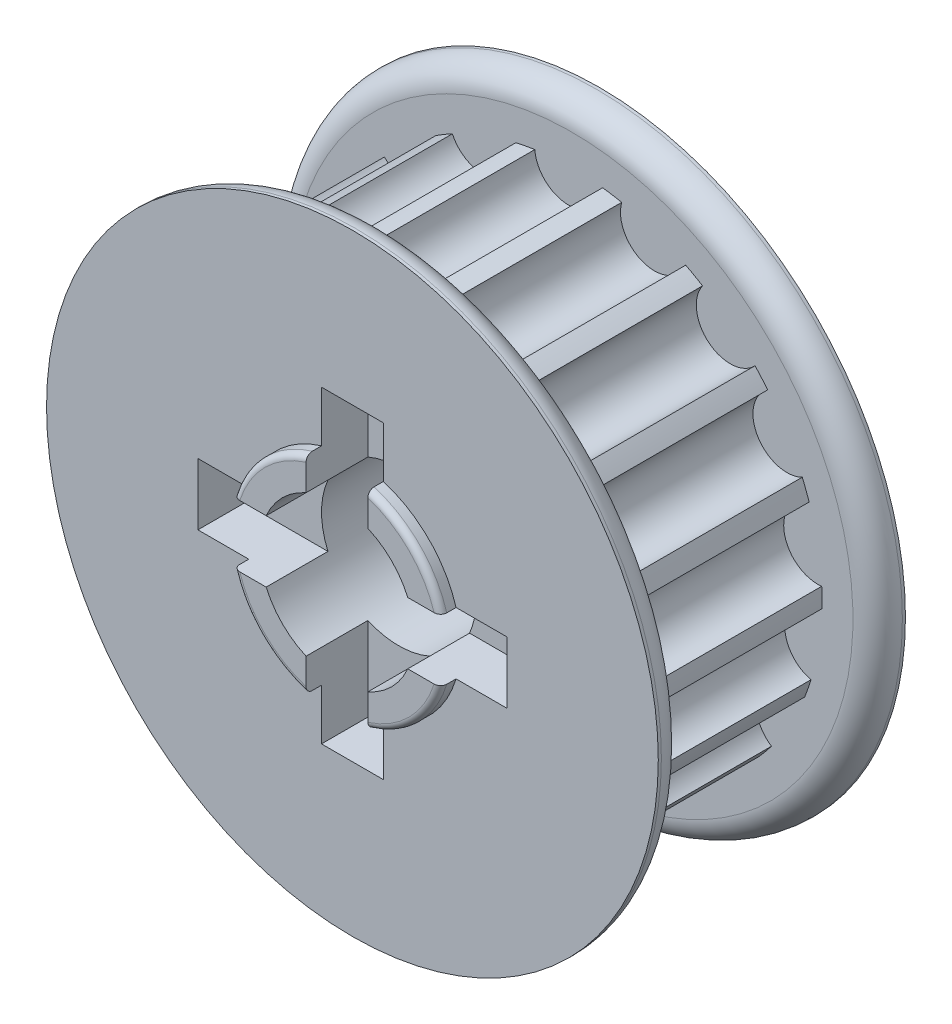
ISO-10303-21;
HEADER;
FILE_DESCRIPTION(('STEP AP214'),'2;1');
FILE_NAME('part.step','',(''),(''),'','','');
FILE_SCHEMA(('AUTOMOTIVE_DESIGN { 1 0 10303 214 1 1 1 1 }'));
ENDSEC;
DATA;
#1=APPLICATION_CONTEXT('core data for automotive mechanical design processes');
#2=APPLICATION_PROTOCOL_DEFINITION('international standard','automotive_design',2000,#1);
#3=PRODUCT_CONTEXT('',#1,'mechanical');
#4=PRODUCT('Part','Part','',(#3));
#5=PRODUCT_RELATED_PRODUCT_CATEGORY('part','',(#4));
#6=PRODUCT_DEFINITION_FORMATION('','',#4);
#7=PRODUCT_DEFINITION_CONTEXT('part definition',#1,'design');
#8=PRODUCT_DEFINITION('design','',#6,#7);
#9=PRODUCT_DEFINITION_SHAPE('','',#8);
#10=(LENGTH_UNIT() NAMED_UNIT(*) SI_UNIT(.MILLI.,.METRE.));
#11=(NAMED_UNIT(*) PLANE_ANGLE_UNIT() SI_UNIT($,.RADIAN.));
#12=(NAMED_UNIT(*) SI_UNIT($,.STERADIAN.) SOLID_ANGLE_UNIT());
#13=UNCERTAINTY_MEASURE_WITH_UNIT(LENGTH_MEASURE(1.E-05),#10,'distance_accuracy_value','');
#14=(GEOMETRIC_REPRESENTATION_CONTEXT(3) GLOBAL_UNCERTAINTY_ASSIGNED_CONTEXT((#13)) GLOBAL_UNIT_ASSIGNED_CONTEXT((#10,
#11,#12)) REPRESENTATION_CONTEXT('',''));
#15=CARTESIAN_POINT('',(0.,0.,0.));
#16=DIRECTION('',(0.,0.,1.));
#17=DIRECTION('',(1.,0.,0.));
#18=AXIS2_PLACEMENT_3D('',#15,#16,#17);
#19=CARTESIAN_POINT('',(0.,0.,1.4));
#20=DIRECTION('',(0.,0.,-1.));
#21=DIRECTION('',(-1.,0.,0.));
#22=AXIS2_PLACEMENT_3D('',#19,#20,#21);
#23=CYLINDRICAL_SURFACE('',#22,3.5);
#24=CARTESIAN_POINT('',(0.,0.,1.2));
#25=DIRECTION('',(0.,0.,1.));
#26=DIRECTION('',(1.,0.,0.));
#27=AXIS2_PLACEMENT_3D('',#24,#25,#26);
#28=CIRCLE('',#27,3.5);
#29=CARTESIAN_POINT('',(-3.35410196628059,1.,1.19999999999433));
#30=VERTEX_POINT('',#29);
#31=CARTESIAN_POINT('',(-1.,3.35410196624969,1.2));
#32=VERTEX_POINT('',#31);
#33=EDGE_CURVE('E1333',#30,#32,#28,.F.);
#34=ORIENTED_EDGE('',*,*,#33,.T.);
#35=DIRECTION('',(0.,0.,-1.));
#36=VECTOR('',#35,1.);
#37=CARTESIAN_POINT('',(-1.,3.35410196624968,1.4));
#38=LINE('',#37,#36);
#39=CARTESIAN_POINT('',(-1.,3.35410196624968,0.9));
#40=VERTEX_POINT('',#39);
#41=EDGE_CURVE('E845',#32,#40,#38,.T.);
#42=ORIENTED_EDGE('',*,*,#41,.T.);
#43=CARTESIAN_POINT('',(0.,0.,0.9));
#44=DIRECTION('',(0.,0.,1.));
#45=DIRECTION('',(1.,0.,0.));
#46=AXIS2_PLACEMENT_3D('',#43,#44,#45);
#47=CIRCLE('',#46,3.5);
#48=CARTESIAN_POINT('',(-3.35410196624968,1.,0.9));
#49=VERTEX_POINT('',#48);
#50=EDGE_CURVE('E1088',#40,#49,#47,.T.);
#51=ORIENTED_EDGE('',*,*,#50,.T.);
#52=DIRECTION('',(0.,0.,-1.));
#53=VECTOR('',#52,1.);
#54=CARTESIAN_POINT('',(-3.35410196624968,1.,1.4));
#55=LINE('',#54,#53);
#56=EDGE_CURVE('E818',#49,#30,#55,.F.);
#57=ORIENTED_EDGE('',*,*,#56,.T.);
#58=EDGE_LOOP('',(#34,#42,#51,#57));
#59=FACE_BOUND('',#58,.T.);
#60=ADVANCED_FACE('F350',(#59),#23,.T.);
#61=CARTESIAN_POINT('',(3.35410196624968,1.,0.9));
#62=VERTEX_POINT('',#61);
#63=CARTESIAN_POINT('',(1.,3.35410196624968,0.9));
#64=VERTEX_POINT('',#63);
#65=EDGE_CURVE('E1084',#62,#64,#47,.T.);
#66=ORIENTED_EDGE('',*,*,#65,.T.);
#67=DIRECTION('',(0.,0.,-1.));
#68=VECTOR('',#67,1.);
#69=CARTESIAN_POINT('',(1.,3.35410196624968,1.4));
#70=LINE('',#69,#68);
#71=CARTESIAN_POINT('',(1.,3.35410196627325,1.20000000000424));
#72=VERTEX_POINT('',#71);
#73=EDGE_CURVE('E1170',#64,#72,#70,.F.);
#74=ORIENTED_EDGE('',*,*,#73,.T.);
#75=CARTESIAN_POINT('',(3.35410196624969,1.,1.2));
#76=VERTEX_POINT('',#75);
#77=EDGE_CURVE('E1101',#72,#76,#28,.F.);
#78=ORIENTED_EDGE('',*,*,#77,.T.);
#79=DIRECTION('',(0.,0.,-1.));
#80=VECTOR('',#79,1.);
#81=CARTESIAN_POINT('',(3.35410196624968,1.,1.4));
#82=LINE('',#81,#80);
#83=EDGE_CURVE('E1168',#76,#62,#82,.T.);
#84=ORIENTED_EDGE('',*,*,#83,.T.);
#85=EDGE_LOOP('',(#66,#74,#78,#84));
#86=FACE_BOUND('',#85,.T.);
#87=ADVANCED_FACE('F1326',(#86),#23,.T.);
#88=CARTESIAN_POINT('',(1.,-3.35410196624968,0.9));
#89=VERTEX_POINT('',#88);
#90=CARTESIAN_POINT('',(3.35410196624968,-1.,0.9));
#91=VERTEX_POINT('',#90);
#92=EDGE_CURVE('E1082',#89,#91,#47,.T.);
#93=ORIENTED_EDGE('',*,*,#92,.T.);
#94=DIRECTION('',(0.,0.,-1.));
#95=VECTOR('',#94,1.);
#96=CARTESIAN_POINT('',(3.35410196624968,-1.,1.4));
#97=LINE('',#96,#95);
#98=CARTESIAN_POINT('',(3.35410196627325,-1.,1.20000000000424));
#99=VERTEX_POINT('',#98);
#100=EDGE_CURVE('E1195',#91,#99,#97,.F.);
#101=ORIENTED_EDGE('',*,*,#100,.T.);
#102=CARTESIAN_POINT('',(1.,-3.35410196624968,1.2));
#103=VERTEX_POINT('',#102);
#104=EDGE_CURVE('E1103',#99,#103,#28,.F.);
#105=ORIENTED_EDGE('',*,*,#104,.T.);
#106=DIRECTION('',(0.,0.,-1.));
#107=VECTOR('',#106,1.);
#108=CARTESIAN_POINT('',(1.,-3.35410196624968,1.4));
#109=LINE('',#108,#107);
#110=EDGE_CURVE('E1222',#103,#89,#109,.T.);
#111=ORIENTED_EDGE('',*,*,#110,.T.);
#112=EDGE_LOOP('',(#93,#101,#105,#111));
#113=FACE_BOUND('',#112,.T.);
#114=ADVANCED_FACE('F1352',(#113),#23,.T.);
#115=CARTESIAN_POINT('',(0.,0.,1.4));
#116=DIRECTION('',(0.,0.,1.));
#117=DIRECTION('',(1.,0.,0.));
#118=AXIS2_PLACEMENT_3D('',#115,#116,#117);
#119=PLANE('',#118);
#120=DIRECTION('',(0.,-1.,0.));
#121=VECTOR('',#120,1.);
#122=CARTESIAN_POINT('',(-1.,5.,1.4));
#123=LINE('',#122,#121);
#124=CARTESIAN_POINT('',(-1.,3.14483703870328,1.4));
#125=VERTEX_POINT('',#124);
#126=CARTESIAN_POINT('',(-1.,2.29128784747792,1.4));
#127=VERTEX_POINT('',#126);
#128=EDGE_CURVE('E1309',#125,#127,#123,.T.);
#129=ORIENTED_EDGE('',*,*,#128,.F.);
#130=CARTESIAN_POINT('',(0.,0.,1.4));
#131=DIRECTION('',(0.,0.,1.));
#132=DIRECTION('',(1.,0.,0.));
#133=AXIS2_PLACEMENT_3D('',#130,#131,#132);
#134=CIRCLE('',#133,3.3);
#135=CARTESIAN_POINT('',(-3.14483703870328,1.,1.4));
#136=VERTEX_POINT('',#135);
#137=EDGE_CURVE('E1102',#125,#136,#134,.T.);
#138=ORIENTED_EDGE('',*,*,#137,.T.);
#139=DIRECTION('',(-1.,0.,0.));
#140=VECTOR('',#139,1.);
#141=CARTESIAN_POINT('',(-5.,1.,1.4));
#142=LINE('',#141,#140);
#143=CARTESIAN_POINT('',(-2.29128784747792,1.,1.4));
#144=VERTEX_POINT('',#143);
#145=EDGE_CURVE('E1344',#144,#136,#142,.T.);
#146=ORIENTED_EDGE('',*,*,#145,.F.);
#147=CARTESIAN_POINT('',(0.,0.,1.4));
#148=DIRECTION('',(0.,0.,1.));
#149=DIRECTION('',(1.,0.,0.));
#150=AXIS2_PLACEMENT_3D('',#147,#148,#149);
#151=CIRCLE('',#150,2.5);
#152=EDGE_CURVE('E857',#127,#144,#151,.T.);
#153=ORIENTED_EDGE('',*,*,#152,.F.);
#154=EDGE_LOOP('',(#129,#138,#146,#153));
#155=FACE_BOUND('',#154,.T.);
#156=ADVANCED_FACE('F1350',(#155),#119,.T.);
#157=DIRECTION('',(0.,1.,0.));
#158=VECTOR('',#157,1.);
#159=CARTESIAN_POINT('',(1.,5.,1.4));
#160=LINE('',#159,#158);
#161=CARTESIAN_POINT('',(1.,2.29128784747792,1.4));
#162=VERTEX_POINT('',#161);
#163=CARTESIAN_POINT('',(1.,3.14483703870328,1.4));
#164=VERTEX_POINT('',#163);
#165=EDGE_CURVE('E1296',#162,#164,#160,.T.);
#166=ORIENTED_EDGE('',*,*,#165,.F.);
#167=CARTESIAN_POINT('',(2.29128784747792,1.,1.4));
#168=VERTEX_POINT('',#167);
#169=EDGE_CURVE('E853',#168,#162,#151,.T.);
#170=ORIENTED_EDGE('',*,*,#169,.F.);
#171=DIRECTION('',(-1.,0.,0.));
#172=VECTOR('',#171,1.);
#173=CARTESIAN_POINT('',(1.,1.,1.4));
#174=LINE('',#173,#172);
#175=CARTESIAN_POINT('',(3.14483703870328,1.,1.4));
#176=VERTEX_POINT('',#175);
#177=EDGE_CURVE('E1294',#176,#168,#174,.T.);
#178=ORIENTED_EDGE('',*,*,#177,.F.);
#179=EDGE_CURVE('E1098',#176,#164,#134,.T.);
#180=ORIENTED_EDGE('',*,*,#179,.T.);
#181=EDGE_LOOP('',(#166,#170,#178,#180));
#182=FACE_BOUND('',#181,.T.);
#183=ADVANCED_FACE('F1316',(#182),#119,.T.);
#184=DIRECTION('',(1.,0.,0.));
#185=VECTOR('',#184,1.);
#186=CARTESIAN_POINT('',(1.,-1.,1.4));
#187=LINE('',#186,#185);
#188=CARTESIAN_POINT('',(2.29128784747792,-1.,1.4));
#189=VERTEX_POINT('',#188);
#190=CARTESIAN_POINT('',(3.14483703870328,-1.,1.4));
#191=VERTEX_POINT('',#190);
#192=EDGE_CURVE('E1292',#189,#191,#187,.T.);
#193=ORIENTED_EDGE('',*,*,#192,.F.);
#194=CARTESIAN_POINT('',(1.,-2.29128784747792,1.4));
#195=VERTEX_POINT('',#194);
#196=EDGE_CURVE('E852',#195,#189,#151,.T.);
#197=ORIENTED_EDGE('',*,*,#196,.F.);
#198=DIRECTION('',(0.,1.,0.));
#199=VECTOR('',#198,1.);
#200=CARTESIAN_POINT('',(1.,-1.,1.4));
#201=LINE('',#200,#199);
#202=CARTESIAN_POINT('',(1.,-3.14483703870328,1.4));
#203=VERTEX_POINT('',#202);
#204=EDGE_CURVE('E1290',#203,#195,#201,.T.);
#205=ORIENTED_EDGE('',*,*,#204,.F.);
#206=EDGE_CURVE('E1097',#203,#191,#134,.T.);
#207=ORIENTED_EDGE('',*,*,#206,.T.);
#208=EDGE_LOOP('',(#193,#197,#205,#207));
#209=FACE_BOUND('',#208,.T.);
#210=ADVANCED_FACE('F1288',(#209),#119,.T.);
#211=CARTESIAN_POINT('',(0.,0.,1.2));
#212=DIRECTION('',(0.,0.,1.));
#213=DIRECTION('',(1.,0.,0.));
#214=AXIS2_PLACEMENT_3D('',#211,#212,#213);
#215=TOROIDAL_SURFACE('',#214,3.3,0.2);
#216=CARTESIAN_POINT('',(-0.999999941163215,2.94190620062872,1.25325070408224));
#217=CARTESIAN_POINT('',(-0.999999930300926,2.9389154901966,1.24299793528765));
#218=CARTESIAN_POINT('',(-0.999999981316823,2.93678173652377,1.23248821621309));
#219=CARTESIAN_POINT('',(-1.0000000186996,2.93431275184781,1.2112526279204));
#220=CARTESIAN_POINT('',(-1.00000000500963,2.93397910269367,1.20052657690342));
#221=CARTESIAN_POINT('',(-0.999999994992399,2.93512562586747,1.17917574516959));
#222=CARTESIAN_POINT('',(-0.99999999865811,2.93660506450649,1.16855092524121));
#223=CARTESIAN_POINT('',(-1.00000000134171,2.94132044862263,1.1477015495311));
#224=CARTESIAN_POINT('',(-1.00000000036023,2.94455615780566,1.13747694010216));
#225=CARTESIAN_POINT('',(-0.999999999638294,2.95268325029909,1.11766103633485));
#226=CARTESIAN_POINT('',(-0.999999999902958,2.95758138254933,1.10807251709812));
#227=CARTESIAN_POINT('',(-1.00000000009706,2.9688636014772,1.08981490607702));
#228=CARTESIAN_POINT('',(-1.00000000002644,2.97524792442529,1.08114596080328));
#229=CARTESIAN_POINT('',(-0.999999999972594,2.98956105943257,1.06462899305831));
#230=CARTESIAN_POINT('',(-0.999999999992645,2.99753775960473,1.05682251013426));
#231=CARTESIAN_POINT('',(-1.00000000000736,3.01463288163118,1.0425811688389));
#232=CARTESIAN_POINT('',(-1.00000000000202,3.02375156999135,1.03614663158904));
#233=CARTESIAN_POINT('',(-0.999999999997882,3.04336486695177,1.02448976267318));
#234=CARTESIAN_POINT('',(-0.999999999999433,3.05390575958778,1.01934528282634));
#235=CARTESIAN_POINT('',(-1.00000000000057,3.07567724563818,1.01081696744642));
#236=CARTESIAN_POINT('',(-1.00000000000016,3.08690799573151,1.00743353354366));
#237=CARTESIAN_POINT('',(-0.99999999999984,3.11024634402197,1.00239088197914));
#238=CARTESIAN_POINT('',(-0.999999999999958,3.12237095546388,1.00081014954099));
#239=CARTESIAN_POINT('',(-1.00000000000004,3.14671579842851,0.999671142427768));
#240=CARTESIAN_POINT('',(-1.00000000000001,3.15893604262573,1.00011314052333));
#241=CARTESIAN_POINT('',(-0.999999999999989,3.18332648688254,1.00304113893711));
#242=CARTESIAN_POINT('',(-0.999999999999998,3.19549286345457,1.0055592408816));
#243=CARTESIAN_POINT('',(-1.,3.2192190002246,1.01263485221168));
#244=CARTESIAN_POINT('',(-1.,3.23077878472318,1.01719227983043));
#245=CARTESIAN_POINT('',(-1.,3.25275482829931,1.02815930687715));
#246=CARTESIAN_POINT('',(-1.,3.26318640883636,1.03453814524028));
#247=CARTESIAN_POINT('',(-1.,3.28277374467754,1.04902310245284));
#248=CARTESIAN_POINT('',(-1.,3.29192977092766,1.05712885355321));
#249=CARTESIAN_POINT('',(-1.,3.30831877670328,1.07450477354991));
#250=CARTESIAN_POINT('',(-1.,3.31561263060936,1.08371749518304));
#251=CARTESIAN_POINT('',(-1.,3.32846618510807,1.10328272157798));
#252=CARTESIAN_POINT('',(-1.,3.33402636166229,1.11363491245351));
#253=CARTESIAN_POINT('',(-1.,3.34300415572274,1.13469853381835));
#254=CARTESIAN_POINT('',(-1.,3.34650443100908,1.14537476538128));
#255=CARTESIAN_POINT('',(-1.,3.35160082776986,1.16717213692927));
#256=CARTESIAN_POINT('',(-1.,3.35319733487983,1.17829318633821));
#257=CARTESIAN_POINT('',(-1.,3.35440906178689,1.20030865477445));
#258=CARTESIAN_POINT('',(-1.,3.35408195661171,1.21119993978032));
#259=CARTESIAN_POINT('',(-1.,3.3515924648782,1.23276992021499));
#260=CARTESIAN_POINT('',(-1.,3.34943019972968,1.24344862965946));
#261=CARTESIAN_POINT('',(-1.,3.34336273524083,1.26423466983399));
#262=CARTESIAN_POINT('',(-1.,3.33946702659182,1.27434477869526));
#263=CARTESIAN_POINT('',(-1.,3.33006554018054,1.29378528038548));
#264=CARTESIAN_POINT('',(-1.,3.32455965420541,1.30311562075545));
#265=CARTESIAN_POINT('',(-1.,3.31198836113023,1.32093734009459));
#266=CARTESIAN_POINT('',(-1.,3.30489416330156,1.32940838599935));
#267=CARTESIAN_POINT('',(-0.999999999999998,3.28943124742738,1.34509263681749));
#268=CARTESIAN_POINT('',(-0.999999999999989,3.28106232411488,1.35230563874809));
#269=CARTESIAN_POINT('',(-1.00000000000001,3.26295405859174,1.36556203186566));
#270=CARTESIAN_POINT('',(-1.00000000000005,3.25317494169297,1.3715510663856));
#271=CARTESIAN_POINT('',(-0.999999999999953,3.23278186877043,1.38187975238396));
#272=CARTESIAN_POINT('',(-0.99999999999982,3.22216773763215,1.38621905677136));
#273=CARTESIAN_POINT('',(-1.00000000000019,3.19992404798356,1.39331445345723));
#274=CARTESIAN_POINT('',(-1.00000000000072,3.18827050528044,1.3959954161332));
#275=CARTESIAN_POINT('',(-0.99999999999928,3.16468236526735,1.39942860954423));
#276=CARTESIAN_POINT('',(-0.999999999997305,3.15274771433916,1.40018046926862));
#277=CARTESIAN_POINT('',(-1.00000000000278,3.12853982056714,1.39973984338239));
#278=CARTESIAN_POINT('',(-1.00000000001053,3.11626765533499,1.39848584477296));
#279=CARTESIAN_POINT('',(-0.999999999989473,3.09210359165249,1.39394765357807));
#280=CARTESIAN_POINT('',(-0.999999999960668,3.08021171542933,1.39066334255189));
#281=CARTESIAN_POINT('',(-1.00000000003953,3.0570930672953,1.38211465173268));
#282=CARTESIAN_POINT('',(-1.00000000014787,3.04586988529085,1.37684053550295));
#283=CARTESIAN_POINT('',(-0.999999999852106,3.02449854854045,1.36443027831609));
#284=CARTESIAN_POINT('',(-0.999999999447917,3.01435055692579,1.35729385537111));
#285=CARTESIAN_POINT('',(-1.00000000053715,2.99573325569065,1.34155265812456));
#286=CARTESIAN_POINT('',(-1.00000000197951,2.98722595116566,1.33299284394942));
#287=CARTESIAN_POINT('',(-0.999999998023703,2.9718712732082,1.31450719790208));
#288=CARTESIAN_POINT('',(-0.999999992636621,2.96502123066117,1.30458360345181));
#289=CARTESIAN_POINT('',(-1.00000000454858,2.95549690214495,1.28767030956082));
#290=CARTESIAN_POINT('',(-1.00000001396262,2.95222734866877,1.28100920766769));
#291=CARTESIAN_POINT('',(-0.999999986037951,2.94646972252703,1.26735687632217));
#292=CARTESIAN_POINT('',(-0.999999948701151,2.94398161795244,1.26036566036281));
#293=CARTESIAN_POINT('',(-0.999999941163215,2.94190620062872,1.25325070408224));
#294=B_SPLINE_CURVE_WITH_KNOTS('',3,(#216,#217,#218,#219,#220,#221,#222,#223,#224,#225,#226,
#227,#228,#229,#230,#231,#232,#233,#234,#235,#236,#237,#238,#239,#240,#241,#242,#243,#244,#245,
#246,#247,#248,#249,#250,#251,#252,#253,#254,#255,#256,#257,#258,#259,#260,#261,#262,#263,#264,
#265,#266,#267,#268,#269,#270,#271,#272,#273,#274,#275,#276,#277,#278,#279,#280,#281,#282,#283,
#284,#285,#286,#287,#288,#289,#290,#291,#292,#293),.UNSPECIFIED.,.T.,.F.,(4,2,2,2,2,2,2,2,2,2,2,
2,2,2,2,2,2,2,2,2,2,2,2,2,2,2,2,2,2,2,2,2,2,2,2,2,2,2,4),(0.,0.032013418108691,
0.0640549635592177,0.096083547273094,0.128107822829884,0.160263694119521,0.192424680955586,
0.225760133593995,0.259103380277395,0.294134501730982,0.329173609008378,0.365686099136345,
0.402203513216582,0.439296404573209,0.476387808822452,0.512886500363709,0.549377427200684,
0.584451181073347,0.61951529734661,0.653054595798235,0.686587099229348,0.719119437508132,
0.751649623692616,0.784003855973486,0.816360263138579,0.849359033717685,0.882363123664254,
0.916611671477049,0.950867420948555,0.986579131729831,1.02229771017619,1.05913281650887,
1.09597007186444,1.13298996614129,1.17001546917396,1.20603904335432,1.24200420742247,
1.26422097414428,1.28643683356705),.UNSPECIFIED.);
#295=EDGE_CURVE('E840',#32,#125,#294,.T.);
#296=ORIENTED_EDGE('',*,*,#295,.F.);
#297=ORIENTED_EDGE('',*,*,#33,.F.);
#298=CARTESIAN_POINT('',(-3.35068527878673,1.,1.23604067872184));
#299=CARTESIAN_POINT('',(-3.3527138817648,1.,1.22542740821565));
#300=CARTESIAN_POINT('',(-3.35384759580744,1.,1.21463542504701));
#301=CARTESIAN_POINT('',(-3.35428014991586,1.,1.19300681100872));
#302=CARTESIAN_POINT('',(-3.35357702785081,1.,1.18217014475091));
#303=CARTESIAN_POINT('',(-3.35035921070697,1.,1.1607770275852));
#304=CARTESIAN_POINT('',(-3.34784585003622,1.,1.15022037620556));
#305=CARTESIAN_POINT('',(-3.34109629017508,1.,1.12967673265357));
#306=CARTESIAN_POINT('',(-3.33686039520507,1.,1.11968964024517));
#307=CARTESIAN_POINT('',(-3.32676652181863,1.,1.10047200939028));
#308=CARTESIAN_POINT('',(-3.32089595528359,1.,1.09124809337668));
#309=CARTESIAN_POINT('',(-3.30773439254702,1.,1.07387745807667));
#310=CARTESIAN_POINT('',(-3.30044318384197,1.,1.06573090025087));
#311=CARTESIAN_POINT('',(-3.28440510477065,1.,1.05046346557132));
#312=CARTESIAN_POINT('',(-3.27561920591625,1.,1.04338361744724));
#313=CARTESIAN_POINT('',(-3.25702429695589,1.,1.03072848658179));
#314=CARTESIAN_POINT('',(-3.24721508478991,1.,1.02515350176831));
#315=CARTESIAN_POINT('',(-3.22640841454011,1.,1.0154169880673));
#316=CARTESIAN_POINT('',(-3.21537820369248,1.,1.01132544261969));
#317=CARTESIAN_POINT('',(-3.19280205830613,1.,1.00497652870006));
#318=CARTESIAN_POINT('',(-3.18125601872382,1.,1.00271953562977));
#319=CARTESIAN_POINT('',(-3.15751138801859,1.,1.00002767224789));
#320=CARTESIAN_POINT('',(-3.14530460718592,1.,0.999664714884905));
#321=CARTESIAN_POINT('',(-3.12099715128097,1.,1.00095568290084));
#322=CARTESIAN_POINT('',(-3.10889649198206,1.,1.00260990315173));
#323=CARTESIAN_POINT('',(-3.08493257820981,1.,1.00794285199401));
#324=CARTESIAN_POINT('',(-3.07307681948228,1.,1.01165540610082));
#325=CARTESIAN_POINT('',(-3.05016932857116,1.,1.02104663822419));
#326=CARTESIAN_POINT('',(-3.0391175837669,1.,1.02672528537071));
#327=CARTESIAN_POINT('',(-3.01832169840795,1.,1.03982121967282));
#328=CARTESIAN_POINT('',(-3.00856071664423,1.,1.04721170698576));
#329=CARTESIAN_POINT('',(-2.99048916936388,1.,1.06359480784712));
#330=CARTESIAN_POINT('',(-2.98217824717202,1.,1.07258702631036));
#331=CARTESIAN_POINT('',(-2.9676424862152,1.,1.09150488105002));
#332=CARTESIAN_POINT('',(-2.96134248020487,1.,1.10137271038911));
#333=CARTESIAN_POINT('',(-2.95059516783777,1.,1.12207065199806));
#334=CARTESIAN_POINT('',(-2.9461472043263,1.,1.13290042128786));
#335=CARTESIAN_POINT('',(-2.93946623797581,1.,1.1546056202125));
#336=CARTESIAN_POINT('',(-2.93712997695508,1.,1.16544931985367));
#337=CARTESIAN_POINT('',(-2.93437931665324,1.,1.18737713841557));
#338=CARTESIAN_POINT('',(-2.93396447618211,1.,1.19846120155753));
#339=CARTESIAN_POINT('',(-2.9350544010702,1.,1.22017177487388));
#340=CARTESIAN_POINT('',(-2.93649728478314,1.,1.23080145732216));
#341=CARTESIAN_POINT('',(-2.94114154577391,1.,1.25166832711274));
#342=CARTESIAN_POINT('',(-2.9443428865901,1.,1.26190552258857));
#343=CARTESIAN_POINT('',(-2.95240306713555,1.,1.28174794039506));
#344=CARTESIAN_POINT('',(-2.95726807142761,1.,1.29135065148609));
#345=CARTESIAN_POINT('',(-2.96848707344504,1.,1.30964146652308));
#346=CARTESIAN_POINT('',(-2.97484128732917,1.,1.31832943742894));
#347=CARTESIAN_POINT('',(-2.9890951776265,1.,1.33488735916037));
#348=CARTESIAN_POINT('',(-2.99704255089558,1.,1.34271620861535));
#349=CARTESIAN_POINT('',(-3.01408296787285,1.,1.35700659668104));
#350=CARTESIAN_POINT('',(-3.02317627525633,1.,1.36346781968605));
#351=CARTESIAN_POINT('',(-3.04274178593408,1.,1.37518302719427));
#352=CARTESIAN_POINT('',(-3.05326047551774,1.,1.38035939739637));
#353=CARTESIAN_POINT('',(-3.0749928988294,1.,1.38895501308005));
#354=CARTESIAN_POINT('',(-3.08620679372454,1.,1.39237384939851));
#355=CARTESIAN_POINT('',(-3.10951876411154,1.,1.39749219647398));
#356=CARTESIAN_POINT('',(-3.12163417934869,1.,1.39911298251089));
#357=CARTESIAN_POINT('',(-3.1459673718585,1.,1.40033374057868));
#358=CARTESIAN_POINT('',(-3.15818516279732,1.,1.3999334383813));
#359=CARTESIAN_POINT('',(-3.18258197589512,1.,1.39708985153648));
#360=CARTESIAN_POINT('',(-3.19475720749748,1.,1.39461378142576));
#361=CARTESIAN_POINT('',(-3.21850789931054,1.,1.38762082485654));
#362=CARTESIAN_POINT('',(-3.23008340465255,1.,1.38310409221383));
#363=CARTESIAN_POINT('',(-3.25209999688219,1.,1.37221436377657));
#364=CARTESIAN_POINT('',(-3.26255611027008,1.,1.36587180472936));
#365=CARTESIAN_POINT('',(-3.28220161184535,1.,1.35145277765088));
#366=CARTESIAN_POINT('',(-3.29139093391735,1.,1.3433762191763));
#367=CARTESIAN_POINT('',(-3.30785504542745,1.,1.32604680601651));
#368=CARTESIAN_POINT('',(-3.31518953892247,1.,1.31685063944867));
#369=CARTESIAN_POINT('',(-3.32811810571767,1.,1.29731843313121));
#370=CARTESIAN_POINT('',(-3.33371492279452,1.,1.28698422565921));
#371=CARTESIAN_POINT('',(-3.341117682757,1.,1.26978941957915));
#372=CARTESIAN_POINT('',(-3.34354495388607,1.,1.26318956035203));
#373=CARTESIAN_POINT('',(-3.34766931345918,1.,1.24976520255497));
#374=CARTESIAN_POINT('',(-3.34936641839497,1.,1.24294070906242));
#375=CARTESIAN_POINT('',(-3.35068527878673,1.,1.23604067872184));
#376=B_SPLINE_CURVE_WITH_KNOTS('',3,(#298,#299,#300,#301,#302,#303,#304,#305,#306,#307,#308,
#309,#310,#311,#312,#313,#314,#315,#316,#317,#318,#319,#320,#321,#322,#323,#324,#325,#326,#327,
#328,#329,#330,#331,#332,#333,#334,#335,#336,#337,#338,#339,#340,#341,#342,#343,#344,#345,#346,
#347,#348,#349,#350,#351,#352,#353,#354,#355,#356,#357,#358,#359,#360,#361,#362,#363,#364,#365,
#366,#367,#368,#369,#370,#371,#372,#373,#374,#375),.UNSPECIFIED.,.T.,.F.,(4,2,2,2,2,2,2,2,2,2,2,
2,2,2,2,2,2,2,2,2,2,2,2,2,2,2,2,2,2,2,2,2,2,2,2,2,2,2,4),(0.,0.0323904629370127,
0.0648155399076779,0.0972167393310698,0.129612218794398,0.162264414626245,0.19492149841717,
0.228620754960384,0.262326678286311,0.297462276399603,0.332605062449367,0.369072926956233,
0.405546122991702,0.442637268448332,0.479727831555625,0.516272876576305,0.552808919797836,
0.587751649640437,0.622681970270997,0.655793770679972,0.688897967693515,0.720927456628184,
0.752956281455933,0.785105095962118,0.817258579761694,0.850578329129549,0.883905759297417,
0.918919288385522,0.953940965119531,0.990441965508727,1.02694791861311,1.06404156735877,
1.10113242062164,1.13763760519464,1.17414469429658,1.20925786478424,1.2443153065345,
1.26537386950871,1.2864319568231),.UNSPECIFIED.);
#377=EDGE_CURVE('E796',#136,#30,#376,.T.);
#378=ORIENTED_EDGE('',*,*,#377,.F.);
#379=ORIENTED_EDGE('',*,*,#137,.F.);
#380=EDGE_LOOP('',(#296,#297,#378,#379));
#381=FACE_BOUND('',#380,.T.);
#382=ADVANCED_FACE('F1331',(#381),#215,.T.);
#383=CARTESIAN_POINT('',(0.999999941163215,2.94190620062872,1.25325070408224));
#384=CARTESIAN_POINT('',(0.999999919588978,2.94502568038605,1.26394092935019));
#385=CARTESIAN_POINT('',(0.999999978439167,2.9490820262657,1.27436830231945));
#386=CARTESIAN_POINT('',(1.00000002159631,2.95891544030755,1.29438924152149));
#387=CARTESIAN_POINT('',(1.00000000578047,2.96469532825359,1.30398140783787));
#388=CARTESIAN_POINT('',(0.999999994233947,2.9777528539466,1.32204728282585));
#389=CARTESIAN_POINT('',(0.999999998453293,2.98502672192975,1.33052372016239));
#390=CARTESIAN_POINT('',(1.00000000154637,3.00084503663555,1.3461851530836));
#391=CARTESIAN_POINT('',(1.00000000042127,3.00938920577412,1.35337043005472));
#392=CARTESIAN_POINT('',(0.999999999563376,3.02783346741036,1.36653882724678));
#393=CARTESIAN_POINT('',(0.999999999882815,3.03777162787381,1.3724685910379));
#394=CARTESIAN_POINT('',(1.00000000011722,3.05846881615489,1.38266228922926));
#395=CARTESIAN_POINT('',(1.00000000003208,3.06922806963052,1.38692576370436));
#396=CARTESIAN_POINT('',(0.99999999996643,3.09179991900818,1.39386147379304));
#397=CARTESIAN_POINT('',(0.999999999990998,3.10363824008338,1.39645014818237));
#398=CARTESIAN_POINT('',(1.00000000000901,3.12757971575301,1.39965506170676));
#399=CARTESIAN_POINT('',(1.00000000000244,3.1396829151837,1.40027096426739));
#400=CARTESIAN_POINT('',(0.999999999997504,3.16411521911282,1.39950255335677));
#401=CARTESIAN_POINT('',(0.999999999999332,3.17644286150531,1.39807038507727));
#402=CARTESIAN_POINT('',(1.00000000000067,3.20067954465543,1.39314088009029));
#403=CARTESIAN_POINT('',(1.00000000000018,3.2125885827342,1.3896435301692));
#404=CARTESIAN_POINT('',(0.999999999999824,3.23553829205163,1.38068964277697));
#405=CARTESIAN_POINT('',(0.999999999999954,3.24658513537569,1.37524896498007));
#406=CARTESIAN_POINT('',(1.00000000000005,3.2675642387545,1.36252694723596));
#407=CARTESIAN_POINT('',(1.00000000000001,3.27749669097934,1.35524592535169));
#408=CARTESIAN_POINT('',(0.999999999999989,3.29559026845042,1.33930949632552));
#409=CARTESIAN_POINT('',(0.999999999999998,3.30380055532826,1.33070995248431));
#410=CARTESIAN_POINT('',(1.,3.31857952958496,1.3121993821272));
#411=CARTESIAN_POINT('',(1.,3.32514866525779,1.30228871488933));
#412=CARTESIAN_POINT('',(1.,3.33615211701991,1.2819099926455));
#413=CARTESIAN_POINT('',(1.,3.3406679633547,1.27148594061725));
#414=CARTESIAN_POINT('',(1.,3.34781344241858,1.2500103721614));
#415=CARTESIAN_POINT('',(1.,3.35044351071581,1.23895900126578));
#416=CARTESIAN_POINT('',(1.,3.35366211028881,1.21695725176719));
#417=CARTESIAN_POINT('',(1.,3.35431856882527,1.20601676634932));
#418=CARTESIAN_POINT('',(1.,3.35376010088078,1.18418433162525));
#419=CARTESIAN_POINT('',(1.,3.35254536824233,1.17329237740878));
#420=CARTESIAN_POINT('',(1.,3.34831454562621,1.15200458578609));
#421=CARTESIAN_POINT('',(1.,3.34532074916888,1.14160429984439));
#422=CARTESIAN_POINT('',(1.,3.33765245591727,1.1214440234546));
#423=CARTESIAN_POINT('',(1.,3.33297790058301,1.11168405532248));
#424=CARTESIAN_POINT('',(1.,3.32202572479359,1.09293093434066));
#425=CARTESIAN_POINT('',(1.,3.31572706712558,1.08395008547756));
#426=CARTESIAN_POINT('',(1.,3.3017575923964,1.06712919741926));
#427=CARTESIAN_POINT('',(1.,3.29408658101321,1.05928932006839));
#428=CARTESIAN_POINT('',(1.,3.27731595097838,1.04468286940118));
#429=CARTESIAN_POINT('',(1.,3.26817652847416,1.03796202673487));
#430=CARTESIAN_POINT('',(1.,3.24893715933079,1.02607638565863));
#431=CARTESIAN_POINT('',(1.,3.23883701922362,1.02091190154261));
#432=CARTESIAN_POINT('',(1.,3.21750235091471,1.01205453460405));
#433=CARTESIAN_POINT('',(1.00000000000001,3.20623779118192,1.00843396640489));
#434=CARTESIAN_POINT('',(0.999999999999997,3.18327137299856,1.00306224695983));
#435=CARTESIAN_POINT('',(0.999999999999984,3.17156942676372,1.00131147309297));
#436=CARTESIAN_POINT('',(1.00000000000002,3.14761412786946,0.99967853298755));
#437=CARTESIAN_POINT('',(1.00000000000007,3.13535602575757,0.999865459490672));
#438=CARTESIAN_POINT('',(0.999999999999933,3.11103856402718,1.00226525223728));
#439=CARTESIAN_POINT('',(0.999999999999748,3.09897923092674,1.00447838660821));
#440=CARTESIAN_POINT('',(1.00000000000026,3.07524174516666,1.01092396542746));
#441=CARTESIAN_POINT('',(1.00000000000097,3.06357061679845,1.01518237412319));
#442=CARTESIAN_POINT('',(0.999999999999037,3.04112785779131,1.025635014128));
#443=CARTESIAN_POINT('',(0.999999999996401,3.03035618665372,1.03182915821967));
#444=CARTESIAN_POINT('',(1.00000000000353,3.01025603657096,1.0458716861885));
#445=CARTESIAN_POINT('',(1.00000000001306,3.00090381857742,1.05368602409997));
#446=CARTESIAN_POINT('',(0.999999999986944,2.98372364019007,1.07084230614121));
#447=CARTESIAN_POINT('',(0.999999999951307,2.97589520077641,1.08018376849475));
#448=CARTESIAN_POINT('',(1.00000000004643,2.96238264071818,1.09966862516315));
#449=CARTESIAN_POINT('',(1.00000000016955,2.956615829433,1.10975464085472));
#450=CARTESIAN_POINT('',(0.999999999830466,2.94696154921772,1.13079311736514));
#451=CARTESIAN_POINT('',(0.999999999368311,2.94307394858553,1.14174551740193));
#452=CARTESIAN_POINT('',(1.00000000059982,2.93748588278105,1.1636040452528));
#453=CARTESIAN_POINT('',(1.00000000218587,2.93568495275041,1.17448462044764));
#454=CARTESIAN_POINT('',(0.999999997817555,2.9339976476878,1.19638250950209));
#455=CARTESIAN_POINT('',(0.999999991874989,2.93410827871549,1.20739958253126));
#456=CARTESIAN_POINT('',(1.00000000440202,2.93574190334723,1.22422697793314));
#457=CARTESIAN_POINT('',(1.00000001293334,2.93659450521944,1.23010996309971));
#458=CARTESIAN_POINT('',(0.999999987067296,2.93884462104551,1.2417704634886));
#459=CARTESIAN_POINT('',(0.999999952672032,2.94024210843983,1.24754798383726));
#460=CARTESIAN_POINT('',(0.999999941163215,2.94190620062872,1.25325070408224));
#461=B_SPLINE_CURVE_WITH_KNOTS('',3,(#383,#384,#385,#386,#387,#388,#389,#390,#391,#392,#393,
#394,#395,#396,#397,#398,#399,#400,#401,#402,#403,#404,#405,#406,#407,#408,#409,#410,#411,#412,
#413,#414,#415,#416,#417,#418,#419,#420,#421,#422,#423,#424,#425,#426,#427,#428,#429,#430,#431,
#432,#433,#434,#435,#436,#437,#438,#439,#440,#441,#442,#443,#444,#445,#446,#447,#448,#449,#450,
#451,#452,#453,#454,#455,#456,#457,#458,#459,#460),.UNSPECIFIED.,.T.,.F.,(4,2,2,2,2,2,2,2,2,2,2,
2,2,2,2,2,2,2,2,2,2,2,2,2,2,2,2,2,2,2,2,2,2,2,2,2,2,2,4),(0.,0.0333852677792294,
0.06682545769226,0.100182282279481,0.133531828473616,0.168096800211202,0.202671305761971,
0.238859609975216,0.275054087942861,0.312108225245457,0.349162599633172,0.385921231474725,
0.422673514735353,0.458162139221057,0.493641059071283,0.527551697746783,0.561454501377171,
0.594176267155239,0.626894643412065,0.659211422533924,0.691529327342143,0.724288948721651,
0.757053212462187,0.790935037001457,0.824823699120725,0.860160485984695,0.895504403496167,
0.932112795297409,0.968726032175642,1.00581686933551,1.04290603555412,1.0792830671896,
1.11564864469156,1.1503256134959,1.18500015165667,1.21792499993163,1.25079828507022,
1.26860858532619,1.28641801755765),.UNSPECIFIED.);
#462=EDGE_CURVE('E1167',#164,#72,#461,.T.);
#463=ORIENTED_EDGE('',*,*,#462,.F.);
#464=ORIENTED_EDGE('',*,*,#179,.F.);
#465=CARTESIAN_POINT('',(2.94190624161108,1.,1.2532506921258));
#466=CARTESIAN_POINT('',(2.93891553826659,1.,1.2429979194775));
#467=CARTESIAN_POINT('',(2.93678174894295,1.,1.23248820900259));
#468=CARTESIAN_POINT('',(2.93431273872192,1.,1.21125262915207));
#469=CARTESIAN_POINT('',(2.93397909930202,1.,1.20052657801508));
#470=CARTESIAN_POINT('',(2.93512562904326,1.,1.1791757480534));
#471=CARTESIAN_POINT('',(2.93660506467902,1.,1.16855093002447));
#472=CARTESIAN_POINT('',(2.94132044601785,1.,1.14770155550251));
#473=CARTESIAN_POINT('',(2.94455615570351,1.,1.13747694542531));
#474=CARTESIAN_POINT('',(2.95268324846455,1.,1.11766104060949));
#475=CARTESIAN_POINT('',(2.95758138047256,1.,1.10807252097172));
#476=CARTESIAN_POINT('',(2.96886359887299,1.,1.0898149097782));
#477=CARTESIAN_POINT('',(2.97524792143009,1.,1.08114596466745));
#478=CARTESIAN_POINT('',(2.98956105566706,1.,1.06462899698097));
#479=CARTESIAN_POINT('',(2.99753775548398,1.,1.05682251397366));
#480=CARTESIAN_POINT('',(3.01463287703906,1.,1.04258117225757));
#481=CARTESIAN_POINT('',(3.02375156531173,1.,1.03614663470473));
#482=CARTESIAN_POINT('',(3.04336486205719,1.,1.02448976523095));
#483=CARTESIAN_POINT('',(3.05390575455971,1.,1.01934528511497));
#484=CARTESIAN_POINT('',(3.07567724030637,1.,1.01081696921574));
#485=CARTESIAN_POINT('',(3.08690799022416,1.,1.0074335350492));
#486=CARTESIAN_POINT('',(3.11024633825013,1.,1.0023908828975));
#487=CARTESIAN_POINT('',(3.12237094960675,1.,1.00081015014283));
#488=CARTESIAN_POINT('',(3.14671579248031,1.,0.999671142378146));
#489=CARTESIAN_POINT('',(3.15893603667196,1.,1.00011314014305));
#490=CARTESIAN_POINT('',(3.18332648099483,1.,1.00304113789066));
#491=CARTESIAN_POINT('',(3.19549285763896,1.,1.00555923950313));
#492=CARTESIAN_POINT('',(3.21921899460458,1.,1.01263485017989));
#493=CARTESIAN_POINT('',(3.23077877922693,1.,1.01719227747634));
#494=CARTESIAN_POINT('',(3.25275482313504,1.,1.02815930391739));
#495=CARTESIAN_POINT('',(3.26318640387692,1.,1.03453814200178));
#496=CARTESIAN_POINT('',(3.28277374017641,1.,1.0490230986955));
#497=CARTESIAN_POINT('',(3.29192976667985,1.,1.05712884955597));
#498=CARTESIAN_POINT('',(3.30831877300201,1.,1.07450476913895));
#499=CARTESIAN_POINT('',(3.31561262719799,1.,1.08371749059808));
#500=CARTESIAN_POINT('',(3.32846618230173,1.,1.10328271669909));
#501=CARTESIAN_POINT('',(3.33402635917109,1.,1.11363490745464));
#502=CARTESIAN_POINT('',(3.34300415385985,1.,1.13469852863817));
#503=CARTESIAN_POINT('',(3.34650442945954,1.,1.14537476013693));
#504=CARTESIAN_POINT('',(3.35160082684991,1.,1.16717213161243));
#505=CARTESIAN_POINT('',(3.35319733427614,1.,1.17829318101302));
#506=CARTESIAN_POINT('',(3.35440906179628,1.,1.20030864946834));
#507=CARTESIAN_POINT('',(3.3540819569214,1.,1.21119993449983));
#508=CARTESIAN_POINT('',(3.35159246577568,1.,1.23276991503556));
#509=CARTESIAN_POINT('',(3.34943020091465,1.,1.24344862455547));
#510=CARTESIAN_POINT('',(3.34336273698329,1.,1.26423466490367));
#511=CARTESIAN_POINT('',(3.33946702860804,1.,1.27434477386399));
#512=CARTESIAN_POINT('',(3.33006554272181,1.,1.2937852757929));
#513=CARTESIAN_POINT('',(3.32455965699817,1.,1.30311561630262));
#514=CARTESIAN_POINT('',(3.3119883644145,1.,1.32093733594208));
#515=CARTESIAN_POINT('',(3.3048941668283,1.,1.32940838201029));
#516=CARTESIAN_POINT('',(3.28943125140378,1.,1.34509263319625));
#517=CARTESIAN_POINT('',(3.28106232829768,1.,1.35230563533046));
#518=CARTESIAN_POINT('',(3.26295406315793,1.,1.36556202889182));
#519=CARTESIAN_POINT('',(3.2531749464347,1.,1.37155106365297));
#520=CARTESIAN_POINT('',(3.23278187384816,1.,1.38187975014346));
#521=CARTESIAN_POINT('',(3.22216774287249,1.,1.38621905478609));
#522=CARTESIAN_POINT('',(3.19992405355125,1.,1.39331445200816));
#523=CARTESIAN_POINT('',(3.18827051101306,1.,1.39599541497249));
#524=CARTESIAN_POINT('',(3.16468237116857,1.,1.39942860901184));
#525=CARTESIAN_POINT('',(3.15274772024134,1.,1.40018046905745));
#526=CARTESIAN_POINT('',(3.12853982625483,1.,1.39973984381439));
#527=CARTESIAN_POINT('',(3.11626766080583,1.,1.3984858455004));
#528=CARTESIAN_POINT('',(3.09210359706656,1.,1.39394765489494));
#529=CARTESIAN_POINT('',(3.08021172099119,1.,1.39066334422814));
#530=CARTESIAN_POINT('',(3.05709307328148,1.,1.38211465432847));
#531=CARTESIAN_POINT('',(3.0458698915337,1.,1.37684053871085));
#532=CARTESIAN_POINT('',(3.0244985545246,1.,1.36443028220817));
#533=CARTESIAN_POINT('',(3.01435056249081,1.,1.3572938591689));
#534=CARTESIAN_POINT('',(2.99573325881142,1.,1.34155266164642));
#535=CARTESIAN_POINT('',(2.98722595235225,1.,1.33299284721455));
#536=CARTESIAN_POINT('',(2.97187127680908,1.,1.31450720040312));
#537=CARTESIAN_POINT('',(2.96502123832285,1.,1.30458360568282));
#538=CARTESIAN_POINT('',(2.95549690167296,1.,1.28767031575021));
#539=CARTESIAN_POINT('',(2.95222734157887,1.,1.28100921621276));
#540=CARTESIAN_POINT('',(2.94646973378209,1.,1.2673568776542));
#541=CARTESIAN_POINT('',(2.94398165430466,1.,1.26036565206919));
#542=CARTESIAN_POINT('',(2.94190624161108,1.,1.2532506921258));
#543=B_SPLINE_CURVE_WITH_KNOTS('',3,(#465,#466,#467,#468,#469,#470,#471,#472,#473,#474,#475,
#476,#477,#478,#479,#480,#481,#482,#483,#484,#485,#486,#487,#488,#489,#490,#491,#492,#493,#494,
#495,#496,#497,#498,#499,#500,#501,#502,#503,#504,#505,#506,#507,#508,#509,#510,#511,#512,#513,
#514,#515,#516,#517,#518,#519,#520,#521,#522,#523,#524,#525,#526,#527,#528,#529,#530,#531,#532,
#533,#534,#535,#536,#537,#538,#539,#540,#541,#542),.UNSPECIFIED.,.T.,.F.,(4,2,2,2,2,2,2,2,2,2,2,
2,2,2,2,2,2,2,2,2,2,2,2,2,2,2,2,2,2,2,2,2,2,2,2,2,2,2,4),(0.,0.0320134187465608,
0.064054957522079,0.0960835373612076,0.128107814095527,0.160263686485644,0.192424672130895,
0.225760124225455,0.259103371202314,0.294134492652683,0.329173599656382,0.365686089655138,
0.402203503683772,0.439296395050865,0.476387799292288,0.512886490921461,0.549377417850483,
0.584451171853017,0.619515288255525,0.653054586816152,0.686587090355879,0.719119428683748,
0.751649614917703,0.784003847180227,0.816360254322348,0.849359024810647,0.882363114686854,
0.916611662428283,0.950867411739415,0.986579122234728,1.02229770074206,1.05913280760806,
1.09597006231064,1.13298995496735,1.17001545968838,1.206039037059,1.24200419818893,
1.26422096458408,1.28643682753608),.UNSPECIFIED.);
#544=EDGE_CURVE('E1172',#76,#176,#543,.T.);
#545=ORIENTED_EDGE('',*,*,#544,.F.);
#546=ORIENTED_EDGE('',*,*,#77,.F.);
#547=EDGE_LOOP('',(#463,#464,#545,#546));
#548=FACE_BOUND('',#547,.T.);
#549=ADVANCED_FACE('F1321',(#548),#215,.T.);
#550=CARTESIAN_POINT('',(2.94190624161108,-1.,1.2532506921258));
#551=CARTESIAN_POINT('',(2.9450257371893,-1.,1.26394091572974));
#552=CARTESIAN_POINT('',(2.94908204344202,-1.,1.27436830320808));
#553=CARTESIAN_POINT('',(2.95891542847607,-1.,1.29438925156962));
#554=CARTESIAN_POINT('',(2.96469532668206,-1.,1.30398141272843));
#555=CARTESIAN_POINT('',(2.97775285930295,-1.,1.32204728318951));
#556=CARTESIAN_POINT('',(2.98502672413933,-1.,1.33052372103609));
#557=CARTESIAN_POINT('',(3.00084503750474,-1.,1.3461851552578));
#558=CARTESIAN_POINT('',(3.00938920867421,-1.,1.35337043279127));
#559=CARTESIAN_POINT('',(3.02783347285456,-1.,1.36653883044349));
#560=CARTESIAN_POINT('',(3.03777163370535,-1.,1.37246859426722));
#561=CARTESIAN_POINT('',(3.05846882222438,-1.,1.3826622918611));
#562=CARTESIAN_POINT('',(3.06922807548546,-1.,1.38692576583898));
#563=CARTESIAN_POINT('',(3.09179992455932,-1.,1.39386147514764));
#564=CARTESIAN_POINT('',(3.10363824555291,-1.,1.39645014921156));
#565=CARTESIAN_POINT('',(3.12757972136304,-1.,1.3996550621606));
#566=CARTESIAN_POINT('',(3.13968292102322,-1.,1.40027096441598));
#567=CARTESIAN_POINT('',(3.16411522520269,-1.,1.39950255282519));
#568=CARTESIAN_POINT('',(3.17644286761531,-1.,1.39807038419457));
#569=CARTESIAN_POINT('',(3.20067955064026,-1.,1.39314087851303));
#570=CARTESIAN_POINT('',(3.2125885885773,-1.,1.38964352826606));
#571=CARTESIAN_POINT('',(3.23553829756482,-1.,1.38068964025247));
#572=CARTESIAN_POINT('',(3.24658514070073,-1.,1.37524896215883));
#573=CARTESIAN_POINT('',(3.26756424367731,-1.,1.36252694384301));
#574=CARTESIAN_POINT('',(3.2774966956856,-1.,1.35524592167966));
#575=CARTESIAN_POINT('',(3.29559027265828,-1.,1.33930949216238));
#576=CARTESIAN_POINT('',(3.30380055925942,-1.,1.33070994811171));
#577=CARTESIAN_POINT('',(3.3185795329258,-1.,1.31219937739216));
#578=CARTESIAN_POINT('',(3.32514866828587,-1.,1.30228871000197));
#579=CARTESIAN_POINT('',(3.33615211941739,-1.,1.28190998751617));
#580=CARTESIAN_POINT('',(3.34066796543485,-1.,1.27148593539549));
#581=CARTESIAN_POINT('',(3.34781344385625,-1.,1.25001036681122));
#582=CARTESIAN_POINT('',(3.35044351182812,-1.,1.23895899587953));
#583=CARTESIAN_POINT('',(3.35366211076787,-1.,1.21695724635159));
#584=CARTESIAN_POINT('',(3.35431856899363,-1.,1.20601676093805));
#585=CARTESIAN_POINT('',(3.35376010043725,-1.,1.18418432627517));
#586=CARTESIAN_POINT('',(3.35254536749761,-1.,1.17329237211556));
#587=CARTESIAN_POINT('',(3.34831454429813,-1.,1.15200458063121));
#588=CARTESIAN_POINT('',(3.34532074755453,-1.,1.14160429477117));
#589=CARTESIAN_POINT('',(3.33765245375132,-1.,1.12144401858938));
#590=CARTESIAN_POINT('',(3.33297789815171,-1.,1.11168405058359));
#591=CARTESIAN_POINT('',(3.32202572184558,-1.,1.09293092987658));
#592=CARTESIAN_POINT('',(3.3157270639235,-1.,1.08395008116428));
#593=CARTESIAN_POINT('',(3.3017575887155,-1.,1.06712919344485));
#594=CARTESIAN_POINT('',(3.29408657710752,-1.,1.05928931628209));
#595=CARTESIAN_POINT('',(3.27731594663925,-1.,1.04468286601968));
#596=CARTESIAN_POINT('',(3.268176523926,-1.,1.03796202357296));
#597=CARTESIAN_POINT('',(3.24893715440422,-1.,1.02607638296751));
#598=CARTESIAN_POINT('',(3.23883701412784,-1.,1.02091189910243));
#599=CARTESIAN_POINT('',(3.21750234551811,-1.,1.01205453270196));
#600=CARTESIAN_POINT('',(3.20623778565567,-1.,1.00843396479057));
#601=CARTESIAN_POINT('',(3.18327136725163,-1.,1.00306224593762));
#602=CARTESIAN_POINT('',(3.17156942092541,-1.,1.00131147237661));
#603=CARTESIAN_POINT('',(3.14761412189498,-1.,0.999678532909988));
#604=CARTESIAN_POINT('',(3.13535601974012,-1.,0.999865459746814));
#605=CARTESIAN_POINT('',(3.11103855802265,-1.,1.00226525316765));
#606=CARTESIAN_POINT('',(3.09897922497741,-1.,1.00447838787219));
#607=CARTESIAN_POINT('',(3.07524173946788,-1.,1.01092396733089));
#608=CARTESIAN_POINT('',(3.06357061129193,-1.,1.01518237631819));
#609=CARTESIAN_POINT('',(3.04112785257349,-1.,1.02563501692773));
#610=CARTESIAN_POINT('',(3.03035618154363,-1.,1.03182916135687));
#611=CARTESIAN_POINT('',(3.01025603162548,-1.,1.04587169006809));
#612=CARTESIAN_POINT('',(3.00090381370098,-1.,1.05368602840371));
#613=CARTESIAN_POINT('',(2.98372363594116,-1.,1.07084231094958));
#614=CARTESIAN_POINT('',(2.97589519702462,-1.,1.08018377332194));
#615=CARTESIAN_POINT('',(2.96238263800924,-1.,1.09966862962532));
#616=CARTESIAN_POINT('',(2.95661582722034,-1.,1.10975464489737));
#617=CARTESIAN_POINT('',(2.94696154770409,-1.,1.13079312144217));
#618=CARTESIAN_POINT('',(2.94307394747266,-1.,1.14174552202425));
#619=CARTESIAN_POINT('',(2.93748588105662,-1.,1.16360405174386));
#620=CARTESIAN_POINT('',(2.93568495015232,-1.,1.17448462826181));
#621=CARTESIAN_POINT('',(2.93399764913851,-1.,1.19638251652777));
#622=CARTESIAN_POINT('',(2.93410828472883,-1.,1.20739958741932));
#623=CARTESIAN_POINT('',(2.93574190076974,-1.,1.2242269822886));
#624=CARTESIAN_POINT('',(2.93659449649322,-1.,1.23010996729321));
#625=CARTESIAN_POINT('',(2.9388446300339,-1.,1.2417704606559));
#626=CARTESIAN_POINT('',(2.94024214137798,-1.,1.24754797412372));
#627=CARTESIAN_POINT('',(2.94190624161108,-1.,1.2532506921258));
#628=B_SPLINE_CURVE_WITH_KNOTS('',3,(#550,#551,#552,#553,#554,#555,#556,#557,#558,#559,#560,
#561,#562,#563,#564,#565,#566,#567,#568,#569,#570,#571,#572,#573,#574,#575,#576,#577,#578,#579,
#580,#581,#582,#583,#584,#585,#586,#587,#588,#589,#590,#591,#592,#593,#594,#595,#596,#597,#598,
#599,#600,#601,#602,#603,#604,#605,#606,#607,#608,#609,#610,#611,#612,#613,#614,#615,#616,#617,
#618,#619,#620,#621,#622,#623,#624,#625,#626,#627),.UNSPECIFIED.,.T.,.F.,(4,2,2,2,2,2,2,2,2,2,2,
2,2,2,2,2,2,2,2,2,2,2,2,2,2,2,2,2,2,2,2,2,2,2,2,2,2,2,4),(0.,0.0333852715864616,
0.0668254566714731,0.100182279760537,0.133531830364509,0.168096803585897,0.202671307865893,
0.238859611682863,0.275054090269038,0.312108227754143,0.349162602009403,0.385921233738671,
0.422673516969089,0.458162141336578,0.493641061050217,0.527551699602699,0.561454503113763,
0.594176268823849,0.626894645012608,0.659211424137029,0.691529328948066,0.724288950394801,
0.757053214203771,0.790935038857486,0.824823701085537,0.86016048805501,0.895504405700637,
0.932112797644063,0.968726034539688,1.00581687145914,1.04290603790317,1.07928307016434,
1.1156486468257,1.15032561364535,1.18500015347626,1.2179250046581,1.250798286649,
1.26860858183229,1.28641801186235),.UNSPECIFIED.);
#629=EDGE_CURVE('E1198',#191,#99,#628,.T.);
#630=ORIENTED_EDGE('',*,*,#629,.F.);
#631=ORIENTED_EDGE('',*,*,#206,.F.);
#632=CARTESIAN_POINT('',(1.00000000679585,-3.35068528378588,1.23604067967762));
#633=CARTESIAN_POINT('',(1.00000000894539,-3.34861266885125,1.24687825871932));
#634=CARTESIAN_POINT('',(1.00000000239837,-3.34560353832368,1.25754617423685));
#635=CARTESIAN_POINT('',(0.999999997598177,-3.33781616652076,1.27822590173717));
#636=CARTESIAN_POINT('',(0.999999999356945,-3.3330353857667,1.28823674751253));
#637=CARTESIAN_POINT('',(1.00000000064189,-3.3218788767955,1.30730101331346));
#638=CARTESIAN_POINT('',(1.00000000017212,-3.31550606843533,1.31635614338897));
#639=CARTESIAN_POINT('',(0.999999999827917,-3.30136804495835,1.33329795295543));
#640=CARTESIAN_POINT('',(0.999999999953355,-3.29360312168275,1.34118487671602));
#641=CARTESIAN_POINT('',(1.00000000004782,-3.27670093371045,1.35579441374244));
#642=CARTESIAN_POINT('',(1.00000000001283,-3.2675340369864,1.36248270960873));
#643=CARTESIAN_POINT('',(0.999999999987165,-3.24824511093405,1.3742998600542));
#644=CARTESIAN_POINT('',(0.999999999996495,-3.23812286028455,1.37942835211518));
#645=CARTESIAN_POINT('',(1.00000000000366,-3.21674722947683,1.38821008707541));
#646=CARTESIAN_POINT('',(1.00000000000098,-3.2054639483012,1.39179056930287));
#647=CARTESIAN_POINT('',(0.99999999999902,-3.18246671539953,1.39707929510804));
#648=CARTESIAN_POINT('',(0.999999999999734,-3.1707526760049,1.39878715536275));
#649=CARTESIAN_POINT('',(1.00000000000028,-3.14678201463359,1.40033054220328));
#650=CARTESIAN_POINT('',(1.00000000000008,-3.13452092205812,1.40009725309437));
#651=CARTESIAN_POINT('',(0.999999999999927,-3.11020538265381,1.39760417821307));
#652=CARTESIAN_POINT('',(0.999999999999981,-3.09815096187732,1.39534413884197));
#653=CARTESIAN_POINT('',(1.00000000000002,-3.07443546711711,1.38880564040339));
#654=CARTESIAN_POINT('',(1.00000000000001,-3.06278134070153,1.38450189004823));
#655=CARTESIAN_POINT('',(0.999999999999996,-3.04038051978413,1.37396138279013));
#656=CARTESIAN_POINT('',(1.,-3.02963378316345,1.36772471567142));
#657=CARTESIAN_POINT('',(1.,-3.00959479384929,1.3536048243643));
#658=CARTESIAN_POINT('',(1.,-3.00027816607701,1.34575626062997));
#659=CARTESIAN_POINT('',(1.,-2.98317466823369,1.32853772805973));
#660=CARTESIAN_POINT('',(1.,-2.97538737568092,1.3191681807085));
#661=CARTESIAN_POINT('',(1.,-2.96196063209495,1.2996367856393));
#662=CARTESIAN_POINT('',(1.,-2.95623810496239,1.28953208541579));
#663=CARTESIAN_POINT('',(1.,-2.94667631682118,1.268467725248));
#664=CARTESIAN_POINT('',(1.,-2.94283639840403,1.2575083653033));
#665=CARTESIAN_POINT('',(1.,-2.93734229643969,1.23564803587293));
#666=CARTESIAN_POINT('',(1.,-2.9355868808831,1.22477244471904));
#667=CARTESIAN_POINT('',(1.,-2.93398459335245,1.20288231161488));
#668=CARTESIAN_POINT('',(1.,-2.93413734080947,1.19186779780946));
#669=CARTESIAN_POINT('',(1.,-2.93631366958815,1.17033512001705));
#670=CARTESIAN_POINT('',(1.,-2.93828536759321,1.1598116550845));
#671=CARTESIAN_POINT('',(1.,-2.94395212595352,1.13924062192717));
#672=CARTESIAN_POINT('',(1.,-2.94764720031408,1.1291930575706));
#673=CARTESIAN_POINT('',(1.,-2.95667136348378,1.10974923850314));
#674=CARTESIAN_POINT('',(1.,-2.96201526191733,1.10035987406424));
#675=CARTESIAN_POINT('',(1.,-2.97414623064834,1.08256636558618));
#676=CARTESIAN_POINT('',(1.,-2.98093353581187,1.07416238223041));
#677=CARTESIAN_POINT('',(1.,-2.99603935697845,1.05821612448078));
#678=CARTESIAN_POINT('',(1.,-3.00440802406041,1.05072139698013));
#679=CARTESIAN_POINT('',(1.,-3.02223220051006,1.03716164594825));
#680=CARTESIAN_POINT('',(1.,-3.03168796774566,1.03109696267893));
#681=CARTESIAN_POINT('',(1.,-3.05193138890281,1.02024838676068));
#682=CARTESIAN_POINT('',(1.,-3.06276228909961,1.01554514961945));
#683=CARTESIAN_POINT('',(1.,-3.08504055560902,1.00794530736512));
#684=CARTESIAN_POINT('',(1.,-3.09648805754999,1.00504910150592));
#685=CARTESIAN_POINT('',(0.999999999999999,-3.12015571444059,1.00104515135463));
#686=CARTESIAN_POINT('',(0.999999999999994,-3.13238855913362,1.00001208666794));
#687=CARTESIAN_POINT('',(1.00000000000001,-3.15685737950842,0.999988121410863));
#688=CARTESIAN_POINT('',(1.00000000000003,-3.16909335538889,1.00099745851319));
#689=CARTESIAN_POINT('',(0.999999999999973,-3.19336404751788,1.00506854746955));
#690=CARTESIAN_POINT('',(0.999999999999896,-3.20539489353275,1.00815350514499));
#691=CARTESIAN_POINT('',(1.00000000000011,-3.22875144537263,1.01633987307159));
#692=CARTESIAN_POINT('',(1.00000000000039,-3.24007719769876,1.02144115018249));
#693=CARTESIAN_POINT('',(0.999999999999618,-3.26144909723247,1.03342465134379));
#694=CARTESIAN_POINT('',(0.999999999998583,-3.27151625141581,1.04026934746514));
#695=CARTESIAN_POINT('',(1.00000000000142,-3.29029522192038,1.05561800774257));
#696=CARTESIAN_POINT('',(1.00000000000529,-3.299007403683,1.06412152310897));
#697=CARTESIAN_POINT('',(0.999999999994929,-3.31444450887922,1.08217748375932));
#698=CARTESIAN_POINT('',(0.99999999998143,-3.32123598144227,1.09167301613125));
#699=CARTESIAN_POINT('',(1.00000000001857,-3.33304637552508,1.11171316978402));
#700=CARTESIAN_POINT('',(1.00000000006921,-3.33806529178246,1.12225779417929));
#701=CARTESIAN_POINT('',(0.999999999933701,-3.34596926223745,1.14361287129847));
#702=CARTESIAN_POINT('',(0.999999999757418,-3.34893520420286,1.15439347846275));
#703=CARTESIAN_POINT('',(1.00000000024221,-3.35295441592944,1.1762950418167));
#704=CARTESIAN_POINT('',(1.00000000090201,-3.35401060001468,1.18741545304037));
#705=CARTESIAN_POINT('',(0.999999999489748,-3.35414486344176,1.20482241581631));
#706=CARTESIAN_POINT('',(0.999999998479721,-3.35388283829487,1.21111073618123));
#707=CARTESIAN_POINT('',(1.00000000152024,-3.35274370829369,1.22363130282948));
#708=CARTESIAN_POINT('',(1.00000000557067,-3.35186661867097,1.22986355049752));
#709=CARTESIAN_POINT('',(1.00000000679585,-3.35068528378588,1.23604067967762));
#710=B_SPLINE_CURVE_WITH_KNOTS('',3,(#632,#633,#634,#635,#636,#637,#638,#639,#640,#641,#642,
#643,#644,#645,#646,#647,#648,#649,#650,#651,#652,#653,#654,#655,#656,#657,#658,#659,#660,#661,
#662,#663,#664,#665,#666,#667,#668,#669,#670,#671,#672,#673,#674,#675,#676,#677,#678,#679,#680,
#681,#682,#683,#684,#685,#686,#687,#688,#689,#690,#691,#692,#693,#694,#695,#696,#697,#698,#699,
#700,#701,#702,#703,#704,#705,#706,#707,#708,#709),.UNSPECIFIED.,.T.,.F.,(4,2,2,2,2,2,2,2,2,2,2,
2,2,2,2,2,2,2,2,2,2,2,2,2,2,2,2,2,2,2,2,2,2,2,2,2,2,2,4),(0.,0.0330781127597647,
0.0662038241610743,0.0992692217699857,0.132327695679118,0.166218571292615,0.200117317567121,
0.235470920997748,0.27083175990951,0.307451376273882,0.344075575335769,0.381165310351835,
0.418253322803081,0.454614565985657,0.49096575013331,0.525625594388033,0.560273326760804,
0.593158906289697,0.626037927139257,0.658007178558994,0.689976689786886,0.722242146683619,
0.754512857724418,0.788066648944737,0.821628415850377,0.856894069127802,0.892167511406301,
0.928825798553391,0.965488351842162,1.00256776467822,1.03964472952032,1.07598261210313,
1.11231067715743,1.14715736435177,1.18200415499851,1.2153849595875,1.24871478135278,
1.26756888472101,1.28642252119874),.UNSPECIFIED.);
#711=EDGE_CURVE('E1218',#103,#203,#710,.T.);
#712=ORIENTED_EDGE('',*,*,#711,.F.);
#713=ORIENTED_EDGE('',*,*,#104,.F.);
#714=EDGE_LOOP('',(#630,#631,#712,#713));
#715=FACE_BOUND('',#714,.T.);
#716=ADVANCED_FACE('F1534',(#715),#215,.T.);
#717=CARTESIAN_POINT('',(0.,0.,-6.2));
#718=DIRECTION('',(0.,0.,1.));
#719=DIRECTION('',(1.,0.,0.));
#720=AXIS2_PLACEMENT_3D('',#717,#718,#719);
#721=CYLINDRICAL_SURFACE('',#720,8.1);
#722=CARTESIAN_POINT('',(0.,0.,0.));
#723=DIRECTION('',(0.,0.,1.));
#724=DIRECTION('',(1.,0.,0.));
#725=AXIS2_PLACEMENT_3D('',#722,#723,#724);
#726=CIRCLE('',#725,8.1);
#727=CARTESIAN_POINT('',(-4.40214292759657,6.79934832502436,0.));
#728=VERTEX_POINT('',#727);
#729=CARTESIAN_POINT('',(-3.86427443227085,7.11880489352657,0.));
#730=VERTEX_POINT('',#729);
#731=EDGE_CURVE('E1962',#728,#730,#726,.F.);
#732=ORIENTED_EDGE('',*,*,#731,.T.);
#733=DIRECTION('',(0.,0.,-1.));
#734=VECTOR('',#733,1.);
#735=CARTESIAN_POINT('',(-3.86427443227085,7.11880489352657,2.53414848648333));
#736=LINE('',#735,#734);
#737=CARTESIAN_POINT('',(-3.86427443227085,7.11880489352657,-6.2));
#738=VERTEX_POINT('',#737);
#739=EDGE_CURVE('E869',#730,#738,#736,.T.);
#740=ORIENTED_EDGE('',*,*,#739,.T.);
#741=CARTESIAN_POINT('',(0.,0.,-6.2));
#742=DIRECTION('',(0.,0.,-1.));
#743=DIRECTION('',(-1.,0.,0.));
#744=AXIS2_PLACEMENT_3D('',#741,#742,#743);
#745=CIRCLE('',#744,8.1);
#746=CARTESIAN_POINT('',(-4.40214292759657,6.79934832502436,-6.2));
#747=VERTEX_POINT('',#746);
#748=EDGE_CURVE('E1873',#747,#738,#745,.T.);
#749=ORIENTED_EDGE('',*,*,#748,.F.);
#750=DIRECTION('',(0.,0.,-1.));
#751=VECTOR('',#750,1.);
#752=CARTESIAN_POINT('',(-4.40214292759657,6.79934832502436,2.57702965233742));
#753=LINE('',#752,#751);
#754=EDGE_CURVE('E884',#728,#747,#753,.T.);
#755=ORIENTED_EDGE('',*,*,#754,.F.);
#756=EDGE_LOOP('',(#732,#740,#749,#755));
#757=FACE_BOUND('',#756,.T.);
#758=ADVANCED_FACE('F1528',(#757),#721,.T.);
#759=CARTESIAN_POINT('',(-6.46217531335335,4.88367589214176,0.));
#760=VERTEX_POINT('',#759);
#761=CARTESIAN_POINT('',(-6.066004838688,5.36782873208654,0.));
#762=VERTEX_POINT('',#761);
#763=EDGE_CURVE('E1958',#760,#762,#726,.F.);
#764=ORIENTED_EDGE('',*,*,#763,.T.);
#765=DIRECTION('',(0.,0.,-1.));
#766=VECTOR('',#765,1.);
#767=CARTESIAN_POINT('',(-6.066004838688,5.36782873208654,2.57702965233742));
#768=LINE('',#767,#766);
#769=CARTESIAN_POINT('',(-6.066004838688,5.36782873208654,-6.2));
#770=VERTEX_POINT('',#769);
#771=EDGE_CURVE('E881',#762,#770,#768,.T.);
#772=ORIENTED_EDGE('',*,*,#771,.T.);
#773=CARTESIAN_POINT('',(-6.46217531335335,4.88367589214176,-6.2));
#774=VERTEX_POINT('',#773);
#775=EDGE_CURVE('E1874',#774,#770,#745,.T.);
#776=ORIENTED_EDGE('',*,*,#775,.F.);
#777=DIRECTION('',(0.,0.,-1.));
#778=VECTOR('',#777,1.);
#779=CARTESIAN_POINT('',(-6.46217531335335,4.88367589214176,2.55995558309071));
#780=LINE('',#779,#778);
#781=EDGE_CURVE('E896',#760,#774,#780,.T.);
#782=ORIENTED_EDGE('',*,*,#781,.F.);
#783=EDGE_LOOP('',(#764,#772,#776,#782));
#784=FACE_BOUND('',#783,.T.);
#785=ADVANCED_FACE('F1522',(#784),#721,.T.);
#786=CARTESIAN_POINT('',(-7.74277398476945,2.37896007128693,0.));
#787=VERTEX_POINT('',#786);
#788=CARTESIAN_POINT('',(-7.53608553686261,2.96941320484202,0.));
#789=VERTEX_POINT('',#788);
#790=EDGE_CURVE('E1954',#787,#789,#726,.F.);
#791=ORIENTED_EDGE('',*,*,#790,.T.);
#792=DIRECTION('',(0.,0.,-1.));
#793=VECTOR('',#792,1.);
#794=CARTESIAN_POINT('',(-7.53608553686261,2.96941320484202,2.55995558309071));
#795=LINE('',#794,#793);
#796=CARTESIAN_POINT('',(-7.53608553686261,2.96941320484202,-6.2));
#797=VERTEX_POINT('',#796);
#798=EDGE_CURVE('E893',#789,#797,#795,.T.);
#799=ORIENTED_EDGE('',*,*,#798,.T.);
#800=CARTESIAN_POINT('',(-7.74277398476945,2.37896007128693,-6.2));
#801=VERTEX_POINT('',#800);
#802=EDGE_CURVE('E1876',#801,#797,#745,.T.);
#803=ORIENTED_EDGE('',*,*,#802,.F.);
#804=DIRECTION('',(0.,0.,-1.));
#805=VECTOR('',#804,1.);
#806=CARTESIAN_POINT('',(-7.74277398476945,2.37896007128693,2.48226749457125));
#807=LINE('',#806,#805);
#808=EDGE_CURVE('E908',#787,#801,#807,.T.);
#809=ORIENTED_EDGE('',*,*,#808,.F.);
#810=EDGE_LOOP('',(#791,#799,#803,#809));
#811=FACE_BOUND('',#810,.T.);
#812=ADVANCED_FACE('F1515',(#811),#721,.T.);
#813=CARTESIAN_POINT('',(-8.08947984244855,-0.412693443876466,0.));
#814=VERTEX_POINT('',#813);
#815=CARTESIAN_POINT('',(-8.09720309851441,0.212842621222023,0.));
#816=VERTEX_POINT('',#815);
#817=EDGE_CURVE('E1950',#814,#816,#726,.F.);
#818=ORIENTED_EDGE('',*,*,#817,.T.);
#819=DIRECTION('',(0.,0.,-1.));
#820=VECTOR('',#819,1.);
#821=CARTESIAN_POINT('',(-8.09720309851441,0.212842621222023,2.48226749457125));
#822=LINE('',#821,#820);
#823=CARTESIAN_POINT('',(-8.09720309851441,0.212842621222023,-6.2));
#824=VERTEX_POINT('',#823);
#825=EDGE_CURVE('E905',#816,#824,#822,.T.);
#826=ORIENTED_EDGE('',*,*,#825,.T.);
#827=CARTESIAN_POINT('',(-8.08947984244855,-0.412693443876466,-6.2));
#828=VERTEX_POINT('',#827);
#829=EDGE_CURVE('E1878',#828,#824,#745,.T.);
#830=ORIENTED_EDGE('',*,*,#829,.F.);
#831=DIRECTION('',(0.,0.,-1.));
#832=VECTOR('',#831,1.);
#833=CARTESIAN_POINT('',(-8.08947984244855,-0.412693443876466,2.48980142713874));
#834=LINE('',#833,#832);
#835=EDGE_CURVE('E920',#814,#828,#834,.T.);
#836=ORIENTED_EDGE('',*,*,#835,.F.);
#837=EDGE_LOOP('',(#818,#826,#830,#836));
#838=FACE_BOUND('',#837,.T.);
#839=ADVANCED_FACE('F1508',(#838),#721,.T.);
#840=CARTESIAN_POINT('',(-7.46047504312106,-3.1545700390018,0.));
#841=VERTEX_POINT('',#840);
#842=CARTESIAN_POINT('',(-7.68167846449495,-2.56939992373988,0.));
#843=VERTEX_POINT('',#842);
#844=EDGE_CURVE('E1946',#841,#843,#726,.F.);
#845=ORIENTED_EDGE('',*,*,#844,.T.);
#846=DIRECTION('',(0.,0.,-1.));
#847=VECTOR('',#846,1.);
#848=CARTESIAN_POINT('',(-7.68167846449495,-2.56939992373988,2.48980142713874));
#849=LINE('',#848,#847);
#850=CARTESIAN_POINT('',(-7.68167846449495,-2.56939992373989,-6.2));
#851=VERTEX_POINT('',#850);
#852=EDGE_CURVE('E917',#843,#851,#849,.T.);
#853=ORIENTED_EDGE('',*,*,#852,.T.);
#854=CARTESIAN_POINT('',(-7.46047504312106,-3.1545700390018,-6.2));
#855=VERTEX_POINT('',#854);
#856=EDGE_CURVE('E1880',#855,#851,#745,.T.);
#857=ORIENTED_EDGE('',*,*,#856,.F.);
#858=DIRECTION('',(0.,0.,-1.));
#859=VECTOR('',#858,1.);
#860=CARTESIAN_POINT('',(-7.46047504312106,-3.1545700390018,2.56313490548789));
#861=LINE('',#860,#859);
#862=EDGE_CURVE('E932',#841,#855,#861,.T.);
#863=ORIENTED_EDGE('',*,*,#862,.F.);
#864=EDGE_LOOP('',(#845,#853,#857,#863));
#865=FACE_BOUND('',#864,.T.);
#866=ADVANCED_FACE('F1501',(#865),#721,.T.);
#867=CARTESIAN_POINT('',(-5.93162684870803,-5.51595893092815,0.));
#868=VERTEX_POINT('',#867);
#869=CARTESIAN_POINT('',(-6.33963003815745,-5.04173491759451,0.));
#870=VERTEX_POINT('',#869);
#871=EDGE_CURVE('E1942',#868,#870,#726,.F.);
#872=ORIENTED_EDGE('',*,*,#871,.T.);
#873=DIRECTION('',(0.,0.,-1.));
#874=VECTOR('',#873,1.);
#875=CARTESIAN_POINT('',(-6.33963003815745,-5.04173491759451,2.56313490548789));
#876=LINE('',#875,#874);
#877=CARTESIAN_POINT('',(-6.33963003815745,-5.04173491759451,-6.2));
#878=VERTEX_POINT('',#877);
#879=EDGE_CURVE('E929',#870,#878,#876,.T.);
#880=ORIENTED_EDGE('',*,*,#879,.T.);
#881=CARTESIAN_POINT('',(-5.93162684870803,-5.51595893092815,-6.2));
#882=VERTEX_POINT('',#881);
#883=EDGE_CURVE('E1882',#882,#878,#745,.T.);
#884=ORIENTED_EDGE('',*,*,#883,.F.);
#885=DIRECTION('',(0.,0.,-1.));
#886=VECTOR('',#885,1.);
#887=CARTESIAN_POINT('',(-5.93162684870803,-5.51595893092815,2.57597353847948));
#888=LINE('',#887,#886);
#889=EDGE_CURVE('E944',#868,#882,#888,.T.);
#890=ORIENTED_EDGE('',*,*,#889,.F.);
#891=EDGE_LOOP('',(#872,#880,#884,#890));
#892=FACE_BOUND('',#891,.T.);
#893=ADVANCED_FACE('F1494',(#892),#721,.T.);
#894=CARTESIAN_POINT('',(-3.68733691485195,-7.21204176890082,0.));
#895=VERTEX_POINT('',#894);
#896=CARTESIAN_POINT('',(-4.23292866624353,-6.90596227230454,0.));
#897=VERTEX_POINT('',#896);
#898=EDGE_CURVE('E1938',#895,#897,#726,.F.);
#899=ORIENTED_EDGE('',*,*,#898,.T.);
#900=DIRECTION('',(0.,0.,-1.));
#901=VECTOR('',#900,1.);
#902=CARTESIAN_POINT('',(-4.23292866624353,-6.90596227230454,2.57597353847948));
#903=LINE('',#902,#901);
#904=CARTESIAN_POINT('',(-4.23292866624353,-6.90596227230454,-6.2));
#905=VERTEX_POINT('',#904);
#906=EDGE_CURVE('E941',#897,#905,#903,.T.);
#907=ORIENTED_EDGE('',*,*,#906,.T.);
#908=CARTESIAN_POINT('',(-3.68733691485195,-7.21204176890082,-6.2));
#909=VERTEX_POINT('',#908);
#910=EDGE_CURVE('E1884',#909,#905,#745,.T.);
#911=ORIENTED_EDGE('',*,*,#910,.F.);
#912=DIRECTION('',(0.,0.,-1.));
#913=VECTOR('',#912,1.);
#914=CARTESIAN_POINT('',(-3.68733691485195,-7.21204176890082,2.52881483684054));
#915=LINE('',#914,#913);
#916=EDGE_CURVE('E956',#895,#909,#915,.T.);
#917=ORIENTED_EDGE('',*,*,#916,.F.);
#918=EDGE_LOOP('',(#899,#907,#911,#917));
#919=FACE_BOUND('',#918,.T.);
#920=ADVANCED_FACE('F1487',(#919),#721,.T.);
#921=CARTESIAN_POINT('',(-0.998299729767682,-8.03824593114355,0.));
#922=VERTEX_POINT('',#921);
#923=CARTESIAN_POINT('',(-1.61567362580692,-7.93722865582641,0.));
#924=VERTEX_POINT('',#923);
#925=EDGE_CURVE('E1934',#922,#924,#726,.F.);
#926=ORIENTED_EDGE('',*,*,#925,.T.);
#927=DIRECTION('',(0.,0.,-1.));
#928=VECTOR('',#927,1.);
#929=CARTESIAN_POINT('',(-1.61567362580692,-7.93722865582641,2.52881483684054));
#930=LINE('',#929,#928);
#931=CARTESIAN_POINT('',(-1.61567362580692,-7.93722865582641,-6.2));
#932=VERTEX_POINT('',#931);
#933=EDGE_CURVE('E953',#924,#932,#930,.T.);
#934=ORIENTED_EDGE('',*,*,#933,.T.);
#935=CARTESIAN_POINT('',(-0.998299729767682,-8.03824593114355,-6.2));
#936=VERTEX_POINT('',#935);
#937=EDGE_CURVE('E1886',#936,#932,#745,.T.);
#938=ORIENTED_EDGE('',*,*,#937,.F.);
#939=DIRECTION('',(0.,0.,-1.));
#940=VECTOR('',#939,1.);
#941=CARTESIAN_POINT('',(-0.998299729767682,-8.03824593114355,2.45526148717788));
#942=LINE('',#941,#940);
#943=EDGE_CURVE('E968',#922,#936,#942,.T.);
#944=ORIENTED_EDGE('',*,*,#943,.F.);
#945=EDGE_LOOP('',(#926,#934,#938,#944));
#946=FACE_BOUND('',#945,.T.);
#947=ADVANCED_FACE('F1480',(#946),#721,.T.);
#948=CARTESIAN_POINT('',(1.81114713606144,-7.89491900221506,0.));
#949=VERTEX_POINT('',#948);
#950=CARTESIAN_POINT('',(1.19645549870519,-8.01114812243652,0.));
#951=VERTEX_POINT('',#950);
#952=EDGE_CURVE('E1930',#949,#951,#726,.F.);
#953=ORIENTED_EDGE('',*,*,#952,.T.);
#954=DIRECTION('',(0.,0.,-1.));
#955=VECTOR('',#954,1.);
#956=CARTESIAN_POINT('',(1.19645549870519,-8.01114812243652,2.45526148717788));
#957=LINE('',#956,#955);
#958=CARTESIAN_POINT('',(1.19645549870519,-8.01114812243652,-6.2));
#959=VERTEX_POINT('',#958);
#960=EDGE_CURVE('E965',#951,#959,#957,.T.);
#961=ORIENTED_EDGE('',*,*,#960,.T.);
#962=CARTESIAN_POINT('',(1.81114713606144,-7.89491900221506,-6.2));
#963=VERTEX_POINT('',#962);
#964=EDGE_CURVE('E1888',#963,#959,#745,.T.);
#965=ORIENTED_EDGE('',*,*,#964,.F.);
#966=DIRECTION('',(0.,0.,-1.));
#967=VECTOR('',#966,1.);
#968=CARTESIAN_POINT('',(1.81114713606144,-7.89491900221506,2.53414848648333));
#969=LINE('',#968,#967);
#970=EDGE_CURVE('E980',#949,#963,#969,.T.);
#971=ORIENTED_EDGE('',*,*,#970,.F.);
#972=EDGE_LOOP('',(#953,#961,#965,#971));
#973=FACE_BOUND('',#972,.T.);
#974=ADVANCED_FACE('F1473',(#973),#721,.T.);
#975=CARTESIAN_POINT('',(4.40214292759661,-6.79934832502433,0.));
#976=VERTEX_POINT('',#975);
#977=CARTESIAN_POINT('',(3.86427443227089,-7.11880489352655,0.));
#978=VERTEX_POINT('',#977);
#979=EDGE_CURVE('E1926',#976,#978,#726,.F.);
#980=ORIENTED_EDGE('',*,*,#979,.T.);
#981=DIRECTION('',(0.,0.,-1.));
#982=VECTOR('',#981,1.);
#983=CARTESIAN_POINT('',(3.86427443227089,-7.11880489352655,2.53414848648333));
#984=LINE('',#983,#982);
#985=CARTESIAN_POINT('',(3.86427443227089,-7.11880489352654,-6.2));
#986=VERTEX_POINT('',#985);
#987=EDGE_CURVE('E977',#978,#986,#984,.T.);
#988=ORIENTED_EDGE('',*,*,#987,.T.);
#989=CARTESIAN_POINT('',(4.40214292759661,-6.79934832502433,-6.2));
#990=VERTEX_POINT('',#989);
#991=EDGE_CURVE('E1890',#990,#986,#745,.T.);
#992=ORIENTED_EDGE('',*,*,#991,.F.);
#993=DIRECTION('',(0.,0.,-1.));
#994=VECTOR('',#993,1.);
#995=CARTESIAN_POINT('',(4.40214292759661,-6.79934832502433,2.57702965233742));
#996=LINE('',#995,#994);
#997=EDGE_CURVE('E992',#976,#990,#996,.T.);
#998=ORIENTED_EDGE('',*,*,#997,.F.);
#999=EDGE_LOOP('',(#980,#988,#992,#998));
#1000=FACE_BOUND('',#999,.T.);
#1001=ADVANCED_FACE('F1466',(#1000),#721,.T.);
#1002=CARTESIAN_POINT('',(6.46217531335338,-4.88367589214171,0.));
#1003=VERTEX_POINT('',#1002);
#1004=CARTESIAN_POINT('',(6.06600483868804,-5.36782873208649,0.));
#1005=VERTEX_POINT('',#1004);
#1006=EDGE_CURVE('E1922',#1003,#1005,#726,.F.);
#1007=ORIENTED_EDGE('',*,*,#1006,.T.);
#1008=DIRECTION('',(0.,0.,-1.));
#1009=VECTOR('',#1008,1.);
#1010=CARTESIAN_POINT('',(6.06600483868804,-5.36782873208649,2.57702965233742));
#1011=LINE('',#1010,#1009);
#1012=CARTESIAN_POINT('',(6.06600483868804,-5.36782873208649,-6.2));
#1013=VERTEX_POINT('',#1012);
#1014=EDGE_CURVE('E989',#1005,#1013,#1011,.T.);
#1015=ORIENTED_EDGE('',*,*,#1014,.T.);
#1016=CARTESIAN_POINT('',(6.46217531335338,-4.88367589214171,-6.2));
#1017=VERTEX_POINT('',#1016);
#1018=EDGE_CURVE('E1892',#1017,#1013,#745,.T.);
#1019=ORIENTED_EDGE('',*,*,#1018,.F.);
#1020=DIRECTION('',(0.,0.,-1.));
#1021=VECTOR('',#1020,1.);
#1022=CARTESIAN_POINT('',(6.46217531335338,-4.88367589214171,2.55995558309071));
#1023=LINE('',#1022,#1021);
#1024=EDGE_CURVE('E1004',#1003,#1017,#1023,.T.);
#1025=ORIENTED_EDGE('',*,*,#1024,.F.);
#1026=EDGE_LOOP('',(#1007,#1015,#1019,#1025));
#1027=FACE_BOUND('',#1026,.T.);
#1028=ADVANCED_FACE('F1459',(#1027),#721,.T.);
#1029=CARTESIAN_POINT('',(7.74277398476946,-2.37896007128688,0.));
#1030=VERTEX_POINT('',#1029);
#1031=CARTESIAN_POINT('',(7.53608553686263,-2.96941320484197,0.));
#1032=VERTEX_POINT('',#1031);
#1033=EDGE_CURVE('E1918',#1030,#1032,#726,.F.);
#1034=ORIENTED_EDGE('',*,*,#1033,.T.);
#1035=DIRECTION('',(0.,0.,-1.));
#1036=VECTOR('',#1035,1.);
#1037=CARTESIAN_POINT('',(7.53608553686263,-2.96941320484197,2.55995558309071));
#1038=LINE('',#1037,#1036);
#1039=CARTESIAN_POINT('',(7.53608553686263,-2.96941320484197,-6.2));
#1040=VERTEX_POINT('',#1039);
#1041=EDGE_CURVE('E1001',#1032,#1040,#1038,.T.);
#1042=ORIENTED_EDGE('',*,*,#1041,.T.);
#1043=CARTESIAN_POINT('',(7.74277398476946,-2.37896007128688,-6.2));
#1044=VERTEX_POINT('',#1043);
#1045=EDGE_CURVE('E1894',#1044,#1040,#745,.T.);
#1046=ORIENTED_EDGE('',*,*,#1045,.F.);
#1047=DIRECTION('',(0.,0.,-1.));
#1048=VECTOR('',#1047,1.);
#1049=CARTESIAN_POINT('',(7.74277398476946,-2.37896007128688,2.48226749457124));
#1050=LINE('',#1049,#1048);
#1051=EDGE_CURVE('E1016',#1030,#1044,#1050,.T.);
#1052=ORIENTED_EDGE('',*,*,#1051,.F.);
#1053=EDGE_LOOP('',(#1034,#1042,#1046,#1052));
#1054=FACE_BOUND('',#1053,.T.);
#1055=ADVANCED_FACE('F1452',(#1054),#721,.T.);
#1056=CARTESIAN_POINT('',(8.08947984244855,0.412693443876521,0.));
#1057=VERTEX_POINT('',#1056);
#1058=CARTESIAN_POINT('',(8.09720309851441,-0.21284262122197,0.));
#1059=VERTEX_POINT('',#1058);
#1060=EDGE_CURVE('E1914',#1057,#1059,#726,.F.);
#1061=ORIENTED_EDGE('',*,*,#1060,.T.);
#1062=DIRECTION('',(0.,0.,-1.));
#1063=VECTOR('',#1062,1.);
#1064=CARTESIAN_POINT('',(8.09720309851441,-0.21284262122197,2.48226749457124));
#1065=LINE('',#1064,#1063);
#1066=CARTESIAN_POINT('',(8.09720309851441,-0.21284262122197,-6.2));
#1067=VERTEX_POINT('',#1066);
#1068=EDGE_CURVE('E1013',#1059,#1067,#1065,.T.);
#1069=ORIENTED_EDGE('',*,*,#1068,.T.);
#1070=CARTESIAN_POINT('',(8.08947984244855,0.412693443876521,-6.2));
#1071=VERTEX_POINT('',#1070);
#1072=EDGE_CURVE('E1896',#1071,#1067,#745,.T.);
#1073=ORIENTED_EDGE('',*,*,#1072,.F.);
#1074=DIRECTION('',(0.,0.,-1.));
#1075=VECTOR('',#1074,1.);
#1076=CARTESIAN_POINT('',(8.08947984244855,0.412693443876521,2.48980142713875));
#1077=LINE('',#1076,#1075);
#1078=EDGE_CURVE('E1028',#1057,#1071,#1077,.T.);
#1079=ORIENTED_EDGE('',*,*,#1078,.F.);
#1080=EDGE_LOOP('',(#1061,#1069,#1073,#1079));
#1081=FACE_BOUND('',#1080,.T.);
#1082=ADVANCED_FACE('F1445',(#1081),#721,.T.);
#1083=CARTESIAN_POINT('',(7.46047504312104,3.15457003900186,0.));
#1084=VERTEX_POINT('',#1083);
#1085=CARTESIAN_POINT('',(7.68167846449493,2.56939992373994,0.));
#1086=VERTEX_POINT('',#1085);
#1087=EDGE_CURVE('E1911',#1084,#1086,#726,.F.);
#1088=ORIENTED_EDGE('',*,*,#1087,.T.);
#1089=DIRECTION('',(0.,0.,-1.));
#1090=VECTOR('',#1089,1.);
#1091=CARTESIAN_POINT('',(7.68167846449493,2.56939992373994,2.48980142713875));
#1092=LINE('',#1091,#1090);
#1093=CARTESIAN_POINT('',(7.68167846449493,2.56939992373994,-6.2));
#1094=VERTEX_POINT('',#1093);
#1095=EDGE_CURVE('E1025',#1086,#1094,#1092,.T.);
#1096=ORIENTED_EDGE('',*,*,#1095,.T.);
#1097=CARTESIAN_POINT('',(7.46047504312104,3.15457003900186,-6.2));
#1098=VERTEX_POINT('',#1097);
#1099=EDGE_CURVE('E1898',#1098,#1094,#745,.T.);
#1100=ORIENTED_EDGE('',*,*,#1099,.F.);
#1101=DIRECTION('',(0.,0.,-1.));
#1102=VECTOR('',#1101,1.);
#1103=CARTESIAN_POINT('',(7.46047504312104,3.15457003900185,2.56313490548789));
#1104=LINE('',#1103,#1102);
#1105=EDGE_CURVE('E1040',#1084,#1098,#1104,.T.);
#1106=ORIENTED_EDGE('',*,*,#1105,.F.);
#1107=EDGE_LOOP('',(#1088,#1096,#1100,#1106));
#1108=FACE_BOUND('',#1107,.T.);
#1109=ADVANCED_FACE('F1438',(#1108),#721,.T.);
#1110=CARTESIAN_POINT('',(5.93162684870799,5.5159589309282,0.));
#1111=VERTEX_POINT('',#1110);
#1112=CARTESIAN_POINT('',(6.33963003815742,5.04173491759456,0.));
#1113=VERTEX_POINT('',#1112);
#1114=EDGE_CURVE('E1909',#1111,#1113,#726,.F.);
#1115=ORIENTED_EDGE('',*,*,#1114,.T.);
#1116=DIRECTION('',(0.,0.,-1.));
#1117=VECTOR('',#1116,1.);
#1118=CARTESIAN_POINT('',(6.33963003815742,5.04173491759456,2.56313490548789));
#1119=LINE('',#1118,#1117);
#1120=CARTESIAN_POINT('',(6.33963003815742,5.04173491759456,-6.2));
#1121=VERTEX_POINT('',#1120);
#1122=EDGE_CURVE('E1037',#1113,#1121,#1119,.T.);
#1123=ORIENTED_EDGE('',*,*,#1122,.T.);
#1124=CARTESIAN_POINT('',(5.93162684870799,5.5159589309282,-6.2));
#1125=VERTEX_POINT('',#1124);
#1126=EDGE_CURVE('E1900',#1125,#1121,#745,.T.);
#1127=ORIENTED_EDGE('',*,*,#1126,.F.);
#1128=DIRECTION('',(0.,0.,-1.));
#1129=VECTOR('',#1128,1.);
#1130=CARTESIAN_POINT('',(5.93162684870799,5.5159589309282,2.57597353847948));
#1131=LINE('',#1130,#1129);
#1132=EDGE_CURVE('E1052',#1111,#1125,#1131,.T.);
#1133=ORIENTED_EDGE('',*,*,#1132,.F.);
#1134=EDGE_LOOP('',(#1115,#1123,#1127,#1133));
#1135=FACE_BOUND('',#1134,.T.);
#1136=ADVANCED_FACE('F1431',(#1135),#721,.T.);
#1137=CARTESIAN_POINT('',(3.6873369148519,7.21204176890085,0.));
#1138=VERTEX_POINT('',#1137);
#1139=CARTESIAN_POINT('',(4.23292866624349,6.90596227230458,0.));
#1140=VERTEX_POINT('',#1139);
#1141=EDGE_CURVE('E1112',#1138,#1140,#726,.F.);
#1142=ORIENTED_EDGE('',*,*,#1141,.T.);
#1143=DIRECTION('',(0.,0.,-1.));
#1144=VECTOR('',#1143,1.);
#1145=CARTESIAN_POINT('',(4.23292866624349,6.90596227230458,2.57597353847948));
#1146=LINE('',#1145,#1144);
#1147=CARTESIAN_POINT('',(4.23292866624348,6.90596227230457,-6.2));
#1148=VERTEX_POINT('',#1147);
#1149=EDGE_CURVE('E1049',#1140,#1148,#1146,.T.);
#1150=ORIENTED_EDGE('',*,*,#1149,.T.);
#1151=CARTESIAN_POINT('',(3.6873369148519,7.21204176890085,-6.2));
#1152=VERTEX_POINT('',#1151);
#1153=EDGE_CURVE('E1083',#1152,#1148,#745,.T.);
#1154=ORIENTED_EDGE('',*,*,#1153,.F.);
#1155=DIRECTION('',(0.,0.,-1.));
#1156=VECTOR('',#1155,1.);
#1157=CARTESIAN_POINT('',(3.6873369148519,7.21204176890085,2.52881483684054));
#1158=LINE('',#1157,#1156);
#1159=EDGE_CURVE('E1064',#1138,#1152,#1158,.T.);
#1160=ORIENTED_EDGE('',*,*,#1159,.F.);
#1161=EDGE_LOOP('',(#1142,#1150,#1154,#1160));
#1162=FACE_BOUND('',#1161,.T.);
#1163=ADVANCED_FACE('F1424',(#1162),#721,.T.);
#1164=CARTESIAN_POINT('',(0.998299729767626,8.03824593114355,0.));
#1165=VERTEX_POINT('',#1164);
#1166=CARTESIAN_POINT('',(1.61567362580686,7.93722865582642,0.));
#1167=VERTEX_POINT('',#1166);
#1168=EDGE_CURVE('E1108',#1165,#1167,#726,.F.);
#1169=ORIENTED_EDGE('',*,*,#1168,.T.);
#1170=DIRECTION('',(0.,0.,-1.));
#1171=VECTOR('',#1170,1.);
#1172=CARTESIAN_POINT('',(1.61567362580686,7.93722865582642,2.52881483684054));
#1173=LINE('',#1172,#1171);
#1174=CARTESIAN_POINT('',(1.61567362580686,7.93722865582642,-6.2));
#1175=VERTEX_POINT('',#1174);
#1176=EDGE_CURVE('E1061',#1167,#1175,#1173,.T.);
#1177=ORIENTED_EDGE('',*,*,#1176,.T.);
#1178=CARTESIAN_POINT('',(0.998299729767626,8.03824593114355,-6.2));
#1179=VERTEX_POINT('',#1178);
#1180=EDGE_CURVE('E1080',#1179,#1175,#745,.T.);
#1181=ORIENTED_EDGE('',*,*,#1180,.F.);
#1182=DIRECTION('',(0.,0.,-1.));
#1183=VECTOR('',#1182,1.);
#1184=CARTESIAN_POINT('',(0.998299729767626,8.03824593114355,2.45526148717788));
#1185=LINE('',#1184,#1183);
#1186=EDGE_CURVE('E1076',#1165,#1179,#1185,.T.);
#1187=ORIENTED_EDGE('',*,*,#1186,.F.);
#1188=EDGE_LOOP('',(#1169,#1177,#1181,#1187));
#1189=FACE_BOUND('',#1188,.T.);
#1190=ADVANCED_FACE('F1379',(#1189),#721,.T.);
#1191=CARTESIAN_POINT('',(0.,0.,0.));
#1192=DIRECTION('',(0.,0.,1.));
#1193=DIRECTION('',(1.,0.,0.));
#1194=AXIS2_PLACEMENT_3D('',#1191,#1192,#1193);
#1195=PLANE('',#1194);
#1196=CARTESIAN_POINT('',(0.,0.,0.));
#1197=DIRECTION('',(0.,0.,1.));
#1198=DIRECTION('',(1.,0.,0.));
#1199=AXIS2_PLACEMENT_3D('',#1196,#1197,#1198);
#1200=CIRCLE('',#1199,9.1);
#1201=CARTESIAN_POINT('',(9.1,0.,0.));
#1202=VERTEX_POINT('',#1201);
#1203=EDGE_CURVE('E1094',#1202,#1202,#1200,.F.);
#1204=ORIENTED_EDGE('',*,*,#1203,.T.);
#1205=EDGE_LOOP('',(#1204));
#1206=FACE_BOUND('',#1205,.T.);
#1207=ORIENTED_EDGE('',*,*,#1168,.F.);
#1208=CARTESIAN_POINT('',(-0.0999999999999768,8.09938269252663,0.));
#1209=DIRECTION('',(0.,0.,1.));
#1210=DIRECTION('',(1.,0.,0.));
#1211=AXIS2_PLACEMENT_3D('',#1208,#1209,#1210);
#1212=CIRCLE('',#1211,1.1);
#1213=CARTESIAN_POINT('',(-1.19645549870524,8.01114812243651,0.));
#1214=VERTEX_POINT('',#1213);
#1215=EDGE_CURVE('E1070',#1165,#1214,#1212,.F.);
#1216=ORIENTED_EDGE('',*,*,#1215,.T.);
#1217=CARTESIAN_POINT('',(-1.81114713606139,7.89491900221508,0.));
#1218=VERTEX_POINT('',#1217);
#1219=EDGE_CURVE('E1106',#1218,#1214,#726,.F.);
#1220=ORIENTED_EDGE('',*,*,#1219,.F.);
#1221=CARTESIAN_POINT('',(-2.86412129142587,7.57672813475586,0.));
#1222=DIRECTION('',(0.,0.,1.));
#1223=DIRECTION('',(1.,0.,0.));
#1224=AXIS2_PLACEMENT_3D('',#1221,#1222,#1223);
#1225=CIRCLE('',#1224,1.1);
#1226=EDGE_CURVE('E866',#1218,#730,#1225,.F.);
#1227=ORIENTED_EDGE('',*,*,#1226,.T.);
#1228=ORIENTED_EDGE('',*,*,#731,.F.);
#1229=CARTESIAN_POINT('',(-5.28278728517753,6.14020834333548,0.));
#1230=DIRECTION('',(0.,0.,1.));
#1231=DIRECTION('',(1.,0.,0.));
#1232=AXIS2_PLACEMENT_3D('',#1229,#1230,#1231);
#1233=CIRCLE('',#1232,1.1);
#1234=EDGE_CURVE('E878',#728,#762,#1233,.F.);
#1235=ORIENTED_EDGE('',*,*,#1234,.T.);
#1236=ORIENTED_EDGE('',*,*,#763,.F.);
#1237=CARTESIAN_POINT('',(-7.06427116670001,3.96308880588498,0.));
#1238=DIRECTION('',(0.,0.,1.));
#1239=DIRECTION('',(1.,0.,0.));
#1240=AXIS2_PLACEMENT_3D('',#1237,#1238,#1239);
#1241=CIRCLE('',#1240,1.1);
#1242=EDGE_CURVE('E890',#760,#789,#1241,.F.);
#1243=ORIENTED_EDGE('',*,*,#1242,.T.);
#1244=ORIENTED_EDGE('',*,*,#790,.F.);
#1245=CARTESIAN_POINT('',(-7.9936996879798,1.30796226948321,0.));
#1246=DIRECTION('',(0.,0.,1.));
#1247=DIRECTION('',(1.,0.,0.));
#1248=AXIS2_PLACEMENT_3D('',#1245,#1246,#1247);
#1249=CIRCLE('',#1248,1.1);
#1250=EDGE_CURVE('E902',#787,#816,#1249,.F.);
#1251=ORIENTED_EDGE('',*,*,#1250,.T.);
#1252=ORIENTED_EDGE('',*,*,#817,.F.);
#1253=CARTESIAN_POINT('',(-7.95897005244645,-1.50492382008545,0.));
#1254=DIRECTION('',(0.,0.,1.));
#1255=DIRECTION('',(1.,0.,0.));
#1256=AXIS2_PLACEMENT_3D('',#1253,#1254,#1255);
#1257=CIRCLE('',#1256,1.1);
#1258=EDGE_CURVE('E914',#814,#843,#1257,.F.);
#1259=ORIENTED_EDGE('',*,*,#1258,.T.);
#1260=ORIENTED_EDGE('',*,*,#844,.F.);
#1261=CARTESIAN_POINT('',(-6.96427116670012,-4.13629388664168,0.));
#1262=DIRECTION('',(0.,0.,1.));
#1263=DIRECTION('',(1.,0.,0.));
#1264=AXIS2_PLACEMENT_3D('',#1261,#1262,#1263);
#1265=CIRCLE('',#1264,1.1);
#1266=EDGE_CURVE('E926',#841,#870,#1265,.F.);
#1267=ORIENTED_EDGE('',*,*,#1266,.T.);
#1268=ORIENTED_EDGE('',*,*,#871,.F.);
#1269=CARTESIAN_POINT('',(-5.1295783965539,-6.26876586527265,0.));
#1270=DIRECTION('',(0.,0.,1.));
#1271=DIRECTION('',(1.,0.,0.));
#1272=AXIS2_PLACEMENT_3D('',#1269,#1270,#1271);
#1273=CIRCLE('',#1272,1.1);
#1274=EDGE_CURVE('E938',#868,#897,#1273,.F.);
#1275=ORIENTED_EDGE('',*,*,#1274,.T.);
#1276=ORIENTED_EDGE('',*,*,#898,.F.);
#1277=CARTESIAN_POINT('',(-2.67618276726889,-7.64513216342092,0.));
#1278=DIRECTION('',(0.,0.,1.));
#1279=DIRECTION('',(1.,0.,0.));
#1280=AXIS2_PLACEMENT_3D('',#1277,#1278,#1279);
#1281=CIRCLE('',#1280,1.1);
#1282=EDGE_CURVE('E950',#895,#924,#1281,.F.);
#1283=ORIENTED_EDGE('',*,*,#1282,.T.);
#1284=ORIENTED_EDGE('',*,*,#925,.F.);
#1285=CARTESIAN_POINT('',(0.0999999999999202,-8.09938269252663,0.));
#1286=DIRECTION('',(0.,0.,1.));
#1287=DIRECTION('',(1.,0.,0.));
#1288=AXIS2_PLACEMENT_3D('',#1285,#1286,#1287);
#1289=CIRCLE('',#1288,1.1);
#1290=EDGE_CURVE('E962',#922,#951,#1289,.F.);
#1291=ORIENTED_EDGE('',*,*,#1290,.T.);
#1292=ORIENTED_EDGE('',*,*,#952,.F.);
#1293=CARTESIAN_POINT('',(2.86412129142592,-7.57672813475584,0.));
#1294=DIRECTION('',(0.,0.,1.));
#1295=DIRECTION('',(1.,0.,0.));
#1296=AXIS2_PLACEMENT_3D('',#1293,#1294,#1295);
#1297=CIRCLE('',#1296,1.1);
#1298=EDGE_CURVE('E974',#949,#978,#1297,.F.);
#1299=ORIENTED_EDGE('',*,*,#1298,.T.);
#1300=ORIENTED_EDGE('',*,*,#979,.F.);
#1301=CARTESIAN_POINT('',(5.28278728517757,-6.14020834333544,0.));
#1302=DIRECTION('',(0.,0.,1.));
#1303=DIRECTION('',(1.,0.,0.));
#1304=AXIS2_PLACEMENT_3D('',#1301,#1302,#1303);
#1305=CIRCLE('',#1304,1.1);
#1306=EDGE_CURVE('E986',#976,#1005,#1305,.F.);
#1307=ORIENTED_EDGE('',*,*,#1306,.T.);
#1308=ORIENTED_EDGE('',*,*,#1006,.F.);
#1309=CARTESIAN_POINT('',(7.06427116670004,-3.96308880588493,0.));
#1310=DIRECTION('',(0.,0.,1.));
#1311=DIRECTION('',(1.,0.,0.));
#1312=AXIS2_PLACEMENT_3D('',#1309,#1310,#1311);
#1313=CIRCLE('',#1312,1.1);
#1314=EDGE_CURVE('E998',#1003,#1032,#1313,.F.);
#1315=ORIENTED_EDGE('',*,*,#1314,.T.);
#1316=ORIENTED_EDGE('',*,*,#1033,.F.);
#1317=CARTESIAN_POINT('',(7.99369968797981,-1.30796226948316,0.));
#1318=DIRECTION('',(0.,0.,1.));
#1319=DIRECTION('',(1.,0.,0.));
#1320=AXIS2_PLACEMENT_3D('',#1317,#1318,#1319);
#1321=CIRCLE('',#1320,1.1);
#1322=EDGE_CURVE('E1010',#1030,#1059,#1321,.F.);
#1323=ORIENTED_EDGE('',*,*,#1322,.T.);
#1324=ORIENTED_EDGE('',*,*,#1060,.F.);
#1325=CARTESIAN_POINT('',(7.95897005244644,1.5049238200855,0.));
#1326=DIRECTION('',(0.,0.,1.));
#1327=DIRECTION('',(1.,0.,0.));
#1328=AXIS2_PLACEMENT_3D('',#1325,#1326,#1327);
#1329=CIRCLE('',#1328,1.1);
#1330=EDGE_CURVE('E1022',#1057,#1086,#1329,.F.);
#1331=ORIENTED_EDGE('',*,*,#1330,.T.);
#1332=ORIENTED_EDGE('',*,*,#1087,.F.);
#1333=CARTESIAN_POINT('',(6.96427116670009,4.13629388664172,0.));
#1334=DIRECTION('',(0.,0.,1.));
#1335=DIRECTION('',(1.,0.,0.));
#1336=AXIS2_PLACEMENT_3D('',#1333,#1334,#1335);
#1337=CIRCLE('',#1336,1.1);
#1338=EDGE_CURVE('E1034',#1084,#1113,#1337,.F.);
#1339=ORIENTED_EDGE('',*,*,#1338,.T.);
#1340=ORIENTED_EDGE('',*,*,#1114,.F.);
#1341=CARTESIAN_POINT('',(5.12957839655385,6.26876586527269,0.));
#1342=DIRECTION('',(0.,0.,1.));
#1343=DIRECTION('',(1.,0.,0.));
#1344=AXIS2_PLACEMENT_3D('',#1341,#1342,#1343);
#1345=CIRCLE('',#1344,1.1);
#1346=EDGE_CURVE('E1046',#1111,#1140,#1345,.F.);
#1347=ORIENTED_EDGE('',*,*,#1346,.T.);
#1348=ORIENTED_EDGE('',*,*,#1141,.F.);
#1349=CARTESIAN_POINT('',(2.67618276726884,7.64513216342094,0.));
#1350=DIRECTION('',(0.,0.,1.));
#1351=DIRECTION('',(1.,0.,0.));
#1352=AXIS2_PLACEMENT_3D('',#1349,#1350,#1351);
#1353=CIRCLE('',#1352,1.1);
#1354=EDGE_CURVE('E1058',#1138,#1167,#1353,.F.);
#1355=ORIENTED_EDGE('',*,*,#1354,.T.);
#1356=EDGE_LOOP('',(#1207,#1216,#1220,#1227,#1228,#1235,#1236,#1243,#1244,#1251,#1252,#1259,
#1260,#1267,#1268,#1275,#1276,#1283,#1284,#1291,#1292,#1299,#1300,#1307,#1308,#1315,#1316,#1323,
#1324,#1331,#1332,#1339,#1340,#1347,#1348,#1355));
#1357=FACE_BOUND('',#1356,.T.);
#1358=ADVANCED_FACE('F1377',(#1206,#1357),#1195,.F.);
#1359=CARTESIAN_POINT('',(0.,0.,0.9));
#1360=DIRECTION('',(0.,0.,1.));
#1361=DIRECTION('',(1.,0.,0.));
#1362=AXIS2_PLACEMENT_3D('',#1359,#1360,#1361);
#1363=PLANE('',#1362);
#1364=DIRECTION('',(0.,-1.,0.));
#1365=VECTOR('',#1364,1.);
#1366=CARTESIAN_POINT('',(-1.,0.,0.9));
#1367=LINE('',#1366,#1365);
#1368=CARTESIAN_POINT('',(-1.,5.,0.9));
#1369=VERTEX_POINT('',#1368);
#1370=EDGE_CURVE('E850',#1369,#40,#1367,.T.);
#1371=ORIENTED_EDGE('',*,*,#1370,.F.);
#1372=DIRECTION('',(-1.,0.,0.));
#1373=VECTOR('',#1372,1.);
#1374=CARTESIAN_POINT('',(0.,5.,0.9));
#1375=LINE('',#1374,#1373);
#1376=CARTESIAN_POINT('',(1.,5.,0.9));
#1377=VERTEX_POINT('',#1376);
#1378=EDGE_CURVE('E11',#1377,#1369,#1375,.T.);
#1379=ORIENTED_EDGE('',*,*,#1378,.F.);
#1380=DIRECTION('',(0.,1.,0.));
#1381=VECTOR('',#1380,1.);
#1382=CARTESIAN_POINT('',(1.,0.,0.9));
#1383=LINE('',#1382,#1381);
#1384=EDGE_CURVE('E846',#64,#1377,#1383,.T.);
#1385=ORIENTED_EDGE('',*,*,#1384,.F.);
#1386=ORIENTED_EDGE('',*,*,#65,.F.);
#1387=DIRECTION('',(-1.,0.,0.));
#1388=VECTOR('',#1387,1.);
#1389=CARTESIAN_POINT('',(0.,1.,0.9));
#1390=LINE('',#1389,#1388);
#1391=CARTESIAN_POINT('',(5.,1.,0.9));
#1392=VERTEX_POINT('',#1391);
#1393=EDGE_CURVE('E1159',#1392,#62,#1390,.T.);
#1394=ORIENTED_EDGE('',*,*,#1393,.F.);
#1395=DIRECTION('',(0.,1.,0.));
#1396=VECTOR('',#1395,1.);
#1397=CARTESIAN_POINT('',(5.,0.,0.9));
#1398=LINE('',#1397,#1396);
#1399=CARTESIAN_POINT('',(5.,-1.,0.9));
#1400=VERTEX_POINT('',#1399);
#1401=EDGE_CURVE('E358',#1400,#1392,#1398,.T.);
#1402=ORIENTED_EDGE('',*,*,#1401,.F.);
#1403=DIRECTION('',(1.,0.,0.));
#1404=VECTOR('',#1403,1.);
#1405=CARTESIAN_POINT('',(0.,-1.,0.9));
#1406=LINE('',#1405,#1404);
#1407=EDGE_CURVE('E1193',#91,#1400,#1406,.T.);
#1408=ORIENTED_EDGE('',*,*,#1407,.F.);
#1409=ORIENTED_EDGE('',*,*,#92,.F.);
#1410=DIRECTION('',(0.,1.,0.));
#1411=VECTOR('',#1410,1.);
#1412=CARTESIAN_POINT('',(1.,0.,0.9));
#1413=LINE('',#1412,#1411);
#1414=CARTESIAN_POINT('',(1.,-5.,0.9));
#1415=VERTEX_POINT('',#1414);
#1416=EDGE_CURVE('E1202',#1415,#89,#1413,.T.);
#1417=ORIENTED_EDGE('',*,*,#1416,.F.);
#1418=DIRECTION('',(1.,0.,0.));
#1419=VECTOR('',#1418,1.);
#1420=CARTESIAN_POINT('',(0.,-5.,0.9));
#1421=LINE('',#1420,#1419);
#1422=CARTESIAN_POINT('',(-1.,-5.,0.9));
#1423=VERTEX_POINT('',#1422);
#1424=EDGE_CURVE('E1147',#1423,#1415,#1421,.T.);
#1425=ORIENTED_EDGE('',*,*,#1424,.F.);
#1426=DIRECTION('',(0.,-1.,0.));
#1427=VECTOR('',#1426,1.);
#1428=CARTESIAN_POINT('',(-1.,0.,0.9));
#1429=LINE('',#1428,#1427);
#1430=CARTESIAN_POINT('',(-1.,-3.35410196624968,0.9));
#1431=VERTEX_POINT('',#1430);
#1432=EDGE_CURVE('E1223',#1431,#1423,#1429,.T.);
#1433=ORIENTED_EDGE('',*,*,#1432,.F.);
#1434=CARTESIAN_POINT('',(-3.35410196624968,-1.,0.9));
#1435=VERTEX_POINT('',#1434);
#1436=EDGE_CURVE('E1233',#1435,#1431,#47,.T.);
#1437=ORIENTED_EDGE('',*,*,#1436,.F.);
#1438=DIRECTION('',(1.,0.,0.));
#1439=VECTOR('',#1438,1.);
#1440=CARTESIAN_POINT('',(0.,-1.,0.9));
#1441=LINE('',#1440,#1439);
#1442=CARTESIAN_POINT('',(-5.,-1.,0.9));
#1443=VERTEX_POINT('',#1442);
#1444=EDGE_CURVE('E1266',#1443,#1435,#1441,.T.);
#1445=ORIENTED_EDGE('',*,*,#1444,.F.);
#1446=DIRECTION('',(0.,-1.,0.));
#1447=VECTOR('',#1446,1.);
#1448=CARTESIAN_POINT('',(-5.,0.,0.9));
#1449=LINE('',#1448,#1447);
#1450=CARTESIAN_POINT('',(-5.,1.,0.9));
#1451=VERTEX_POINT('',#1450);
#1452=EDGE_CURVE('E1145',#1451,#1443,#1449,.T.);
#1453=ORIENTED_EDGE('',*,*,#1452,.F.);
#1454=DIRECTION('',(-1.,0.,0.));
#1455=VECTOR('',#1454,1.);
#1456=CARTESIAN_POINT('',(0.,1.,0.9));
#1457=LINE('',#1456,#1455);
#1458=EDGE_CURVE('E765',#49,#1451,#1457,.T.);
#1459=ORIENTED_EDGE('',*,*,#1458,.F.);
#1460=ORIENTED_EDGE('',*,*,#50,.F.);
#1461=EDGE_LOOP('',(#1371,#1379,#1385,#1386,#1394,#1402,#1408,#1409,#1417,#1425,#1433,#1437,
#1445,#1453,#1459,#1460));
#1462=FACE_BOUND('',#1461,.T.);
#1463=CARTESIAN_POINT('',(0.,0.,0.9));
#1464=DIRECTION('',(0.,0.,1.));
#1465=DIRECTION('',(1.,0.,0.));
#1466=AXIS2_PLACEMENT_3D('',#1463,#1464,#1465);
#1467=CIRCLE('',#1466,9.9);
#1468=CARTESIAN_POINT('',(9.9,0.,0.9));
#1469=VERTEX_POINT('',#1468);
#1470=EDGE_CURVE('E1087',#1469,#1469,#1467,.T.);
#1471=ORIENTED_EDGE('',*,*,#1470,.T.);
#1472=EDGE_LOOP('',(#1471));
#1473=FACE_BOUND('',#1472,.T.);
#1474=ADVANCED_FACE('F1164',(#1462,#1473),#1363,.T.);
#1475=CARTESIAN_POINT('',(0.,0.,0.9));
#1476=DIRECTION('',(0.,0.,-1.));
#1477=DIRECTION('',(-1.,0.,0.));
#1478=AXIS2_PLACEMENT_3D('',#1475,#1476,#1477);
#1479=CYLINDRICAL_SURFACE('',#1478,9.9);
#1480=CARTESIAN_POINT('',(0.,0.,0.8));
#1481=DIRECTION('',(0.,0.,1.));
#1482=DIRECTION('',(1.,0.,0.));
#1483=AXIS2_PLACEMENT_3D('',#1480,#1481,#1482);
#1484=CIRCLE('',#1483,9.9);
#1485=CARTESIAN_POINT('',(9.9,0.,0.8));
#1486=VERTEX_POINT('',#1485);
#1487=EDGE_CURVE('E1091',#1486,#1486,#1484,.T.);
#1488=ORIENTED_EDGE('',*,*,#1487,.T.);
#1489=EDGE_LOOP('',(#1488));
#1490=FACE_BOUND('',#1489,.T.);
#1491=ORIENTED_EDGE('',*,*,#1470,.F.);
#1492=EDGE_LOOP('',(#1491));
#1493=FACE_BOUND('',#1492,.T.);
#1494=ADVANCED_FACE('F352',(#1490,#1493),#1479,.T.);
#1495=CARTESIAN_POINT('',(0.,0.,0.8));
#1496=DIRECTION('',(0.,0.,1.));
#1497=DIRECTION('',(1.,0.,0.));
#1498=AXIS2_PLACEMENT_3D('',#1495,#1496,#1497);
#1499=TOROIDAL_SURFACE('',#1498,9.1,0.8);
#1500=ORIENTED_EDGE('',*,*,#1203,.F.);
#1501=EDGE_LOOP('',(#1500));
#1502=FACE_BOUND('',#1501,.T.);
#1503=ORIENTED_EDGE('',*,*,#1487,.F.);
#1504=EDGE_LOOP('',(#1503));
#1505=FACE_BOUND('',#1504,.T.);
#1506=ADVANCED_FACE('F1365',(#1502,#1505),#1499,.T.);
#1507=ORIENTED_EDGE('',*,*,#1436,.T.);
#1508=DIRECTION('',(0.,0.,-1.));
#1509=VECTOR('',#1508,1.);
#1510=CARTESIAN_POINT('',(-1.,-3.35410196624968,1.4));
#1511=LINE('',#1510,#1509);
#1512=CARTESIAN_POINT('',(-1.,-3.35410196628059,1.19999999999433));
#1513=VERTEX_POINT('',#1512);
#1514=EDGE_CURVE('E1265',#1431,#1513,#1511,.F.);
#1515=ORIENTED_EDGE('',*,*,#1514,.T.);
#1516=CARTESIAN_POINT('',(-3.35410196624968,-1.,1.2));
#1517=VERTEX_POINT('',#1516);
#1518=EDGE_CURVE('E1107',#1513,#1517,#28,.F.);
#1519=ORIENTED_EDGE('',*,*,#1518,.T.);
#1520=DIRECTION('',(0.,0.,-1.));
#1521=VECTOR('',#1520,1.);
#1522=CARTESIAN_POINT('',(-3.35410196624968,-1.,1.4));
#1523=LINE('',#1522,#1521);
#1524=EDGE_CURVE('E1248',#1517,#1435,#1523,.T.);
#1525=ORIENTED_EDGE('',*,*,#1524,.T.);
#1526=EDGE_LOOP('',(#1507,#1515,#1519,#1525));
#1527=FACE_BOUND('',#1526,.T.);
#1528=ADVANCED_FACE('F1335',(#1527),#23,.T.);
#1529=DIRECTION('',(0.,-1.,0.));
#1530=VECTOR('',#1529,1.);
#1531=CARTESIAN_POINT('',(-1.,-1.,1.4));
#1532=LINE('',#1531,#1530);
#1533=CARTESIAN_POINT('',(-1.,-2.29128784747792,1.4));
#1534=VERTEX_POINT('',#1533);
#1535=CARTESIAN_POINT('',(-1.,-3.14483703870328,1.4));
#1536=VERTEX_POINT('',#1535);
#1537=EDGE_CURVE('E1298',#1534,#1536,#1532,.T.);
#1538=ORIENTED_EDGE('',*,*,#1537,.F.);
#1539=CARTESIAN_POINT('',(-2.29128784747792,-1.,1.4));
#1540=VERTEX_POINT('',#1539);
#1541=EDGE_CURVE('E1278',#1540,#1534,#151,.T.);
#1542=ORIENTED_EDGE('',*,*,#1541,.F.);
#1543=DIRECTION('',(1.,0.,0.));
#1544=VECTOR('',#1543,1.);
#1545=CARTESIAN_POINT('',(-5.,-1.,1.4));
#1546=LINE('',#1545,#1544);
#1547=CARTESIAN_POINT('',(-3.14483703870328,-1.,1.4));
#1548=VERTEX_POINT('',#1547);
#1549=EDGE_CURVE('E1342',#1548,#1540,#1546,.T.);
#1550=ORIENTED_EDGE('',*,*,#1549,.F.);
#1551=EDGE_CURVE('E1341',#1548,#1536,#134,.T.);
#1552=ORIENTED_EDGE('',*,*,#1551,.T.);
#1553=EDGE_LOOP('',(#1538,#1542,#1550,#1552));
#1554=FACE_BOUND('',#1553,.T.);
#1555=ADVANCED_FACE('F1343',(#1554),#119,.T.);
#1556=CARTESIAN_POINT('',(-1.00000000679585,-3.35068528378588,1.23604067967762));
#1557=CARTESIAN_POINT('',(-1.00000000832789,-3.35271388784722,1.22542740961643));
#1558=CARTESIAN_POINT('',(-1.00000000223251,-3.35384759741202,1.21463542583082));
#1559=CARTESIAN_POINT('',(-0.99999999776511,-3.35428014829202,1.1930068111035));
#1560=CARTESIAN_POINT('',(-0.999999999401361,-3.35357702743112,1.1821701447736));
#1561=CARTESIAN_POINT('',(-1.0000000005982,-3.35035921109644,1.16077702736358));
#1562=CARTESIAN_POINT('',(-1.00000000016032,-3.34784585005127,1.15022037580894));
#1563=CARTESIAN_POINT('',(-0.999999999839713,-3.34109628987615,1.12967673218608));
#1564=CARTESIAN_POINT('',(-0.999999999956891,-3.33686039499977,1.11968963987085));
#1565=CARTESIAN_POINT('',(-1.00000000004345,-3.32676652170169,1.10047200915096));
#1566=CARTESIAN_POINT('',(-1.00000000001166,-3.32089595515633,1.0912480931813));
#1567=CARTESIAN_POINT('',(-0.999999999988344,-3.30773439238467,1.07387745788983));
#1568=CARTESIAN_POINT('',(-0.999999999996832,-3.3004431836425,1.06573090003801));
#1569=CARTESIAN_POINT('',(-1.00000000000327,-3.28440510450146,1.05046346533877));
#1570=CARTESIAN_POINT('',(-1.00000000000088,-3.27561920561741,1.04338361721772));
#1571=CARTESIAN_POINT('',(-0.999999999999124,-3.25702429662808,1.03072848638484));
#1572=CARTESIAN_POINT('',(-0.999999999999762,-3.24721508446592,1.02515350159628));
#1573=CARTESIAN_POINT('',(-1.00000000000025,-3.22640841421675,1.01541698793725));
#1574=CARTESIAN_POINT('',(-1.00000000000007,-3.21537820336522,1.01132544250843));
#1575=CARTESIAN_POINT('',(-0.999999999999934,-3.19280205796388,1.00497652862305));
#1576=CARTESIAN_POINT('',(-0.999999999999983,-3.18125601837,1.00271953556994));
#1577=CARTESIAN_POINT('',(-1.00000000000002,-3.15751138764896,1.00002767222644));
#1578=CARTESIAN_POINT('',(-1.00000000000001,-3.14530460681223,0.99966471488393));
#1579=CARTESIAN_POINT('',(-0.999999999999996,-3.12099715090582,1.00095568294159));
#1580=CARTESIAN_POINT('',(-1.,-3.10889649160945,1.00260990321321));
#1581=CARTESIAN_POINT('',(-1.,-3.08493257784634,1.00794285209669));
#1582=CARTESIAN_POINT('',(-1.,-3.07307681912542,1.01165540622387));
#1583=CARTESIAN_POINT('',(-1.,-3.05016932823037,1.02104663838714));
#1584=CARTESIAN_POINT('',(-1.,-3.03911758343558,1.02672528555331));
#1585=CARTESIAN_POINT('',(-1.,-3.01832169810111,1.0398212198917));
#1586=CARTESIAN_POINT('',(-1.,-3.00856071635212,1.04721170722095));
#1587=CARTESIAN_POINT('',(-1.,-2.99048916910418,1.06359480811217));
#1588=CARTESIAN_POINT('',(-1.,-2.98217824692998,1.07258702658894));
#1589=CARTESIAN_POINT('',(-1.,-2.96764248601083,1.09150488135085));
#1590=CARTESIAN_POINT('',(-1.,-2.96134248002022,1.10137271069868));
#1591=CARTESIAN_POINT('',(-1.,-2.95059516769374,1.12207065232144));
#1592=CARTESIAN_POINT('',(-1.,-2.94614720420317,1.13290042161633));
#1593=CARTESIAN_POINT('',(-1.,-2.93946623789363,1.15460562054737));
#1594=CARTESIAN_POINT('',(-1.,-2.937129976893,1.16544932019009));
#1595=CARTESIAN_POINT('',(-1.,-2.93437931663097,1.18737713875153));
#1596=CARTESIAN_POINT('',(-1.,-2.93396447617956,1.19846120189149));
#1597=CARTESIAN_POINT('',(-1.,-2.93505440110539,1.22017177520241));
#1598=CARTESIAN_POINT('',(-1.,-2.93649728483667,1.23080145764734));
#1599=CARTESIAN_POINT('',(-1.,-2.94114154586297,1.25166832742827));
#1600=CARTESIAN_POINT('',(-1.,-2.94434288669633,1.2619055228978));
#1601=CARTESIAN_POINT('',(-1.,-2.95240306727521,1.28174794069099));
#1602=CARTESIAN_POINT('',(-1.,-2.95726807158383,1.29135065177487));
#1603=CARTESIAN_POINT('',(-1.,-2.96848707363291,1.30964146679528));
#1604=CARTESIAN_POINT('',(-1.,-2.97484128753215,1.3183294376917));
#1605=CARTESIAN_POINT('',(-1.,-2.98909517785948,1.33488735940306));
#1606=CARTESIAN_POINT('',(-1.,-2.99704255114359,1.34271620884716));
#1607=CARTESIAN_POINT('',(-1.,-3.01408296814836,1.35700659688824));
#1608=CARTESIAN_POINT('',(-1.,-3.0231762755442,1.36346781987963));
#1609=CARTESIAN_POINT('',(-1.,-3.04274178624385,1.37518302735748));
#1610=CARTESIAN_POINT('',(-0.999999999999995,-3.05326047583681,1.38035939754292));
#1611=CARTESIAN_POINT('',(-1.00000000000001,-3.07499289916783,1.38895501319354));
#1612=CARTESIAN_POINT('',(-1.00000000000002,-3.08620679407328,1.39237384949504));
#1613=CARTESIAN_POINT('',(-0.999999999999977,-3.10951876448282,1.3974921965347));
#1614=CARTESIAN_POINT('',(-0.99999999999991,-3.12163417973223,1.39911298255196));
#1615=CARTESIAN_POINT('',(-1.00000000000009,-3.14596737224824,1.40033374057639));
#1616=CARTESIAN_POINT('',(-1.00000000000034,-3.15818516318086,1.3999334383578));
#1617=CARTESIAN_POINT('',(-0.999999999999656,-3.18258197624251,1.39708985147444));
#1618=CARTESIAN_POINT('',(-0.999999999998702,-3.19475720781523,1.3946137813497));
#1619=CARTESIAN_POINT('',(-1.0000000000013,-3.21850789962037,1.38762082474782));
#1620=CARTESIAN_POINT('',(-1.00000000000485,-3.23008340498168,1.38310409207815));
#1621=CARTESIAN_POINT('',(-0.999999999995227,-3.25209999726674,1.37221436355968));
#1622=CARTESIAN_POINT('',(-0.999999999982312,-3.26255611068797,1.36587180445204));
#1623=CARTESIAN_POINT('',(-1.00000000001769,-3.28220161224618,1.35145277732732));
#1624=CARTESIAN_POINT('',(-1.00000000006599,-3.29139093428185,1.34337621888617));
#1625=CARTESIAN_POINT('',(-0.999999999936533,-3.30785504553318,1.32604680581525));
#1626=CARTESIAN_POINT('',(-0.999999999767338,-3.31518953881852,1.31685063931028));
#1627=CARTESIAN_POINT('',(-1.0000000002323,-3.3281181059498,1.29731843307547));
#1628=CARTESIAN_POINT('',(-1.00000000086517,-3.33371492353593,1.28698422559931));
#1629=CARTESIAN_POINT('',(-0.999999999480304,-3.34111768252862,1.26978941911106));
#1630=CARTESIAN_POINT('',(-0.999999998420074,-3.34354495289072,1.26318955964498));
#1631=CARTESIAN_POINT('',(-1.00000000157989,-3.34766931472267,1.24976520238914));
#1632=CARTESIAN_POINT('',(-1.00000000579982,-3.34936642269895,1.24294070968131));
#1633=CARTESIAN_POINT('',(-1.00000000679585,-3.35068528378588,1.23604067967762));
#1634=B_SPLINE_CURVE_WITH_KNOTS('',3,(#1556,#1557,#1558,#1559,#1560,#1561,#1562,#1563,#1564,
#1565,#1566,#1567,#1568,#1569,#1570,#1571,#1572,#1573,#1574,#1575,#1576,#1577,#1578,#1579,#1580,
#1581,#1582,#1583,#1584,#1585,#1586,#1587,#1588,#1589,#1590,#1591,#1592,#1593,#1594,#1595,#1596,
#1597,#1598,#1599,#1600,#1601,#1602,#1603,#1604,#1605,#1606,#1607,#1608,#1609,#1610,#1611,#1612,
#1613,#1614,#1615,#1616,#1617,#1618,#1619,#1620,#1621,#1622,#1623,#1624,#1625,#1626,#1627,#1628,
#1629,#1630,#1631,#1632,#1633),.UNSPECIFIED.,.T.,.F.,(4,2,2,2,2,2,2,2,2,2,2,2,2,2,2,2,2,2,2,2,2,
2,2,2,2,2,2,2,2,2,2,2,2,2,2,2,2,2,4),(0.,0.0323904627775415,0.0648155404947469,
0.0972167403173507,0.12961221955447,0.162264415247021,0.194921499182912,0.228620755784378,
0.262326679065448,0.29746227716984,0.332605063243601,0.369072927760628,0.405546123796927,
0.442637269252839,0.479727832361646,0.516272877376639,0.552808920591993,0.587751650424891,
0.622681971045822,0.655793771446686,0.688897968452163,0.720927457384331,0.752956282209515,
0.785105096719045,0.817258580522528,0.850578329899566,0.883905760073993,0.918919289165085,
0.953940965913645,0.990441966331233,1.02694791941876,1.0640415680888,1.10113242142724,
1.13763760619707,1.17414469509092,1.20925786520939,1.24431530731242,1.26537387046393,
1.28643195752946),.UNSPECIFIED.);
#1635=EDGE_CURVE('E1262',#1536,#1513,#1634,.T.);
#1636=ORIENTED_EDGE('',*,*,#1635,.F.);
#1637=ORIENTED_EDGE('',*,*,#1551,.F.);
#1638=CARTESIAN_POINT('',(-3.35068527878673,-1.,1.23604067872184));
#1639=CARTESIAN_POINT('',(-3.34861266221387,-1.,1.246878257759));
#1640=CARTESIAN_POINT('',(-3.34560353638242,-1.,1.25754617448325));
#1641=CARTESIAN_POINT('',(-3.33781616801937,-1.,1.27822590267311));
#1642=CARTESIAN_POINT('',(-3.33303538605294,-1.,1.28823674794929));
#1643=CARTESIAN_POINT('',(-3.32187887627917,-1.,1.30730101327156));
#1644=CARTESIAN_POINT('',(-3.31550606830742,-1.,1.31635614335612));
#1645=CARTESIAN_POINT('',(-3.30136804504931,-1.,1.33329795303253));
#1646=CARTESIAN_POINT('',(-3.29360312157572,-1.,1.34118487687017));
#1647=CARTESIAN_POINT('',(-3.2767009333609,-1.,1.3557944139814));
#1648=CARTESIAN_POINT('',(-3.26753403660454,-1.,1.36248270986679));
#1649=CARTESIAN_POINT('',(-3.24824511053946,-1.,1.3742998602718));
#1650=CARTESIAN_POINT('',(-3.2381228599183,-1.,1.37942835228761));
#1651=CARTESIAN_POINT('',(-3.21674722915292,-1.,1.38821008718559));
#1652=CARTESIAN_POINT('',(-3.20546394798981,-1.,1.39179056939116));
#1653=CARTESIAN_POINT('',(-3.18246671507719,-1.,1.39707929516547));
#1654=CARTESIAN_POINT('',(-3.17075267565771,-1.,1.39878715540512));
#1655=CARTESIAN_POINT('',(-3.14678201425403,-1.,1.40033054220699));
#1656=CARTESIAN_POINT('',(-3.13452092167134,-1.,1.40009725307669));
#1657=CARTESIAN_POINT('',(-3.11020538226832,-1.,1.39760417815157));
#1658=CARTESIAN_POINT('',(-3.09815096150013,-1.,1.39534413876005));
#1659=CARTESIAN_POINT('',(-3.07443546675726,-1.,1.38880564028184));
#1660=CARTESIAN_POINT('',(-3.06278134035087,-1.,1.38450188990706));
#1661=CARTESIAN_POINT('',(-3.04038051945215,-1.,1.3739613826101));
#1662=CARTESIAN_POINT('',(-3.02963378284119,-1.,1.36772471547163));
#1663=CARTESIAN_POINT('',(-3.00959479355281,-1.,1.35360482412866));
#1664=CARTESIAN_POINT('',(-3.00027816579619,-1.,1.34575626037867));
#1665=CARTESIAN_POINT('',(-2.98317466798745,-1.,1.32853772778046));
#1666=CARTESIAN_POINT('',(-2.97538737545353,-1.,1.31916818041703));
#1667=CARTESIAN_POINT('',(-2.96196063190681,-1.,1.29963678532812));
#1668=CARTESIAN_POINT('',(-2.95623810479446,-1.,1.28953208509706));
#1669=CARTESIAN_POINT('',(-2.94667631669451,-1.,1.26846772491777));
#1670=CARTESIAN_POINT('',(-2.94283639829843,-1.,1.25750836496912));
#1671=CARTESIAN_POINT('',(-2.93734229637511,-1.,1.23564803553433));
#1672=CARTESIAN_POINT('',(-2.93558688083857,-1.,1.22477244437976));
#1673=CARTESIAN_POINT('',(-2.93398459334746,-1.,1.20288231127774));
#1674=CARTESIAN_POINT('',(-2.93413734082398,-1.,1.19186779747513));
#1675=CARTESIAN_POINT('',(-2.93631366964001,-1.,1.17033511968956));
#1676=CARTESIAN_POINT('',(-2.93828536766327,-1.,1.15981165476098));
#1677=CARTESIAN_POINT('',(-2.94395212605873,-1.,1.13924062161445));
#1678=CARTESIAN_POINT('',(-2.94764720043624,-1.,1.1291930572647));
#1679=CARTESIAN_POINT('',(-2.95667136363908,-1.,1.1097492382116));
#1680=CARTESIAN_POINT('',(-2.96201526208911,-1.,1.1003598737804));
#1681=CARTESIAN_POINT('',(-2.97414623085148,-1.,1.08256636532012));
#1682=CARTESIAN_POINT('',(-2.98093353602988,-1.,1.07416238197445));
#1683=CARTESIAN_POINT('',(-2.99603935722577,-1.,1.05821612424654));
#1684=CARTESIAN_POINT('',(-3.00440802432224,-1.,1.05072139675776));
#1685=CARTESIAN_POINT('',(-3.02223220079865,-1.,1.03716164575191));
#1686=CARTESIAN_POINT('',(-3.0316879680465,-1.,1.03109696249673));
#1687=CARTESIAN_POINT('',(-3.05193138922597,-1.,1.02024838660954));
#1688=CARTESIAN_POINT('',(-3.0627622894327,-1.,1.01554514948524));
#1689=CARTESIAN_POINT('',(-3.08504055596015,-1.,1.00794530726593));
#1690=CARTESIAN_POINT('',(-3.09648805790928,-1.,1.00504910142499));
#1691=CARTESIAN_POINT('',(-3.12015571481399,-1.,1.00104515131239));
#1692=CARTESIAN_POINT('',(-3.13238855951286,-1.,1.00001208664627));
#1693=CARTESIAN_POINT('',(-3.15685737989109,-1.,0.999988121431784));
#1694=CARTESIAN_POINT('',(-3.16909335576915,-1.,1.00099745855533));
#1695=CARTESIAN_POINT('',(-3.19336404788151,-1.,1.00506854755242));
#1696=CARTESIAN_POINT('',(-3.20539489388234,-1.,1.00815350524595));
#1697=CARTESIAN_POINT('',(-3.22875144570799,-1.,1.01633987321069));
#1698=CARTESIAN_POINT('',(-3.24007719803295,-1.,1.02144115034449));
#1699=CARTESIAN_POINT('',(-3.26144909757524,-1.,1.03342465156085));
#1700=CARTESIAN_POINT('',(-3.27151625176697,-1.,1.0402693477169));
#1701=CARTESIAN_POINT('',(-3.29029522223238,-1.,1.0556180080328));
#1702=CARTESIAN_POINT('',(-3.29900740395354,-1.,1.06412152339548));
#1703=CARTESIAN_POINT('',(-3.31444450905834,-1.,1.08217748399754));
#1704=CARTESIAN_POINT('',(-3.32123598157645,-1.,1.09167301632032));
#1705=CARTESIAN_POINT('',(-3.3330463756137,-1.,1.11171316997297));
#1706=CARTESIAN_POINT('',(-3.33806529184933,-1.,1.12225779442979));
#1707=CARTESIAN_POINT('',(-3.3459692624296,-1.,1.14361287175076));
#1708=CARTESIAN_POINT('',(-3.34893520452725,-1.,1.15439347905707));
#1709=CARTESIAN_POINT('',(-3.35295441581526,-1.,1.17629504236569));
#1710=CARTESIAN_POINT('',(-3.35401059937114,-1.,1.1874154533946));
#1711=CARTESIAN_POINT('',(-3.35414486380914,-1.,1.20482241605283));
#1712=CARTESIAN_POINT('',(-3.35388283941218,-1.,1.21111073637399));
#1713=CARTESIAN_POINT('',(-3.35274370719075,-1.,1.22363130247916));
#1714=CARTESIAN_POINT('',(-3.35186661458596,-1.,1.22986354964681));
#1715=CARTESIAN_POINT('',(-3.35068527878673,-1.,1.23604067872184));
#1716=B_SPLINE_CURVE_WITH_KNOTS('',3,(#1638,#1639,#1640,#1641,#1642,#1643,#1644,#1645,#1646,
#1647,#1648,#1649,#1650,#1651,#1652,#1653,#1654,#1655,#1656,#1657,#1658,#1659,#1660,#1661,#1662,
#1663,#1664,#1665,#1666,#1667,#1668,#1669,#1670,#1671,#1672,#1673,#1674,#1675,#1676,#1677,#1678,
#1679,#1680,#1681,#1682,#1683,#1684,#1685,#1686,#1687,#1688,#1689,#1690,#1691,#1692,#1693,#1694,
#1695,#1696,#1697,#1698,#1699,#1700,#1701,#1702,#1703,#1704,#1705,#1706,#1707,#1708,#1709,#1710,
#1711,#1712,#1713,#1714,#1715),.UNSPECIFIED.,.T.,.F.,(4,2,2,2,2,2,2,2,2,2,2,2,2,2,2,2,2,2,2,2,2,
2,2,2,2,2,2,2,2,2,2,2,2,2,2,2,2,2,4),(0.,0.033078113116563,0.0662038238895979,
0.0992692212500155,0.132327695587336,0.166218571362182,0.200117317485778,0.235470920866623,
0.27083175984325,0.307451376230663,0.344075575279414,0.381165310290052,0.418253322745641,
0.454614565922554,0.49096575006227,0.525625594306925,0.560273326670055,0.593158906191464,
0.62603792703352,0.658007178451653,0.689976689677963,0.722242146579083,0.754512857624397,
0.788066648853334,0.821628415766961,0.856894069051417,0.892167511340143,0.9288257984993,
0.965488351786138,1.0025677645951,1.03964472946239,1.07598261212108,1.11231067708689,
1.14715736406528,1.18200415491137,1.21538495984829,1.24871478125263,1.26756888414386,
1.28642252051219),.UNSPECIFIED.);
#1717=EDGE_CURVE('E1247',#1517,#1548,#1716,.T.);
#1718=ORIENTED_EDGE('',*,*,#1717,.F.);
#1719=ORIENTED_EDGE('',*,*,#1518,.F.);
#1720=EDGE_LOOP('',(#1636,#1637,#1718,#1719));
#1721=FACE_BOUND('',#1720,.T.);
#1722=ADVANCED_FACE('F820',(#1721),#215,.T.);
#1723=CARTESIAN_POINT('',(-1.81114713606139,7.89491900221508,-6.2));
#1724=VERTEX_POINT('',#1723);
#1725=CARTESIAN_POINT('',(-1.19645549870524,8.01114812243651,-6.2));
#1726=VERTEX_POINT('',#1725);
#1727=EDGE_CURVE('E1079',#1724,#1726,#745,.T.);
#1728=ORIENTED_EDGE('',*,*,#1727,.F.);
#1729=DIRECTION('',(0.,0.,-1.));
#1730=VECTOR('',#1729,1.);
#1731=CARTESIAN_POINT('',(-1.81114713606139,7.89491900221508,2.53414848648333));
#1732=LINE('',#1731,#1730);
#1733=EDGE_CURVE('E872',#1218,#1724,#1732,.T.);
#1734=ORIENTED_EDGE('',*,*,#1733,.F.);
#1735=ORIENTED_EDGE('',*,*,#1219,.T.);
#1736=DIRECTION('',(0.,0.,-1.));
#1737=VECTOR('',#1736,1.);
#1738=CARTESIAN_POINT('',(-1.19645549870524,8.01114812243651,2.45526148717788));
#1739=LINE('',#1738,#1737);
#1740=EDGE_CURVE('E1073',#1214,#1726,#1739,.T.);
#1741=ORIENTED_EDGE('',*,*,#1740,.T.);
#1742=EDGE_LOOP('',(#1728,#1734,#1735,#1741));
#1743=FACE_BOUND('',#1742,.T.);
#1744=ADVANCED_FACE('F1415',(#1743),#721,.T.);
#1745=CARTESIAN_POINT('',(-0.0999999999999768,8.09938269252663,2.45526148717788));
#1746=DIRECTION('',(0.,0.,-1.));
#1747=DIRECTION('',(-1.,0.,0.));
#1748=AXIS2_PLACEMENT_3D('',#1745,#1746,#1747);
#1749=CYLINDRICAL_SURFACE('',#1748,1.1);
#1750=ORIENTED_EDGE('',*,*,#1186,.T.);
#1751=CARTESIAN_POINT('',(-0.0999999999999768,8.09938269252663,-6.2));
#1752=DIRECTION('',(0.,0.,-1.));
#1753=DIRECTION('',(-1.,0.,0.));
#1754=AXIS2_PLACEMENT_3D('',#1751,#1752,#1753);
#1755=CIRCLE('',#1754,1.1);
#1756=EDGE_CURVE('E1067',#1179,#1726,#1755,.T.);
#1757=ORIENTED_EDGE('',*,*,#1756,.T.);
#1758=ORIENTED_EDGE('',*,*,#1740,.F.);
#1759=ORIENTED_EDGE('',*,*,#1215,.F.);
#1760=EDGE_LOOP('',(#1750,#1757,#1758,#1759));
#1761=FACE_BOUND('',#1760,.T.);
#1762=ADVANCED_FACE('F1409',(#1761),#1749,.F.);
#1763=CARTESIAN_POINT('',(2.67618276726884,7.64513216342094,2.52881483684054));
#1764=DIRECTION('',(0.,0.,-1.));
#1765=DIRECTION('',(-1.,0.,0.));
#1766=AXIS2_PLACEMENT_3D('',#1763,#1764,#1765);
#1767=CYLINDRICAL_SURFACE('',#1766,1.1);
#1768=ORIENTED_EDGE('',*,*,#1159,.T.);
#1769=CARTESIAN_POINT('',(2.67618276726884,7.64513216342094,-6.2));
#1770=DIRECTION('',(0.,0.,-1.));
#1771=DIRECTION('',(-0.939692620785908,0.342020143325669,0.));
#1772=AXIS2_PLACEMENT_3D('',#1769,#1770,#1771);
#1773=CIRCLE('',#1772,1.1);
#1774=EDGE_CURVE('E1055',#1152,#1175,#1773,.T.);
#1775=ORIENTED_EDGE('',*,*,#1774,.T.);
#1776=ORIENTED_EDGE('',*,*,#1176,.F.);
#1777=ORIENTED_EDGE('',*,*,#1354,.F.);
#1778=EDGE_LOOP('',(#1768,#1775,#1776,#1777));
#1779=FACE_BOUND('',#1778,.T.);
#1780=ADVANCED_FACE('F1414',(#1779),#1767,.F.);
#1781=CARTESIAN_POINT('',(5.12957839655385,6.26876586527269,2.57597353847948));
#1782=DIRECTION('',(0.,0.,-1.));
#1783=DIRECTION('',(-1.,0.,0.));
#1784=AXIS2_PLACEMENT_3D('',#1781,#1782,#1783);
#1785=CYLINDRICAL_SURFACE('',#1784,1.1);
#1786=ORIENTED_EDGE('',*,*,#1132,.T.);
#1787=CARTESIAN_POINT('',(5.12957839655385,6.26876586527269,-6.2));
#1788=DIRECTION('',(0.,0.,-1.));
#1789=DIRECTION('',(-0.766044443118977,0.642787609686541,0.));
#1790=AXIS2_PLACEMENT_3D('',#1787,#1788,#1789);
#1791=CIRCLE('',#1790,1.1);
#1792=EDGE_CURVE('E1043',#1125,#1148,#1791,.T.);
#1793=ORIENTED_EDGE('',*,*,#1792,.T.);
#1794=ORIENTED_EDGE('',*,*,#1149,.F.);
#1795=ORIENTED_EDGE('',*,*,#1346,.F.);
#1796=EDGE_LOOP('',(#1786,#1793,#1794,#1795));
#1797=FACE_BOUND('',#1796,.T.);
#1798=ADVANCED_FACE('F1801',(#1797),#1785,.F.);
#1799=CARTESIAN_POINT('',(6.96427116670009,4.13629388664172,2.56313490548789));
#1800=DIRECTION('',(0.,0.,-1.));
#1801=DIRECTION('',(-1.,0.,0.));
#1802=AXIS2_PLACEMENT_3D('',#1799,#1800,#1801);
#1803=CYLINDRICAL_SURFACE('',#1802,1.1);
#1804=ORIENTED_EDGE('',*,*,#1105,.T.);
#1805=CARTESIAN_POINT('',(6.96427116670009,4.13629388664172,-6.2));
#1806=DIRECTION('',(0.,0.,-1.));
#1807=DIRECTION('',(-0.499999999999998,0.86602540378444,0.));
#1808=AXIS2_PLACEMENT_3D('',#1805,#1806,#1807);
#1809=CIRCLE('',#1808,1.1);
#1810=EDGE_CURVE('E1031',#1098,#1121,#1809,.T.);
#1811=ORIENTED_EDGE('',*,*,#1810,.T.);
#1812=ORIENTED_EDGE('',*,*,#1122,.F.);
#1813=ORIENTED_EDGE('',*,*,#1338,.F.);
#1814=EDGE_LOOP('',(#1804,#1811,#1812,#1813));
#1815=FACE_BOUND('',#1814,.T.);
#1816=ADVANCED_FACE('F1793',(#1815),#1803,.F.);
#1817=CARTESIAN_POINT('',(7.95897005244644,1.5049238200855,2.48980142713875));
#1818=DIRECTION('',(0.,0.,-1.));
#1819=DIRECTION('',(-1.,0.,0.));
#1820=AXIS2_PLACEMENT_3D('',#1817,#1818,#1819);
#1821=CYLINDRICAL_SURFACE('',#1820,1.1);
#1822=ORIENTED_EDGE('',*,*,#1078,.T.);
#1823=CARTESIAN_POINT('',(7.95897005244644,1.5049238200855,-6.2));
#1824=DIRECTION('',(0.,0.,-1.));
#1825=DIRECTION('',(-0.173648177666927,0.984807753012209,0.));
#1826=AXIS2_PLACEMENT_3D('',#1823,#1824,#1825);
#1827=CIRCLE('',#1826,1.1);
#1828=EDGE_CURVE('E1019',#1071,#1094,#1827,.T.);
#1829=ORIENTED_EDGE('',*,*,#1828,.T.);
#1830=ORIENTED_EDGE('',*,*,#1095,.F.);
#1831=ORIENTED_EDGE('',*,*,#1330,.F.);
#1832=EDGE_LOOP('',(#1822,#1829,#1830,#1831));
#1833=FACE_BOUND('',#1832,.T.);
#1834=ADVANCED_FACE('F1785',(#1833),#1821,.F.);
#1835=CARTESIAN_POINT('',(7.99369968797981,-1.30796226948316,2.48226749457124));
#1836=DIRECTION('',(0.,0.,-1.));
#1837=DIRECTION('',(-1.,0.,0.));
#1838=AXIS2_PLACEMENT_3D('',#1835,#1836,#1837);
#1839=CYLINDRICAL_SURFACE('',#1838,1.1);
#1840=ORIENTED_EDGE('',*,*,#1051,.T.);
#1841=CARTESIAN_POINT('',(7.99369968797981,-1.30796226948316,-6.2));
#1842=DIRECTION('',(0.,0.,-1.));
#1843=DIRECTION('',(0.173648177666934,0.984807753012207,0.));
#1844=AXIS2_PLACEMENT_3D('',#1841,#1842,#1843);
#1845=CIRCLE('',#1844,1.1);
#1846=EDGE_CURVE('E1007',#1044,#1067,#1845,.T.);
#1847=ORIENTED_EDGE('',*,*,#1846,.T.);
#1848=ORIENTED_EDGE('',*,*,#1068,.F.);
#1849=ORIENTED_EDGE('',*,*,#1322,.F.);
#1850=EDGE_LOOP('',(#1840,#1847,#1848,#1849));
#1851=FACE_BOUND('',#1850,.T.);
#1852=ADVANCED_FACE('F1777',(#1851),#1839,.F.);
#1853=CARTESIAN_POINT('',(7.06427116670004,-3.96308880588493,2.55995558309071));
#1854=DIRECTION('',(0.,0.,-1.));
#1855=DIRECTION('',(-1.,0.,0.));
#1856=AXIS2_PLACEMENT_3D('',#1853,#1854,#1855);
#1857=CYLINDRICAL_SURFACE('',#1856,1.1);
#1858=ORIENTED_EDGE('',*,*,#1024,.T.);
#1859=CARTESIAN_POINT('',(7.06427116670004,-3.96308880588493,-6.2));
#1860=DIRECTION('',(0.,0.,-1.));
#1861=DIRECTION('',(0.500000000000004,0.866025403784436,0.));
#1862=AXIS2_PLACEMENT_3D('',#1859,#1860,#1861);
#1863=CIRCLE('',#1862,1.1);
#1864=EDGE_CURVE('E995',#1017,#1040,#1863,.T.);
#1865=ORIENTED_EDGE('',*,*,#1864,.T.);
#1866=ORIENTED_EDGE('',*,*,#1041,.F.);
#1867=ORIENTED_EDGE('',*,*,#1314,.F.);
#1868=EDGE_LOOP('',(#1858,#1865,#1866,#1867));
#1869=FACE_BOUND('',#1868,.T.);
#1870=ADVANCED_FACE('F1769',(#1869),#1857,.F.);
#1871=CARTESIAN_POINT('',(5.28278728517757,-6.14020834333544,2.57702965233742));
#1872=DIRECTION('',(0.,0.,-1.));
#1873=DIRECTION('',(-1.,0.,0.));
#1874=AXIS2_PLACEMENT_3D('',#1871,#1872,#1873);
#1875=CYLINDRICAL_SURFACE('',#1874,1.1);
#1876=ORIENTED_EDGE('',*,*,#997,.T.);
#1877=CARTESIAN_POINT('',(5.28278728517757,-6.14020834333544,-6.2));
#1878=DIRECTION('',(0.,0.,-1.));
#1879=DIRECTION('',(0.766044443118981,0.642787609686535,0.));
#1880=AXIS2_PLACEMENT_3D('',#1877,#1878,#1879);
#1881=CIRCLE('',#1880,1.1);
#1882=EDGE_CURVE('E983',#990,#1013,#1881,.T.);
#1883=ORIENTED_EDGE('',*,*,#1882,.T.);
#1884=ORIENTED_EDGE('',*,*,#1014,.F.);
#1885=ORIENTED_EDGE('',*,*,#1306,.F.);
#1886=EDGE_LOOP('',(#1876,#1883,#1884,#1885));
#1887=FACE_BOUND('',#1886,.T.);
#1888=ADVANCED_FACE('F1761',(#1887),#1875,.F.);
#1889=CARTESIAN_POINT('',(2.86412129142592,-7.57672813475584,2.53414848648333));
#1890=DIRECTION('',(0.,0.,-1.));
#1891=DIRECTION('',(-1.,0.,0.));
#1892=AXIS2_PLACEMENT_3D('',#1889,#1890,#1891);
#1893=CYLINDRICAL_SURFACE('',#1892,1.1);
#1894=ORIENTED_EDGE('',*,*,#970,.T.);
#1895=CARTESIAN_POINT('',(2.86412129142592,-7.57672813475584,-6.2));
#1896=DIRECTION('',(0.,0.,-1.));
#1897=DIRECTION('',(0.939692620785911,0.342020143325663,0.));
#1898=AXIS2_PLACEMENT_3D('',#1895,#1896,#1897);
#1899=CIRCLE('',#1898,1.1);
#1900=EDGE_CURVE('E971',#963,#986,#1899,.T.);
#1901=ORIENTED_EDGE('',*,*,#1900,.T.);
#1902=ORIENTED_EDGE('',*,*,#987,.F.);
#1903=ORIENTED_EDGE('',*,*,#1298,.F.);
#1904=EDGE_LOOP('',(#1894,#1901,#1902,#1903));
#1905=FACE_BOUND('',#1904,.T.);
#1906=ADVANCED_FACE('F1753',(#1905),#1893,.F.);
#1907=CARTESIAN_POINT('',(0.0999999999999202,-8.09938269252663,2.45526148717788));
#1908=DIRECTION('',(0.,0.,-1.));
#1909=DIRECTION('',(-1.,0.,0.));
#1910=AXIS2_PLACEMENT_3D('',#1907,#1908,#1909);
#1911=CYLINDRICAL_SURFACE('',#1910,1.1);
#1912=ORIENTED_EDGE('',*,*,#943,.T.);
#1913=CARTESIAN_POINT('',(0.0999999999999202,-8.09938269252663,-6.2));
#1914=DIRECTION('',(0.,0.,-1.));
#1915=DIRECTION('',(1.,0.,0.));
#1916=AXIS2_PLACEMENT_3D('',#1913,#1914,#1915);
#1917=CIRCLE('',#1916,1.1);
#1918=EDGE_CURVE('E959',#936,#959,#1917,.T.);
#1919=ORIENTED_EDGE('',*,*,#1918,.T.);
#1920=ORIENTED_EDGE('',*,*,#960,.F.);
#1921=ORIENTED_EDGE('',*,*,#1290,.F.);
#1922=EDGE_LOOP('',(#1912,#1919,#1920,#1921));
#1923=FACE_BOUND('',#1922,.T.);
#1924=ADVANCED_FACE('F1745',(#1923),#1911,.F.);
#1925=CARTESIAN_POINT('',(-2.67618276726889,-7.64513216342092,2.52881483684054));
#1926=DIRECTION('',(0.,0.,-1.));
#1927=DIRECTION('',(-1.,0.,0.));
#1928=AXIS2_PLACEMENT_3D('',#1925,#1926,#1927);
#1929=CYLINDRICAL_SURFACE('',#1928,1.1);
#1930=ORIENTED_EDGE('',*,*,#916,.T.);
#1931=CARTESIAN_POINT('',(-2.67618276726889,-7.64513216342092,-6.2));
#1932=DIRECTION('',(0.,0.,-1.));
#1933=DIRECTION('',(0.939692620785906,-0.342020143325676,0.));
#1934=AXIS2_PLACEMENT_3D('',#1931,#1932,#1933);
#1935=CIRCLE('',#1934,1.1);
#1936=EDGE_CURVE('E947',#909,#932,#1935,.T.);
#1937=ORIENTED_EDGE('',*,*,#1936,.T.);
#1938=ORIENTED_EDGE('',*,*,#933,.F.);
#1939=ORIENTED_EDGE('',*,*,#1282,.F.);
#1940=EDGE_LOOP('',(#1930,#1937,#1938,#1939));
#1941=FACE_BOUND('',#1940,.T.);
#1942=ADVANCED_FACE('F1737',(#1941),#1929,.F.);
#1943=CARTESIAN_POINT('',(-5.1295783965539,-6.26876586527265,2.57597353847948));
#1944=DIRECTION('',(0.,0.,-1.));
#1945=DIRECTION('',(-1.,0.,0.));
#1946=AXIS2_PLACEMENT_3D('',#1943,#1944,#1945);
#1947=CYLINDRICAL_SURFACE('',#1946,1.1);
#1948=ORIENTED_EDGE('',*,*,#889,.T.);
#1949=CARTESIAN_POINT('',(-5.1295783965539,-6.26876586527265,-6.2));
#1950=DIRECTION('',(0.,0.,-1.));
#1951=DIRECTION('',(0.766044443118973,-0.642787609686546,0.));
#1952=AXIS2_PLACEMENT_3D('',#1949,#1950,#1951);
#1953=CIRCLE('',#1952,1.1);
#1954=EDGE_CURVE('E935',#882,#905,#1953,.T.);
#1955=ORIENTED_EDGE('',*,*,#1954,.T.);
#1956=ORIENTED_EDGE('',*,*,#906,.F.);
#1957=ORIENTED_EDGE('',*,*,#1274,.F.);
#1958=EDGE_LOOP('',(#1948,#1955,#1956,#1957));
#1959=FACE_BOUND('',#1958,.T.);
#1960=ADVANCED_FACE('F1729',(#1959),#1947,.F.);
#1961=CARTESIAN_POINT('',(-6.96427116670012,-4.13629388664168,2.56313490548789));
#1962=DIRECTION('',(0.,0.,-1.));
#1963=DIRECTION('',(-1.,0.,0.));
#1964=AXIS2_PLACEMENT_3D('',#1961,#1962,#1963);
#1965=CYLINDRICAL_SURFACE('',#1964,1.1);
#1966=ORIENTED_EDGE('',*,*,#862,.T.);
#1967=CARTESIAN_POINT('',(-6.96427116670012,-4.13629388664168,-6.2));
#1968=DIRECTION('',(0.,0.,-1.));
#1969=DIRECTION('',(0.499999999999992,-0.866025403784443,0.));
#1970=AXIS2_PLACEMENT_3D('',#1967,#1968,#1969);
#1971=CIRCLE('',#1970,1.1);
#1972=EDGE_CURVE('E923',#855,#878,#1971,.T.);
#1973=ORIENTED_EDGE('',*,*,#1972,.T.);
#1974=ORIENTED_EDGE('',*,*,#879,.F.);
#1975=ORIENTED_EDGE('',*,*,#1266,.F.);
#1976=EDGE_LOOP('',(#1966,#1973,#1974,#1975));
#1977=FACE_BOUND('',#1976,.T.);
#1978=ADVANCED_FACE('F1721',(#1977),#1965,.F.);
#1979=CARTESIAN_POINT('',(-7.95897005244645,-1.50492382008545,2.48980142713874));
#1980=DIRECTION('',(0.,0.,-1.));
#1981=DIRECTION('',(-1.,0.,0.));
#1982=AXIS2_PLACEMENT_3D('',#1979,#1980,#1981);
#1983=CYLINDRICAL_SURFACE('',#1982,1.1);
#1984=ORIENTED_EDGE('',*,*,#835,.T.);
#1985=CARTESIAN_POINT('',(-7.95897005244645,-1.50492382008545,-6.2));
#1986=DIRECTION('',(0.,0.,-1.));
#1987=DIRECTION('',(0.173648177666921,-0.98480775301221,0.));
#1988=AXIS2_PLACEMENT_3D('',#1985,#1986,#1987);
#1989=CIRCLE('',#1988,1.1);
#1990=EDGE_CURVE('E911',#828,#851,#1989,.T.);
#1991=ORIENTED_EDGE('',*,*,#1990,.T.);
#1992=ORIENTED_EDGE('',*,*,#852,.F.);
#1993=ORIENTED_EDGE('',*,*,#1258,.F.);
#1994=EDGE_LOOP('',(#1984,#1991,#1992,#1993));
#1995=FACE_BOUND('',#1994,.T.);
#1996=ADVANCED_FACE('F1713',(#1995),#1983,.F.);
#1997=CARTESIAN_POINT('',(-7.9936996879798,1.30796226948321,2.48226749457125));
#1998=DIRECTION('',(0.,0.,-1.));
#1999=DIRECTION('',(-1.,0.,0.));
#2000=AXIS2_PLACEMENT_3D('',#1997,#1998,#1999);
#2001=CYLINDRICAL_SURFACE('',#2000,1.1);
#2002=ORIENTED_EDGE('',*,*,#808,.T.);
#2003=CARTESIAN_POINT('',(-7.9936996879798,1.30796226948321,-6.2));
#2004=DIRECTION('',(0.,0.,-1.));
#2005=DIRECTION('',(-0.17364817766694,-0.984807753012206,0.));
#2006=AXIS2_PLACEMENT_3D('',#2003,#2004,#2005);
#2007=CIRCLE('',#2006,1.1);
#2008=EDGE_CURVE('E899',#801,#824,#2007,.T.);
#2009=ORIENTED_EDGE('',*,*,#2008,.T.);
#2010=ORIENTED_EDGE('',*,*,#825,.F.);
#2011=ORIENTED_EDGE('',*,*,#1250,.F.);
#2012=EDGE_LOOP('',(#2002,#2009,#2010,#2011));
#2013=FACE_BOUND('',#2012,.T.);
#2014=ADVANCED_FACE('F1705',(#2013),#2001,.F.);
#2015=CARTESIAN_POINT('',(-7.06427116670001,3.96308880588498,2.55995558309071));
#2016=DIRECTION('',(0.,0.,-1.));
#2017=DIRECTION('',(-1.,0.,0.));
#2018=AXIS2_PLACEMENT_3D('',#2015,#2016,#2017);
#2019=CYLINDRICAL_SURFACE('',#2018,1.1);
#2020=ORIENTED_EDGE('',*,*,#781,.T.);
#2021=CARTESIAN_POINT('',(-7.06427116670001,3.96308880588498,-6.2));
#2022=DIRECTION('',(0.,0.,-1.));
#2023=DIRECTION('',(-0.50000000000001,-0.866025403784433,0.));
#2024=AXIS2_PLACEMENT_3D('',#2021,#2022,#2023);
#2025=CIRCLE('',#2024,1.1);
#2026=EDGE_CURVE('E887',#774,#797,#2025,.T.);
#2027=ORIENTED_EDGE('',*,*,#2026,.T.);
#2028=ORIENTED_EDGE('',*,*,#798,.F.);
#2029=ORIENTED_EDGE('',*,*,#1242,.F.);
#2030=EDGE_LOOP('',(#2020,#2027,#2028,#2029));
#2031=FACE_BOUND('',#2030,.T.);
#2032=ADVANCED_FACE('F1697',(#2031),#2019,.F.);
#2033=CARTESIAN_POINT('',(-5.28278728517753,6.14020834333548,2.57702965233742));
#2034=DIRECTION('',(0.,0.,-1.));
#2035=DIRECTION('',(-1.,0.,0.));
#2036=AXIS2_PLACEMENT_3D('',#2033,#2034,#2035);
#2037=CYLINDRICAL_SURFACE('',#2036,1.1);
#2038=ORIENTED_EDGE('',*,*,#754,.T.);
#2039=CARTESIAN_POINT('',(-5.28278728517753,6.14020834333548,-6.2));
#2040=DIRECTION('',(0.,0.,-1.));
#2041=DIRECTION('',(-0.766044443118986,-0.64278760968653,0.));
#2042=AXIS2_PLACEMENT_3D('',#2039,#2040,#2041);
#2043=CIRCLE('',#2042,1.1);
#2044=EDGE_CURVE('E875',#747,#770,#2043,.T.);
#2045=ORIENTED_EDGE('',*,*,#2044,.T.);
#2046=ORIENTED_EDGE('',*,*,#771,.F.);
#2047=ORIENTED_EDGE('',*,*,#1234,.F.);
#2048=EDGE_LOOP('',(#2038,#2045,#2046,#2047));
#2049=FACE_BOUND('',#2048,.T.);
#2050=ADVANCED_FACE('F1689',(#2049),#2037,.F.);
#2051=CARTESIAN_POINT('',(-2.86412129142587,7.57672813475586,2.53414848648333));
#2052=DIRECTION('',(0.,0.,-1.));
#2053=DIRECTION('',(-1.,0.,0.));
#2054=AXIS2_PLACEMENT_3D('',#2051,#2052,#2053);
#2055=CYLINDRICAL_SURFACE('',#2054,1.1);
#2056=ORIENTED_EDGE('',*,*,#1733,.T.);
#2057=CARTESIAN_POINT('',(-2.86412129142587,7.57672813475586,-6.2));
#2058=DIRECTION('',(0.,0.,-1.));
#2059=DIRECTION('',(-0.939692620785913,-0.342020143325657,0.));
#2060=AXIS2_PLACEMENT_3D('',#2057,#2058,#2059);
#2061=CIRCLE('',#2060,1.1);
#2062=EDGE_CURVE('E863',#1724,#738,#2061,.T.);
#2063=ORIENTED_EDGE('',*,*,#2062,.T.);
#2064=ORIENTED_EDGE('',*,*,#739,.F.);
#2065=ORIENTED_EDGE('',*,*,#1226,.F.);
#2066=EDGE_LOOP('',(#2056,#2063,#2064,#2065));
#2067=FACE_BOUND('',#2066,.T.);
#2068=ADVANCED_FACE('F1681',(#2067),#2055,.F.);
#2069=CARTESIAN_POINT('',(0.,0.,-6.2));
#2070=DIRECTION('',(0.,0.,-1.));
#2071=DIRECTION('',(-1.,0.,0.));
#2072=AXIS2_PLACEMENT_3D('',#2069,#2070,#2071);
#2073=PLANE('',#2072);
#2074=CARTESIAN_POINT('',(0.,0.,-6.2));
#2075=DIRECTION('',(0.,0.,-1.));
#2076=DIRECTION('',(-1.,0.,0.));
#2077=AXIS2_PLACEMENT_3D('',#2074,#2075,#2076);
#2078=CIRCLE('',#2077,9.1);
#2079=CARTESIAN_POINT('',(-9.1,0.,-6.2));
#2080=VERTEX_POINT('',#2079);
#2081=EDGE_CURVE('E1115',#2080,#2080,#2078,.F.);
#2082=ORIENTED_EDGE('',*,*,#2081,.T.);
#2083=EDGE_LOOP('',(#2082));
#2084=FACE_BOUND('',#2083,.T.);
#2085=ORIENTED_EDGE('',*,*,#991,.T.);
#2086=ORIENTED_EDGE('',*,*,#1900,.F.);
#2087=ORIENTED_EDGE('',*,*,#964,.T.);
#2088=ORIENTED_EDGE('',*,*,#1918,.F.);
#2089=ORIENTED_EDGE('',*,*,#937,.T.);
#2090=ORIENTED_EDGE('',*,*,#1936,.F.);
#2091=ORIENTED_EDGE('',*,*,#910,.T.);
#2092=ORIENTED_EDGE('',*,*,#1954,.F.);
#2093=ORIENTED_EDGE('',*,*,#883,.T.);
#2094=ORIENTED_EDGE('',*,*,#1972,.F.);
#2095=ORIENTED_EDGE('',*,*,#856,.T.);
#2096=ORIENTED_EDGE('',*,*,#1990,.F.);
#2097=ORIENTED_EDGE('',*,*,#829,.T.);
#2098=ORIENTED_EDGE('',*,*,#2008,.F.);
#2099=ORIENTED_EDGE('',*,*,#802,.T.);
#2100=ORIENTED_EDGE('',*,*,#2026,.F.);
#2101=ORIENTED_EDGE('',*,*,#775,.T.);
#2102=ORIENTED_EDGE('',*,*,#2044,.F.);
#2103=ORIENTED_EDGE('',*,*,#748,.T.);
#2104=ORIENTED_EDGE('',*,*,#2062,.F.);
#2105=ORIENTED_EDGE('',*,*,#1727,.T.);
#2106=ORIENTED_EDGE('',*,*,#1756,.F.);
#2107=ORIENTED_EDGE('',*,*,#1180,.T.);
#2108=ORIENTED_EDGE('',*,*,#1774,.F.);
#2109=ORIENTED_EDGE('',*,*,#1153,.T.);
#2110=ORIENTED_EDGE('',*,*,#1792,.F.);
#2111=ORIENTED_EDGE('',*,*,#1126,.T.);
#2112=ORIENTED_EDGE('',*,*,#1810,.F.);
#2113=ORIENTED_EDGE('',*,*,#1099,.T.);
#2114=ORIENTED_EDGE('',*,*,#1828,.F.);
#2115=ORIENTED_EDGE('',*,*,#1072,.T.);
#2116=ORIENTED_EDGE('',*,*,#1846,.F.);
#2117=ORIENTED_EDGE('',*,*,#1045,.T.);
#2118=ORIENTED_EDGE('',*,*,#1864,.F.);
#2119=ORIENTED_EDGE('',*,*,#1018,.T.);
#2120=ORIENTED_EDGE('',*,*,#1882,.F.);
#2121=EDGE_LOOP('',(#2085,#2086,#2087,#2088,#2089,#2090,#2091,#2092,#2093,#2094,#2095,#2096,
#2097,#2098,#2099,#2100,#2101,#2102,#2103,#2104,#2105,#2106,#2107,#2108,#2109,#2110,#2111,#2112,
#2113,#2114,#2115,#2116,#2117,#2118,#2119,#2120));
#2122=FACE_BOUND('',#2121,.T.);
#2123=ADVANCED_FACE('F1673',(#2084,#2122),#2073,.F.);
#2124=CARTESIAN_POINT('',(0.,0.,-7.1));
#2125=DIRECTION('',(0.,0.,1.));
#2126=DIRECTION('',(1.,0.,0.));
#2127=AXIS2_PLACEMENT_3D('',#2124,#2125,#2126);
#2128=CYLINDRICAL_SURFACE('',#2127,9.9);
#2129=CARTESIAN_POINT('',(0.,0.,-7.));
#2130=DIRECTION('',(0.,0.,-1.));
#2131=DIRECTION('',(-1.,0.,0.));
#2132=AXIS2_PLACEMENT_3D('',#2129,#2130,#2131);
#2133=CIRCLE('',#2132,9.9);
#2134=CARTESIAN_POINT('',(-9.9,0.,-7.));
#2135=VERTEX_POINT('',#2134);
#2136=EDGE_CURVE('E1111',#2135,#2135,#2133,.T.);
#2137=ORIENTED_EDGE('',*,*,#2136,.T.);
#2138=EDGE_LOOP('',(#2137));
#2139=FACE_BOUND('',#2138,.T.);
#2140=CARTESIAN_POINT('',(0.,0.,-7.1));
#2141=DIRECTION('',(0.,0.,-1.));
#2142=DIRECTION('',(-1.,0.,0.));
#2143=AXIS2_PLACEMENT_3D('',#2140,#2141,#2142);
#2144=CIRCLE('',#2143,9.9);
#2145=CARTESIAN_POINT('',(-9.9,0.,-7.1));
#2146=VERTEX_POINT('',#2145);
#2147=EDGE_CURVE('E860',#2146,#2146,#2144,.T.);
#2148=ORIENTED_EDGE('',*,*,#2147,.F.);
#2149=EDGE_LOOP('',(#2148));
#2150=FACE_BOUND('',#2149,.T.);
#2151=ADVANCED_FACE('F1665',(#2139,#2150),#2128,.T.);
#2152=CARTESIAN_POINT('',(0.,0.,-7.1));
#2153=DIRECTION('',(0.,0.,-1.));
#2154=DIRECTION('',(-1.,0.,0.));
#2155=AXIS2_PLACEMENT_3D('',#2152,#2153,#2154);
#2156=PLANE('',#2155);
#2157=CARTESIAN_POINT('',(0.,0.,-7.1));
#2158=DIRECTION('',(0.,0.,1.));
#2159=DIRECTION('',(1.,0.,0.));
#2160=AXIS2_PLACEMENT_3D('',#2157,#2158,#2159);
#2161=CIRCLE('',#2160,2.5);
#2162=CARTESIAN_POINT('',(2.5,0.,-7.1));
#2163=VERTEX_POINT('',#2162);
#2164=EDGE_CURVE('E856',#2163,#2163,#2161,.T.);
#2165=ORIENTED_EDGE('',*,*,#2164,.T.);
#2166=EDGE_LOOP('',(#2165));
#2167=FACE_BOUND('',#2166,.T.);
#2168=ORIENTED_EDGE('',*,*,#2147,.T.);
#2169=EDGE_LOOP('',(#2168));
#2170=FACE_BOUND('',#2169,.T.);
#2171=ADVANCED_FACE('F1658',(#2167,#2170),#2156,.T.);
#2172=CARTESIAN_POINT('',(0.,0.,-7.));
#2173=DIRECTION('',(0.,0.,-1.));
#2174=DIRECTION('',(-1.,0.,0.));
#2175=AXIS2_PLACEMENT_3D('',#2172,#2173,#2174);
#2176=TOROIDAL_SURFACE('',#2175,9.1,0.8);
#2177=ORIENTED_EDGE('',*,*,#2081,.F.);
#2178=EDGE_LOOP('',(#2177));
#2179=FACE_BOUND('',#2178,.T.);
#2180=ORIENTED_EDGE('',*,*,#2136,.F.);
#2181=EDGE_LOOP('',(#2180));
#2182=FACE_BOUND('',#2181,.T.);
#2183=ADVANCED_FACE('F1651',(#2179,#2182),#2176,.T.);
#2184=CARTESIAN_POINT('',(0.,0.,-7.1));
#2185=DIRECTION('',(0.,0.,1.));
#2186=DIRECTION('',(1.,0.,0.));
#2187=AXIS2_PLACEMENT_3D('',#2184,#2185,#2186);
#2188=CYLINDRICAL_SURFACE('',#2187,2.5);
#2189=ORIENTED_EDGE('',*,*,#2164,.F.);
#2190=EDGE_LOOP('',(#2189));
#2191=FACE_BOUND('',#2190,.T.);
#2192=CARTESIAN_POINT('',(0.,0.,-0.6));
#2193=DIRECTION('',(0.,0.,1.));
#2194=DIRECTION('',(1.,0.,0.));
#2195=AXIS2_PLACEMENT_3D('',#2192,#2193,#2194);
#2196=CIRCLE('',#2195,2.5);
#2197=CARTESIAN_POINT('',(1.,-2.29128784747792,-0.6));
#2198=VERTEX_POINT('',#2197);
#2199=CARTESIAN_POINT('',(-1.,-2.29128784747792,-0.6));
#2200=VERTEX_POINT('',#2199);
#2201=EDGE_CURVE('E1121',#2198,#2200,#2196,.F.);
#2202=ORIENTED_EDGE('',*,*,#2201,.F.);
#2203=DIRECTION('',(0.,0.,1.));
#2204=VECTOR('',#2203,1.);
#2205=CARTESIAN_POINT('',(1.,-2.29128784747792,-7.1));
#2206=LINE('',#2205,#2204);
#2207=EDGE_CURVE('E1142',#2198,#195,#2206,.T.);
#2208=ORIENTED_EDGE('',*,*,#2207,.T.);
#2209=ORIENTED_EDGE('',*,*,#196,.T.);
#2210=DIRECTION('',(0.,0.,1.));
#2211=VECTOR('',#2210,1.);
#2212=CARTESIAN_POINT('',(2.29128784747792,-1.,-7.1));
#2213=LINE('',#2212,#2211);
#2214=CARTESIAN_POINT('',(2.29128784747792,-1.,-0.6));
#2215=VERTEX_POINT('',#2214);
#2216=EDGE_CURVE('E1120',#189,#2215,#2213,.F.);
#2217=ORIENTED_EDGE('',*,*,#2216,.T.);
#2218=CARTESIAN_POINT('',(2.29128784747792,1.,-0.6));
#2219=VERTEX_POINT('',#2218);
#2220=EDGE_CURVE('E1118',#2219,#2215,#2196,.F.);
#2221=ORIENTED_EDGE('',*,*,#2220,.F.);
#2222=DIRECTION('',(0.,0.,1.));
#2223=VECTOR('',#2222,1.);
#2224=CARTESIAN_POINT('',(2.29128784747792,1.,-7.1));
#2225=LINE('',#2224,#2223);
#2226=EDGE_CURVE('E1125',#2219,#168,#2225,.T.);
#2227=ORIENTED_EDGE('',*,*,#2226,.T.);
#2228=ORIENTED_EDGE('',*,*,#169,.T.);
#2229=DIRECTION('',(0.,0.,1.));
#2230=VECTOR('',#2229,1.);
#2231=CARTESIAN_POINT('',(1.,2.29128784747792,-7.1));
#2232=LINE('',#2231,#2230);
#2233=CARTESIAN_POINT('',(1.,2.29128784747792,-0.6));
#2234=VERTEX_POINT('',#2233);
#2235=EDGE_CURVE('E1128',#162,#2234,#2232,.F.);
#2236=ORIENTED_EDGE('',*,*,#2235,.T.);
#2237=CARTESIAN_POINT('',(-1.,2.29128784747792,-0.6));
#2238=VERTEX_POINT('',#2237);
#2239=EDGE_CURVE('E1122',#2238,#2234,#2196,.F.);
#2240=ORIENTED_EDGE('',*,*,#2239,.F.);
#2241=DIRECTION('',(0.,0.,1.));
#2242=VECTOR('',#2241,1.);
#2243=CARTESIAN_POINT('',(-1.,2.29128784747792,-7.1));
#2244=LINE('',#2243,#2242);
#2245=EDGE_CURVE('E1131',#2238,#127,#2244,.T.);
#2246=ORIENTED_EDGE('',*,*,#2245,.T.);
#2247=ORIENTED_EDGE('',*,*,#152,.T.);
#2248=DIRECTION('',(0.,0.,1.));
#2249=VECTOR('',#2248,1.);
#2250=CARTESIAN_POINT('',(-2.29128784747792,1.,-7.1));
#2251=LINE('',#2250,#2249);
#2252=CARTESIAN_POINT('',(-2.29128784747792,1.,-0.6));
#2253=VERTEX_POINT('',#2252);
#2254=EDGE_CURVE('E1134',#144,#2253,#2251,.F.);
#2255=ORIENTED_EDGE('',*,*,#2254,.T.);
#2256=CARTESIAN_POINT('',(-2.29128784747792,-1.,-0.6));
#2257=VERTEX_POINT('',#2256);
#2258=EDGE_CURVE('E756',#2257,#2253,#2196,.F.);
#2259=ORIENTED_EDGE('',*,*,#2258,.F.);
#2260=DIRECTION('',(0.,0.,1.));
#2261=VECTOR('',#2260,1.);
#2262=CARTESIAN_POINT('',(-2.29128784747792,-1.,-7.1));
#2263=LINE('',#2262,#2261);
#2264=EDGE_CURVE('E1136',#2257,#1540,#2263,.T.);
#2265=ORIENTED_EDGE('',*,*,#2264,.T.);
#2266=ORIENTED_EDGE('',*,*,#1541,.T.);
#2267=DIRECTION('',(0.,0.,1.));
#2268=VECTOR('',#2267,1.);
#2269=CARTESIAN_POINT('',(-1.,-2.29128784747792,-7.1));
#2270=LINE('',#2269,#2268);
#2271=EDGE_CURVE('E1139',#1534,#2200,#2270,.F.);
#2272=ORIENTED_EDGE('',*,*,#2271,.T.);
#2273=EDGE_LOOP('',(#2202,#2208,#2209,#2217,#2221,#2227,#2228,#2236,#2240,#2246,#2247,#2255,
#2259,#2265,#2266,#2272));
#2274=FACE_BOUND('',#2273,.T.);
#2275=ADVANCED_FACE('F837',(#2191,#2274),#2188,.F.);
#2276=CARTESIAN_POINT('',(-1.,1.,-0.6));
#2277=DIRECTION('',(0.,0.,1.));
#2278=DIRECTION('',(1.,0.,0.));
#2279=AXIS2_PLACEMENT_3D('',#2276,#2277,#2278);
#2280=PLANE('',#2279);
#2281=ORIENTED_EDGE('',*,*,#2220,.T.);
#2282=DIRECTION('',(1.,0.,0.));
#2283=VECTOR('',#2282,1.);
#2284=CARTESIAN_POINT('',(1.,-1.,-0.6));
#2285=LINE('',#2284,#2283);
#2286=CARTESIAN_POINT('',(5.,-1.,-0.6));
#2287=VERTEX_POINT('',#2286);
#2288=EDGE_CURVE('E782',#2215,#2287,#2285,.T.);
#2289=ORIENTED_EDGE('',*,*,#2288,.T.);
#2290=DIRECTION('',(0.,1.,0.));
#2291=VECTOR('',#2290,1.);
#2292=CARTESIAN_POINT('',(5.,1.,-0.6));
#2293=LINE('',#2292,#2291);
#2294=CARTESIAN_POINT('',(5.,1.,-0.6));
#2295=VERTEX_POINT('',#2294);
#2296=EDGE_CURVE('E784',#2287,#2295,#2293,.T.);
#2297=ORIENTED_EDGE('',*,*,#2296,.T.);
#2298=DIRECTION('',(-1.,0.,0.));
#2299=VECTOR('',#2298,1.);
#2300=CARTESIAN_POINT('',(1.,1.,-0.6));
#2301=LINE('',#2300,#2299);
#2302=EDGE_CURVE('E787',#2295,#2219,#2301,.T.);
#2303=ORIENTED_EDGE('',*,*,#2302,.T.);
#2304=EDGE_LOOP('',(#2281,#2289,#2297,#2303));
#2305=FACE_BOUND('',#2304,.T.);
#2306=ADVANCED_FACE('F1207',(#2305),#2280,.T.);
#2307=CARTESIAN_POINT('',(1.,-1.,-0.6));
#2308=DIRECTION('',(0.,-1.,0.));
#2309=DIRECTION('',(0.,0.,-1.));
#2310=AXIS2_PLACEMENT_3D('',#2307,#2308,#2309);
#2311=PLANE('',#2310);
#2312=ORIENTED_EDGE('',*,*,#1407,.T.);
#2313=DIRECTION('',(0.,0.,1.));
#2314=VECTOR('',#2313,1.);
#2315=CARTESIAN_POINT('',(5.,-1.,-0.6));
#2316=LINE('',#2315,#2314);
#2317=EDGE_CURVE('E803',#2287,#1400,#2316,.T.);
#2318=ORIENTED_EDGE('',*,*,#2317,.F.);
#2319=ORIENTED_EDGE('',*,*,#2288,.F.);
#2320=ORIENTED_EDGE('',*,*,#2216,.F.);
#2321=ORIENTED_EDGE('',*,*,#192,.T.);
#2322=ORIENTED_EDGE('',*,*,#629,.T.);
#2323=ORIENTED_EDGE('',*,*,#100,.F.);
#2324=EDGE_LOOP('',(#2312,#2318,#2319,#2320,#2321,#2322,#2323));
#2325=FACE_BOUND('',#2324,.T.);
#2326=ADVANCED_FACE('F1188',(#2325),#2311,.F.);
#2327=CARTESIAN_POINT('',(1.,1.,-0.6));
#2328=DIRECTION('',(0.,1.,0.));
#2329=DIRECTION('',(0.,0.,1.));
#2330=AXIS2_PLACEMENT_3D('',#2327,#2328,#2329);
#2331=PLANE('',#2330);
#2332=ORIENTED_EDGE('',*,*,#1393,.T.);
#2333=ORIENTED_EDGE('',*,*,#83,.F.);
#2334=ORIENTED_EDGE('',*,*,#544,.T.);
#2335=ORIENTED_EDGE('',*,*,#177,.T.);
#2336=ORIENTED_EDGE('',*,*,#2226,.F.);
#2337=ORIENTED_EDGE('',*,*,#2302,.F.);
#2338=DIRECTION('',(0.,0.,1.));
#2339=VECTOR('',#2338,1.);
#2340=CARTESIAN_POINT('',(5.,1.,-0.6));
#2341=LINE('',#2340,#2339);
#2342=EDGE_CURVE('E800',#2295,#1392,#2341,.T.);
#2343=ORIENTED_EDGE('',*,*,#2342,.T.);
#2344=EDGE_LOOP('',(#2332,#2333,#2334,#2335,#2336,#2337,#2343));
#2345=FACE_BOUND('',#2344,.T.);
#2346=ADVANCED_FACE('F1158',(#2345),#2331,.F.);
#2347=CARTESIAN_POINT('',(5.,1.,-0.6));
#2348=DIRECTION('',(1.,0.,0.));
#2349=DIRECTION('',(0.,0.,-1.));
#2350=AXIS2_PLACEMENT_3D('',#2347,#2348,#2349);
#2351=PLANE('',#2350);
#2352=ORIENTED_EDGE('',*,*,#1401,.T.);
#2353=ORIENTED_EDGE('',*,*,#2342,.F.);
#2354=ORIENTED_EDGE('',*,*,#2296,.F.);
#2355=ORIENTED_EDGE('',*,*,#2317,.T.);
#2356=EDGE_LOOP('',(#2352,#2353,#2354,#2355));
#2357=FACE_BOUND('',#2356,.T.);
#2358=ADVANCED_FACE('F1150',(#2357),#2351,.F.);
#2359=ORIENTED_EDGE('',*,*,#2239,.T.);
#2360=DIRECTION('',(0.,1.,0.));
#2361=VECTOR('',#2360,1.);
#2362=CARTESIAN_POINT('',(1.,5.,-0.6));
#2363=LINE('',#2362,#2361);
#2364=CARTESIAN_POINT('',(1.,5.,-0.6));
#2365=VERTEX_POINT('',#2364);
#2366=EDGE_CURVE('E789',#2234,#2365,#2363,.T.);
#2367=ORIENTED_EDGE('',*,*,#2366,.T.);
#2368=DIRECTION('',(-1.,0.,0.));
#2369=VECTOR('',#2368,1.);
#2370=CARTESIAN_POINT('',(-1.,5.,-0.6));
#2371=LINE('',#2370,#2369);
#2372=CARTESIAN_POINT('',(-1.,5.,-0.6));
#2373=VERTEX_POINT('',#2372);
#2374=EDGE_CURVE('E769',#2365,#2373,#2371,.T.);
#2375=ORIENTED_EDGE('',*,*,#2374,.T.);
#2376=DIRECTION('',(0.,-1.,0.));
#2377=VECTOR('',#2376,1.);
#2378=CARTESIAN_POINT('',(-1.,5.,-0.6));
#2379=LINE('',#2378,#2377);
#2380=EDGE_CURVE('E759',#2373,#2238,#2379,.T.);
#2381=ORIENTED_EDGE('',*,*,#2380,.T.);
#2382=EDGE_LOOP('',(#2359,#2367,#2375,#2381));
#2383=FACE_BOUND('',#2382,.T.);
#2384=ADVANCED_FACE('F1182',(#2383),#2280,.T.);
#2385=CARTESIAN_POINT('',(1.,5.,-0.6));
#2386=DIRECTION('',(1.,0.,0.));
#2387=DIRECTION('',(0.,1.,0.));
#2388=AXIS2_PLACEMENT_3D('',#2385,#2386,#2387);
#2389=PLANE('',#2388);
#2390=ORIENTED_EDGE('',*,*,#1384,.T.);
#2391=DIRECTION('',(0.,0.,1.));
#2392=VECTOR('',#2391,1.);
#2393=CARTESIAN_POINT('',(1.,5.,-0.6));
#2394=LINE('',#2393,#2392);
#2395=EDGE_CURVE('E797',#2365,#1377,#2394,.T.);
#2396=ORIENTED_EDGE('',*,*,#2395,.F.);
#2397=ORIENTED_EDGE('',*,*,#2366,.F.);
#2398=ORIENTED_EDGE('',*,*,#2235,.F.);
#2399=ORIENTED_EDGE('',*,*,#165,.T.);
#2400=ORIENTED_EDGE('',*,*,#462,.T.);
#2401=ORIENTED_EDGE('',*,*,#73,.F.);
#2402=EDGE_LOOP('',(#2390,#2396,#2397,#2398,#2399,#2400,#2401));
#2403=FACE_BOUND('',#2402,.T.);
#2404=ADVANCED_FACE('F835',(#2403),#2389,.F.);
#2405=CARTESIAN_POINT('',(-1.,5.,-0.6));
#2406=DIRECTION('',(-1.,0.,0.));
#2407=DIRECTION('',(0.,-1.,0.));
#2408=AXIS2_PLACEMENT_3D('',#2405,#2406,#2407);
#2409=PLANE('',#2408);
#2410=ORIENTED_EDGE('',*,*,#1370,.T.);
#2411=ORIENTED_EDGE('',*,*,#41,.F.);
#2412=ORIENTED_EDGE('',*,*,#295,.T.);
#2413=ORIENTED_EDGE('',*,*,#128,.T.);
#2414=ORIENTED_EDGE('',*,*,#2245,.F.);
#2415=ORIENTED_EDGE('',*,*,#2380,.F.);
#2416=DIRECTION('',(0.,0.,1.));
#2417=VECTOR('',#2416,1.);
#2418=CARTESIAN_POINT('',(-1.,5.,-0.6));
#2419=LINE('',#2418,#2417);
#2420=EDGE_CURVE('E793',#2373,#1369,#2419,.T.);
#2421=ORIENTED_EDGE('',*,*,#2420,.T.);
#2422=EDGE_LOOP('',(#2410,#2411,#2412,#2413,#2414,#2415,#2421));
#2423=FACE_BOUND('',#2422,.T.);
#2424=ADVANCED_FACE('F830',(#2423),#2409,.F.);
#2425=CARTESIAN_POINT('',(-1.,5.,-0.6));
#2426=DIRECTION('',(0.,1.,0.));
#2427=DIRECTION('',(0.,0.,1.));
#2428=AXIS2_PLACEMENT_3D('',#2425,#2426,#2427);
#2429=PLANE('',#2428);
#2430=ORIENTED_EDGE('',*,*,#1378,.T.);
#2431=ORIENTED_EDGE('',*,*,#2420,.F.);
#2432=ORIENTED_EDGE('',*,*,#2374,.F.);
#2433=ORIENTED_EDGE('',*,*,#2395,.T.);
#2434=EDGE_LOOP('',(#2430,#2431,#2432,#2433));
#2435=FACE_BOUND('',#2434,.T.);
#2436=ADVANCED_FACE('F834',(#2435),#2429,.F.);
#2437=ORIENTED_EDGE('',*,*,#2258,.T.);
#2438=DIRECTION('',(-1.,0.,0.));
#2439=VECTOR('',#2438,1.);
#2440=CARTESIAN_POINT('',(-5.,1.,-0.6));
#2441=LINE('',#2440,#2439);
#2442=CARTESIAN_POINT('',(-5.,1.,-0.6));
#2443=VERTEX_POINT('',#2442);
#2444=EDGE_CURVE('E750',#2253,#2443,#2441,.T.);
#2445=ORIENTED_EDGE('',*,*,#2444,.T.);
#2446=DIRECTION('',(0.,-1.,0.));
#2447=VECTOR('',#2446,1.);
#2448=CARTESIAN_POINT('',(-5.,1.,-0.6));
#2449=LINE('',#2448,#2447);
#2450=CARTESIAN_POINT('',(-5.,-1.,-0.6));
#2451=VERTEX_POINT('',#2450);
#2452=EDGE_CURVE('E754',#2443,#2451,#2449,.T.);
#2453=ORIENTED_EDGE('',*,*,#2452,.T.);
#2454=DIRECTION('',(1.,0.,0.));
#2455=VECTOR('',#2454,1.);
#2456=CARTESIAN_POINT('',(-5.,-1.,-0.6));
#2457=LINE('',#2456,#2455);
#2458=EDGE_CURVE('E373',#2451,#2257,#2457,.T.);
#2459=ORIENTED_EDGE('',*,*,#2458,.T.);
#2460=EDGE_LOOP('',(#2437,#2445,#2453,#2459));
#2461=FACE_BOUND('',#2460,.T.);
#2462=ADVANCED_FACE('F752',(#2461),#2280,.T.);
#2463=CARTESIAN_POINT('',(-5.,1.,-0.6));
#2464=DIRECTION('',(0.,1.,0.));
#2465=DIRECTION('',(0.,0.,1.));
#2466=AXIS2_PLACEMENT_3D('',#2463,#2464,#2465);
#2467=PLANE('',#2466);
#2468=ORIENTED_EDGE('',*,*,#1458,.T.);
#2469=DIRECTION('',(0.,0.,1.));
#2470=VECTOR('',#2469,1.);
#2471=CARTESIAN_POINT('',(-5.,1.,-0.6));
#2472=LINE('',#2471,#2470);
#2473=EDGE_CURVE('E762',#2443,#1451,#2472,.T.);
#2474=ORIENTED_EDGE('',*,*,#2473,.F.);
#2475=ORIENTED_EDGE('',*,*,#2444,.F.);
#2476=ORIENTED_EDGE('',*,*,#2254,.F.);
#2477=ORIENTED_EDGE('',*,*,#145,.T.);
#2478=ORIENTED_EDGE('',*,*,#377,.T.);
#2479=ORIENTED_EDGE('',*,*,#56,.F.);
#2480=EDGE_LOOP('',(#2468,#2474,#2475,#2476,#2477,#2478,#2479));
#2481=FACE_BOUND('',#2480,.T.);
#2482=ADVANCED_FACE('F763',(#2481),#2467,.F.);
#2483=CARTESIAN_POINT('',(-5.,-1.,-0.6));
#2484=DIRECTION('',(0.,-1.,0.));
#2485=DIRECTION('',(0.,0.,-1.));
#2486=AXIS2_PLACEMENT_3D('',#2483,#2484,#2485);
#2487=PLANE('',#2486);
#2488=ORIENTED_EDGE('',*,*,#1444,.T.);
#2489=ORIENTED_EDGE('',*,*,#1524,.F.);
#2490=ORIENTED_EDGE('',*,*,#1717,.T.);
#2491=ORIENTED_EDGE('',*,*,#1549,.T.);
#2492=ORIENTED_EDGE('',*,*,#2264,.F.);
#2493=ORIENTED_EDGE('',*,*,#2458,.F.);
#2494=DIRECTION('',(0.,0.,1.));
#2495=VECTOR('',#2494,1.);
#2496=CARTESIAN_POINT('',(-5.,-1.,-0.6));
#2497=LINE('',#2496,#2495);
#2498=EDGE_CURVE('E768',#2451,#1443,#2497,.T.);
#2499=ORIENTED_EDGE('',*,*,#2498,.T.);
#2500=EDGE_LOOP('',(#2488,#2489,#2490,#2491,#2492,#2493,#2499));
#2501=FACE_BOUND('',#2500,.T.);
#2502=ADVANCED_FACE('F828',(#2501),#2487,.F.);
#2503=CARTESIAN_POINT('',(-5.,1.,-0.6));
#2504=DIRECTION('',(-1.,0.,0.));
#2505=DIRECTION('',(0.,0.,1.));
#2506=AXIS2_PLACEMENT_3D('',#2503,#2504,#2505);
#2507=PLANE('',#2506);
#2508=ORIENTED_EDGE('',*,*,#1452,.T.);
#2509=ORIENTED_EDGE('',*,*,#2498,.F.);
#2510=ORIENTED_EDGE('',*,*,#2452,.F.);
#2511=ORIENTED_EDGE('',*,*,#2473,.T.);
#2512=EDGE_LOOP('',(#2508,#2509,#2510,#2511));
#2513=FACE_BOUND('',#2512,.T.);
#2514=ADVANCED_FACE('F771',(#2513),#2507,.F.);
#2515=CARTESIAN_POINT('',(1.,-1.,-0.6));
#2516=DIRECTION('',(1.,0.,0.));
#2517=DIRECTION('',(0.,1.,0.));
#2518=AXIS2_PLACEMENT_3D('',#2515,#2516,#2517);
#2519=PLANE('',#2518);
#2520=ORIENTED_EDGE('',*,*,#1416,.T.);
#2521=ORIENTED_EDGE('',*,*,#110,.F.);
#2522=ORIENTED_EDGE('',*,*,#711,.T.);
#2523=ORIENTED_EDGE('',*,*,#204,.T.);
#2524=ORIENTED_EDGE('',*,*,#2207,.F.);
#2525=DIRECTION('',(0.,1.,0.));
#2526=VECTOR('',#2525,1.);
#2527=CARTESIAN_POINT('',(1.,-1.,-0.6));
#2528=LINE('',#2527,#2526);
#2529=CARTESIAN_POINT('',(1.,-5.,-0.6));
#2530=VERTEX_POINT('',#2529);
#2531=EDGE_CURVE('E365',#2530,#2198,#2528,.T.);
#2532=ORIENTED_EDGE('',*,*,#2531,.F.);
#2533=DIRECTION('',(0.,0.,1.));
#2534=VECTOR('',#2533,1.);
#2535=CARTESIAN_POINT('',(1.,-5.,-0.6));
#2536=LINE('',#2535,#2534);
#2537=EDGE_CURVE('E806',#2530,#1415,#2536,.T.);
#2538=ORIENTED_EDGE('',*,*,#2537,.T.);
#2539=EDGE_LOOP('',(#2520,#2521,#2522,#2523,#2524,#2532,#2538));
#2540=FACE_BOUND('',#2539,.T.);
#2541=ADVANCED_FACE('F1209',(#2540),#2519,.F.);
#2542=CARTESIAN_POINT('',(-1.,-1.,-0.6));
#2543=DIRECTION('',(-1.,0.,0.));
#2544=DIRECTION('',(0.,-1.,0.));
#2545=AXIS2_PLACEMENT_3D('',#2542,#2543,#2544);
#2546=PLANE('',#2545);
#2547=ORIENTED_EDGE('',*,*,#1432,.T.);
#2548=DIRECTION('',(0.,0.,1.));
#2549=VECTOR('',#2548,1.);
#2550=CARTESIAN_POINT('',(-1.,-5.,-0.6));
#2551=LINE('',#2550,#2549);
#2552=CARTESIAN_POINT('',(-1.,-5.,-0.6));
#2553=VERTEX_POINT('',#2552);
#2554=EDGE_CURVE('E809',#2553,#1423,#2551,.T.);
#2555=ORIENTED_EDGE('',*,*,#2554,.F.);
#2556=DIRECTION('',(0.,-1.,0.));
#2557=VECTOR('',#2556,1.);
#2558=CARTESIAN_POINT('',(-1.,-1.,-0.6));
#2559=LINE('',#2558,#2557);
#2560=EDGE_CURVE('E774',#2200,#2553,#2559,.T.);
#2561=ORIENTED_EDGE('',*,*,#2560,.F.);
#2562=ORIENTED_EDGE('',*,*,#2271,.F.);
#2563=ORIENTED_EDGE('',*,*,#1537,.T.);
#2564=ORIENTED_EDGE('',*,*,#1635,.T.);
#2565=ORIENTED_EDGE('',*,*,#1514,.F.);
#2566=EDGE_LOOP('',(#2547,#2555,#2561,#2562,#2563,#2564,#2565));
#2567=FACE_BOUND('',#2566,.T.);
#2568=ADVANCED_FACE('F1213',(#2567),#2546,.F.);
#2569=ORIENTED_EDGE('',*,*,#2201,.T.);
#2570=ORIENTED_EDGE('',*,*,#2560,.T.);
#2571=DIRECTION('',(1.,0.,0.));
#2572=VECTOR('',#2571,1.);
#2573=CARTESIAN_POINT('',(-1.,-5.,-0.6));
#2574=LINE('',#2573,#2572);
#2575=EDGE_CURVE('E779',#2553,#2530,#2574,.T.);
#2576=ORIENTED_EDGE('',*,*,#2575,.T.);
#2577=ORIENTED_EDGE('',*,*,#2531,.T.);
#2578=EDGE_LOOP('',(#2569,#2570,#2576,#2577));
#2579=FACE_BOUND('',#2578,.T.);
#2580=ADVANCED_FACE('F1259',(#2579),#2280,.T.);
#2581=CARTESIAN_POINT('',(-1.,-5.,-0.6));
#2582=DIRECTION('',(0.,-1.,0.));
#2583=DIRECTION('',(0.,0.,-1.));
#2584=AXIS2_PLACEMENT_3D('',#2581,#2582,#2583);
#2585=PLANE('',#2584);
#2586=ORIENTED_EDGE('',*,*,#1424,.T.);
#2587=ORIENTED_EDGE('',*,*,#2537,.F.);
#2588=ORIENTED_EDGE('',*,*,#2575,.F.);
#2589=ORIENTED_EDGE('',*,*,#2554,.T.);
#2590=EDGE_LOOP('',(#2586,#2587,#2588,#2589));
#2591=FACE_BOUND('',#2590,.T.);
#2592=ADVANCED_FACE('F1215',(#2591),#2585,.F.);
#2593=CLOSED_SHELL('',(#60,#87,#114,#156,#183,#210,#382,#549,#716,#758,#785,#812,#839,#866,#893,
#920,#947,#974,#1001,#1028,#1055,#1082,#1109,#1136,#1163,#1190,#1358,#1474,#1494,#1506,#1528,
#1555,#1722,#1744,#1762,#1780,#1798,#1816,#1834,#1852,#1870,#1888,#1906,#1924,#1942,#1960,#1978,
#1996,#2014,#2032,#2050,#2068,#2123,#2151,#2171,#2183,#2275,#2306,#2326,#2346,#2358,#2384,#2404,
#2424,#2436,#2462,#2482,#2502,#2514,#2541,#2568,#2580,#2592));
#2594=MANIFOLD_SOLID_BREP('B2',#2593);
#2595=ADVANCED_BREP_SHAPE_REPRESENTATION('',(#18,#2594),#14);
#2596=SHAPE_DEFINITION_REPRESENTATION(#9,#2595);
ENDSEC;
END-ISO-10303-21;
